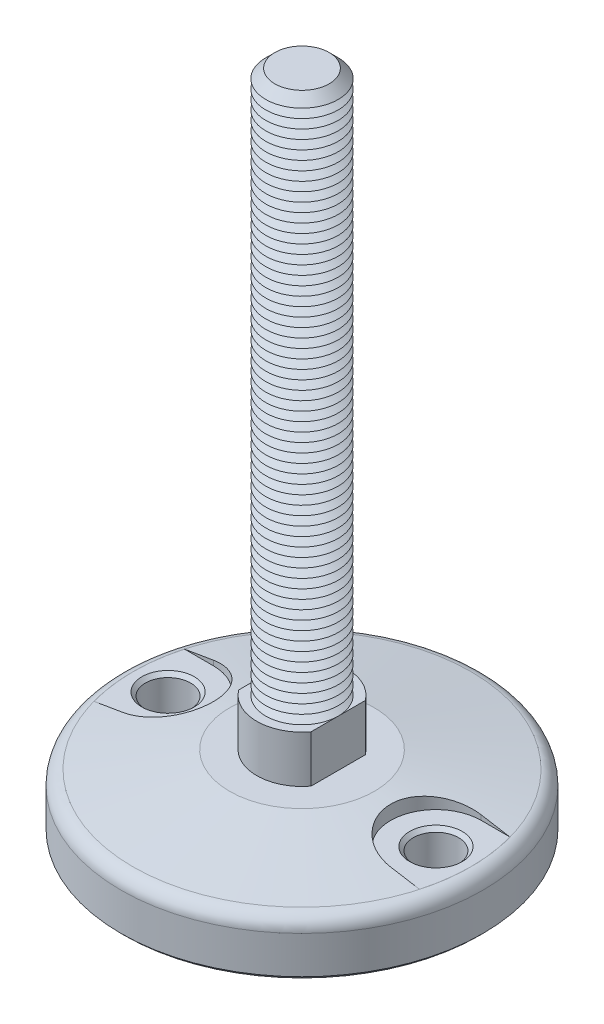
ISO-10303-21;
HEADER;
FILE_DESCRIPTION(('STEP AP214'),'2;1');
FILE_NAME('part.step','',(''),(''),'','','');
FILE_SCHEMA(('AUTOMOTIVE_DESIGN { 1 0 10303 214 1 1 1 1 }'));
ENDSEC;
DATA;
#1=APPLICATION_CONTEXT('core data for automotive mechanical design processes');
#2=APPLICATION_PROTOCOL_DEFINITION('international standard','automotive_design',2000,#1);
#3=PRODUCT_CONTEXT('',#1,'mechanical');
#4=PRODUCT('Part','Part','',(#3));
#5=PRODUCT_RELATED_PRODUCT_CATEGORY('part','',(#4));
#6=PRODUCT_DEFINITION_FORMATION('','',#4);
#7=PRODUCT_DEFINITION_CONTEXT('part definition',#1,'design');
#8=PRODUCT_DEFINITION('design','',#6,#7);
#9=PRODUCT_DEFINITION_SHAPE('','',#8);
#10=(LENGTH_UNIT() NAMED_UNIT(*) SI_UNIT(.MILLI.,.METRE.));
#11=(NAMED_UNIT(*) PLANE_ANGLE_UNIT() SI_UNIT($,.RADIAN.));
#12=(NAMED_UNIT(*) SI_UNIT($,.STERADIAN.) SOLID_ANGLE_UNIT());
#13=UNCERTAINTY_MEASURE_WITH_UNIT(LENGTH_MEASURE(1.E-05),#10,'distance_accuracy_value','');
#14=(GEOMETRIC_REPRESENTATION_CONTEXT(3) GLOBAL_UNCERTAINTY_ASSIGNED_CONTEXT((#13)) GLOBAL_UNIT_ASSIGNED_CONTEXT((#10,
#11,#12)) REPRESENTATION_CONTEXT('',''));
#15=CARTESIAN_POINT('',(0.,0.,0.));
#16=DIRECTION('',(0.,0.,1.));
#17=DIRECTION('',(1.,0.,0.));
#18=AXIS2_PLACEMENT_3D('',#15,#16,#17);
#19=CARTESIAN_POINT('',(0.,0.,0.));
#20=DIRECTION('',(0.,-1.,0.));
#21=DIRECTION('',(0.,0.,-1.));
#22=AXIS2_PLACEMENT_3D('',#19,#20,#21);
#23=CONICAL_SURFACE('',#22,20.,1.39626340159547);
#24=CARTESIAN_POINT('',(-37.0002,-3.35984690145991,12.4999999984));
#25=CARTESIAN_POINT('',(-36.6430801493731,-3.30019612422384,12.5000422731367));
#26=CARTESIAN_POINT('',(-36.286097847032,-3.23978096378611,12.4847089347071));
#27=CARTESIAN_POINT('',(-35.5749710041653,-3.11777545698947,12.423622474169));
#28=CARTESIAN_POINT('',(-35.2208262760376,-3.05618518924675,12.3778713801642));
#29=CARTESIAN_POINT('',(-34.5181114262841,-2.93221424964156,12.2563192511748));
#30=CARTESIAN_POINT('',(-34.1695379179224,-2.8698341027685,12.1805372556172));
#31=CARTESIAN_POINT('',(-33.4802130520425,-2.74463484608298,11.9995028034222));
#32=CARTESIAN_POINT('',(-33.1394616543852,-2.6818157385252,11.8942504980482));
#33=CARTESIAN_POINT('',(-32.4680688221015,-2.55613846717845,11.6549842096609));
#34=CARTESIAN_POINT('',(-32.1374312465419,-2.49328029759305,11.520959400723));
#35=CARTESIAN_POINT('',(-31.4887465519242,-2.36801465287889,11.2251130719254));
#36=CARTESIAN_POINT('',(-31.1706994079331,-2.30560717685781,11.063291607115));
#37=CARTESIAN_POINT('',(-30.54950311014,-2.18176290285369,10.7129930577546));
#38=CARTESIAN_POINT('',(-30.2463517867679,-2.12032596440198,10.524519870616));
#39=CARTESIAN_POINT('',(-29.6570687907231,-1.99897375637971,10.1221856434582));
#40=CARTESIAN_POINT('',(-29.3709370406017,-1.93905847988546,9.90832471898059));
#41=CARTESIAN_POINT('',(-28.8178459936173,-1.82137928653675,9.45673190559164));
#42=CARTESIAN_POINT('',(-28.5508809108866,-1.76361472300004,9.21900727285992));
#43=CARTESIAN_POINT('',(-28.0379874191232,-1.65088194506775,8.72124060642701));
#44=CARTESIAN_POINT('',(-27.7920590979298,-1.5959137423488,8.46119847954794));
#45=CARTESIAN_POINT('',(-27.323055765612,-1.48948182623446,7.9205326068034));
#46=CARTESIAN_POINT('',(-27.0999836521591,-1.43801855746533,7.63990625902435));
#47=CARTESIAN_POINT('',(-26.6784495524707,-1.33936166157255,7.06003375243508));
#48=CARTESIAN_POINT('',(-26.4799872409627,-1.29216797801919,6.76078783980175));
#49=CARTESIAN_POINT('',(-26.1117166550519,-1.20342811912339,6.14986205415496));
#50=CARTESIAN_POINT('',(-25.94156246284,-1.16181519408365,5.83840042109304));
#51=CARTESIAN_POINT('',(-25.628116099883,-1.08426427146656,5.20155792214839));
#52=CARTESIAN_POINT('',(-25.484823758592,-1.04832623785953,4.87617714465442));
#53=CARTESIAN_POINT('',(-25.2263277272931,-0.982857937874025,4.21390178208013));
#54=CARTESIAN_POINT('',(-25.1111175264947,-0.953326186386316,3.87700988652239));
#55=CARTESIAN_POINT('',(-24.9097439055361,-0.901314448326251,3.19412252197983));
#56=CARTESIAN_POINT('',(-24.8235797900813,-0.878834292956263,2.84812727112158));
#57=CARTESIAN_POINT('',(-24.6830159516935,-0.841972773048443,2.15919160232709));
#58=CARTESIAN_POINT('',(-24.6278129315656,-0.827386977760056,1.8164258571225));
#59=CARTESIAN_POINT('',(-24.5460973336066,-0.805742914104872,1.12725695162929));
#60=CARTESIAN_POINT('',(-24.5195842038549,-0.798684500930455,0.78085386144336));
#61=CARTESIAN_POINT('',(-24.4954839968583,-0.792269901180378,0.0870072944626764));
#62=CARTESIAN_POINT('',(-24.4978939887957,-0.79291293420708,-0.260436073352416));
#63=CARTESIAN_POINT('',(-24.5316115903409,-0.801883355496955,-0.953816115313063));
#64=CARTESIAN_POINT('',(-24.5629189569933,-0.810210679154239,-1.29975280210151));
#65=CARTESIAN_POINT('',(-24.6532283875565,-0.834099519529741,-1.98059726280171));
#66=CARTESIAN_POINT('',(-24.7116571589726,-0.849511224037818,-2.31558655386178));
#67=CARTESIAN_POINT('',(-24.8554972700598,-0.887161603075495,-2.97932206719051));
#68=CARTESIAN_POINT('',(-24.9409081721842,-0.909400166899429,-3.30806839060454));
#69=CARTESIAN_POINT('',(-25.1380243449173,-0.96022687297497,-3.95709027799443));
#70=CARTESIAN_POINT('',(-25.2497309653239,-0.988815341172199,-4.27736540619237));
#71=CARTESIAN_POINT('',(-25.498560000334,-1.05177019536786,-4.90729718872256));
#72=CARTESIAN_POINT('',(-25.6356828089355,-1.08613667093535,-5.21695367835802));
#73=CARTESIAN_POINT('',(-25.9361124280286,-1.16046648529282,-5.82730491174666));
#74=CARTESIAN_POINT('',(-26.0997157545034,-1.20049246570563,-6.12784605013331));
#75=CARTESIAN_POINT('',(-26.4506699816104,-1.28514282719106,-6.71404041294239));
#76=CARTESIAN_POINT('',(-26.6380209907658,-1.32976722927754,-6.99969356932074));
#77=CARTESIAN_POINT('',(-27.0351260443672,-1.42294054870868,-7.55431098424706));
#78=CARTESIAN_POINT('',(-27.2448809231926,-1.47148961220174,-7.82327462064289));
#79=CARTESIAN_POINT('',(-27.6853233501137,-1.57185653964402,-8.34282852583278));
#80=CARTESIAN_POINT('',(-27.9160114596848,-1.62367449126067,-8.59341830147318));
#81=CARTESIAN_POINT('',(-28.4034930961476,-1.73144835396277,-9.08142742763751));
#82=CARTESIAN_POINT('',(-28.660837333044,-1.78747956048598,-9.31828026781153));
#83=CARTESIAN_POINT('',(-29.1941741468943,-1.90170822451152,-9.7693949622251));
#84=CARTESIAN_POINT('',(-29.4701671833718,-1.95990573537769,-9.9836562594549));
#85=CARTESIAN_POINT('',(-30.0390002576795,-2.07790752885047,-10.3882796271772));
#86=CARTESIAN_POINT('',(-30.3318471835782,-2.1377124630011,-10.5786318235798));
#87=CARTESIAN_POINT('',(-30.9322646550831,-2.25836853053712,-10.9340888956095));
#88=CARTESIAN_POINT('',(-31.2398348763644,-2.31921964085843,-11.0991943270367));
#89=CARTESIAN_POINT('',(-31.8736774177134,-2.44266131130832,-11.4060146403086));
#90=CARTESIAN_POINT('',(-32.2001962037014,-2.50526276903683,-11.5472162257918));
#91=CARTESIAN_POINT('',(-32.8640586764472,-2.63057186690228,-11.8012839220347));
#92=CARTESIAN_POINT('',(-33.2014023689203,-2.69327950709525,-11.9141500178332));
#93=CARTESIAN_POINT('',(-33.8840988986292,-2.81828940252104,-12.1106227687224));
#94=CARTESIAN_POINT('',(-34.2294411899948,-2.88059206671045,-12.1942658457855));
#95=CARTESIAN_POINT('',(-34.9259788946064,-3.00445494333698,-12.3318436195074));
#96=CARTESIAN_POINT('',(-35.2771713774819,-3.06601550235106,-12.3857927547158));
#97=CARTESIAN_POINT('',(-35.8576122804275,-3.16637163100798,-12.4497947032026));
#98=CARTESIAN_POINT('',(-36.0858729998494,-3.20548751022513,-12.468632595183));
#99=CARTESIAN_POINT('',(-36.5427974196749,-3.2831194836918,-12.4937281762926));
#100=CARTESIAN_POINT('',(-36.7714598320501,-3.32163646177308,-12.5000065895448));
#101=CARTESIAN_POINT('',(-37.0002,-3.35984690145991,-12.4999999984));
#102=B_SPLINE_CURVE_WITH_KNOTS('',3,(#24,#25,#26,#27,#28,#29,#30,#31,#32,#33,#34,#35,#36,#37,
#38,#39,#40,#41,#42,#43,#44,#45,#46,#47,#48,#49,#50,#51,#52,#53,#54,#55,#56,#57,#58,#59,#60,#61,
#62,#63,#64,#65,#66,#67,#68,#69,#70,#71,#72,#73,#74,#75,#76,#77,#78,#79,#80,#81,#82,#83,#84,#85,
#86,#87,#88,#89,#90,#91,#92,#93,#94,#95,#96,#97,#98,#99,#100,#101),.UNSPECIFIED.,.F.,.F.,(4,2,2,
2,2,2,2,2,2,2,2,2,2,2,2,2,2,2,2,2,2,2,2,2,2,2,2,2,2,2,2,2,2,2,2,2,2,2,4),(0.,1.08586245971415,
2.171652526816,3.25675530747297,4.34185251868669,5.42735872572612,6.51286278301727,
7.59820826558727,8.68354880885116,9.76856032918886,10.853576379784,11.9387298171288,
13.0238689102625,14.0945791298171,15.1652825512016,16.2357374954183,17.3061668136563,
18.3473597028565,19.3885325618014,20.4295999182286,21.4706585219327,22.4906487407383,
23.5106224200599,24.5306484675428,25.5506903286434,26.5830642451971,27.6154428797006,
28.6478599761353,29.680304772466,30.7417064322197,31.8031342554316,32.8649990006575,
33.9268403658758,35.0091880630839,36.0915363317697,37.1725307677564,38.2529991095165,
38.9497417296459,39.6453337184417),.UNSPECIFIED.);
#103=CARTESIAN_POINT('',(-37.,-3.35981349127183,12.5));
#104=VERTEX_POINT('',#103);
#105=CARTESIAN_POINT('',(-37.,-3.35981349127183,-12.5));
#106=VERTEX_POINT('',#105);
#107=EDGE_CURVE('E740',#104,#106,#102,.T.);
#108=ORIENTED_EDGE('',*,*,#107,.F.);
#109=CARTESIAN_POINT('',(-61.7266967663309,-7.57847020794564,12.5));
#110=CARTESIAN_POINT('',(-60.2351929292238,-7.320720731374,12.5));
#111=CARTESIAN_POINT('',(-58.7436306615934,-7.06330856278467,12.5));
#112=CARTESIAN_POINT('',(-55.7603527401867,-6.54937673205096,12.5));
#113=CARTESIAN_POINT('',(-54.2686370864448,-6.29285706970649,12.5));
#114=CARTESIAN_POINT('',(-51.2850284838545,-5.78093030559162,12.5));
#115=CARTESIAN_POINT('',(-49.7931355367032,-5.52552319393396,12.5));
#116=CARTESIAN_POINT('',(-46.8091047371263,-5.01613816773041,12.5));
#117=CARTESIAN_POINT('',(-45.3169668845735,-4.76216025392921,12.5));
#118=CARTESIAN_POINT('',(-42.3323589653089,-4.25607669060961,12.5));
#119=CARTESIAN_POINT('',(-40.8398888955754,-4.00397105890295,12.5));
#120=CARTESIAN_POINT('',(-37.8545274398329,-3.50227519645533,12.5));
#121=CARTESIAN_POINT('',(-36.3616360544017,-3.252684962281,12.5));
#122=CARTESIAN_POINT('',(-34.1218562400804,-2.88092207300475,12.5));
#123=CARTESIAN_POINT('',(-33.3751855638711,-2.7574375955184,12.5));
#124=CARTESIAN_POINT('',(-31.8816714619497,-2.51151914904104,12.5));
#125=CARTESIAN_POINT('',(-31.1348280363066,-2.38908517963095,12.5));
#126=CARTESIAN_POINT('',(-29.6409325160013,-2.14547417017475,12.5));
#127=CARTESIAN_POINT('',(-28.8938804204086,-2.024297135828,12.5));
#128=CARTESIAN_POINT('',(-27.3995261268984,-1.78348915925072,12.5));
#129=CARTESIAN_POINT('',(-26.6522239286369,-1.66385821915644,12.5));
#130=CARTESIAN_POINT('',(-25.9047753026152,-1.54514479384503,12.5));
#131=B_SPLINE_CURVE_WITH_KNOTS('',3,(#109,#110,#111,#112,#113,#114,#115,#116,#117,#118,#119,
#120,#121,#122,#123,#124,#125,#126,#127,#128,#129,#130),.UNSPECIFIED.,.F.,.F.,(4,2,2,2,2,2,2,2,
2,2,4),(0.,4.54083339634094,9.08166577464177,13.6224577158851,18.1632520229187,22.7040894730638,
27.2449207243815,29.5153583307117,31.7857950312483,34.0562420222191,36.3266921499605),.UNSPECIFIED.);
#132=CARTESIAN_POINT('',(-44.9493194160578,-4.7,12.5));
#133=VERTEX_POINT('',#132);
#134=EDGE_CURVE('E714',#133,#104,#131,.T.);
#135=ORIENTED_EDGE('',*,*,#134,.F.);
#136=CARTESIAN_POINT('',(0.,-4.7,0.));
#137=DIRECTION('',(0.,1.,0.));
#138=DIRECTION('',(0.,0.,1.));
#139=AXIS2_PLACEMENT_3D('',#136,#137,#138);
#140=CIRCLE('',#139,46.6550245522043);
#141=CARTESIAN_POINT('',(-44.9493194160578,-4.7,-12.5));
#142=VERTEX_POINT('',#141);
#143=EDGE_CURVE('E702',#133,#142,#140,.F.);
#144=ORIENTED_EDGE('',*,*,#143,.T.);
#145=CARTESIAN_POINT('',(-25.9047753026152,-1.54514479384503,-12.5));
#146=CARTESIAN_POINT('',(-26.6522239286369,-1.66385821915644,-12.5));
#147=CARTESIAN_POINT('',(-27.3995261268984,-1.78348915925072,-12.5));
#148=CARTESIAN_POINT('',(-28.8938804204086,-2.024297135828,-12.5));
#149=CARTESIAN_POINT('',(-29.6409325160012,-2.14547417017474,-12.5));
#150=CARTESIAN_POINT('',(-31.1348280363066,-2.38908517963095,-12.5));
#151=CARTESIAN_POINT('',(-31.8816714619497,-2.51151914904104,-12.5));
#152=CARTESIAN_POINT('',(-33.3751855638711,-2.7574375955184,-12.5));
#153=CARTESIAN_POINT('',(-34.1218562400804,-2.88092207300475,-12.5));
#154=CARTESIAN_POINT('',(-36.3616360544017,-3.252684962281,-12.5));
#155=CARTESIAN_POINT('',(-37.8545274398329,-3.50227519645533,-12.5));
#156=CARTESIAN_POINT('',(-40.8398888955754,-4.00397105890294,-12.5));
#157=CARTESIAN_POINT('',(-42.3323589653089,-4.2560766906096,-12.5));
#158=CARTESIAN_POINT('',(-45.3169668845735,-4.7621602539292,-12.5));
#159=CARTESIAN_POINT('',(-46.8091047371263,-5.01613816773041,-12.5));
#160=CARTESIAN_POINT('',(-49.7931355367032,-5.52552319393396,-12.5));
#161=CARTESIAN_POINT('',(-51.2850284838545,-5.78093030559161,-12.5));
#162=CARTESIAN_POINT('',(-54.2686370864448,-6.29285706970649,-12.5));
#163=CARTESIAN_POINT('',(-55.7603527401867,-6.54937673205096,-12.5));
#164=CARTESIAN_POINT('',(-58.7436306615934,-7.06330856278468,-12.5));
#165=CARTESIAN_POINT('',(-60.2351929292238,-7.320720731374,-12.5));
#166=CARTESIAN_POINT('',(-61.7266967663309,-7.57847020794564,-12.5));
#167=B_SPLINE_CURVE_WITH_KNOTS('',3,(#145,#146,#147,#148,#149,#150,#151,#152,#153,#154,#155,
#156,#157,#158,#159,#160,#161,#162,#163,#164,#165,#166),.UNSPECIFIED.,.F.,.F.,(4,2,2,2,2,2,2,2,
2,2,4),(0.,2.27045012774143,4.54089711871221,6.81133381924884,9.08177142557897,13.6226026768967,
18.1634401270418,22.7042344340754,27.2450263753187,31.7858587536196,36.3266921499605),.UNSPECIFIED.);
#168=EDGE_CURVE('E706',#106,#142,#167,.T.);
#169=ORIENTED_EDGE('',*,*,#168,.F.);
#170=EDGE_LOOP('',(#108,#135,#144,#169));
#171=FACE_BOUND('',#170,.T.);
#172=CARTESIAN_POINT('',(0.,-4.70697693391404,0.));
#173=DIRECTION('',(0.,1.,0.));
#174=DIRECTION('',(0.,0.,1.));
#175=AXIS2_PLACEMENT_3D('',#172,#173,#174);
#176=CIRCLE('',#175,46.6945927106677);
#177=CARTESIAN_POINT('',(0.,-4.70697693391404,46.6945927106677));
#178=VERTEX_POINT('',#177);
#179=EDGE_CURVE('E692',#178,#178,#176,.T.);
#180=ORIENTED_EDGE('',*,*,#179,.T.);
#181=EDGE_LOOP('',(#180));
#182=FACE_BOUND('',#181,.T.);
#183=CARTESIAN_POINT('',(0.,0.,0.));
#184=DIRECTION('',(0.,1.,0.));
#185=DIRECTION('',(0.,0.,1.));
#186=AXIS2_PLACEMENT_3D('',#183,#184,#185);
#187=CIRCLE('',#186,20.);
#188=CARTESIAN_POINT('',(0.,0.,20.));
#189=VERTEX_POINT('',#188);
#190=EDGE_CURVE('E688',#189,#189,#187,.T.);
#191=ORIENTED_EDGE('',*,*,#190,.F.);
#192=EDGE_LOOP('',(#191));
#193=FACE_BOUND('',#192,.T.);
#194=CARTESIAN_POINT('',(55.9042883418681,-6.57430258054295,12.5));
#195=CARTESIAN_POINT('',(54.412585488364,-6.31763127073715,12.5));
#196=CARTESIAN_POINT('',(52.9208062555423,-6.06140219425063,12.5));
#197=CARTESIAN_POINT('',(49.9370413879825,-5.55015786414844,12.5));
#198=CARTESIAN_POINT('',(48.4450557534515,-5.29514260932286,12.5));
#199=CARTESIAN_POINT('',(45.4608530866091,-4.78666015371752,12.5));
#200=CARTESIAN_POINT('',(43.9686360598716,-4.53319292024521,12.5));
#201=CARTESIAN_POINT('',(40.9838536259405,-4.02830138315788,12.5));
#202=CARTESIAN_POINT('',(39.4912882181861,-3.7768770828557,12.5));
#203=CARTESIAN_POINT('',(36.50565536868,-3.27679220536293,12.5));
#204=CARTESIAN_POINT('',(35.0125879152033,-3.02813169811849,12.5));
#205=CARTESIAN_POINT('',(32.0258195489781,-2.53467103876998,12.5));
#206=CARTESIAN_POINT('',(30.5321186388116,-2.28987087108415,12.5));
#207=CARTESIAN_POINT('',(28.290865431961,-1.92688841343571,12.5));
#208=CARTESIAN_POINT('',(27.5436550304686,-1.80659579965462,12.5));
#209=CARTESIAN_POINT('',(26.0489572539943,-1.56774876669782,12.5));
#210=CARTESIAN_POINT('',(25.3014698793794,-1.44919434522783,12.5));
#211=CARTESIAN_POINT('',(23.8061486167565,-1.21422016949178,12.5));
#212=CARTESIAN_POINT('',(23.0583147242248,-1.09780044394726,12.5));
#213=CARTESIAN_POINT('',(21.5622260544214,-0.867676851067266,12.5));
#214=CARTESIAN_POINT('',(20.8139712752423,-0.753972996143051,12.5));
#215=CARTESIAN_POINT('',(20.0654672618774,-0.641917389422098,12.5));
#216=B_SPLINE_CURVE_WITH_KNOTS('',3,(#194,#195,#196,#197,#198,#199,#200,#201,#202,#203,#204,
#205,#206,#207,#208,#209,#210,#211,#212,#213,#214,#215),.UNSPECIFIED.,.F.,.F.,(4,2,2,2,2,2,2,2,
2,2,4),(0.,4.54087231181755,9.08174009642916,13.6225116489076,18.1632905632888,22.7041841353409,
27.2450593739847,29.515551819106,31.7860412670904,34.0565612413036,36.3270915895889),.UNSPECIFIED.);
#217=CARTESIAN_POINT('',(44.9493194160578,-4.7,12.5));
#218=VERTEX_POINT('',#217);
#219=CARTESIAN_POINT('',(37.,-3.35981349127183,12.5));
#220=VERTEX_POINT('',#219);
#221=EDGE_CURVE('E127',#218,#220,#216,.T.);
#222=ORIENTED_EDGE('',*,*,#221,.T.);
#223=CARTESIAN_POINT('',(37.0002,-3.35984690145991,12.4999999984));
#224=CARTESIAN_POINT('',(36.6430801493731,-3.30019612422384,12.5000422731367));
#225=CARTESIAN_POINT('',(36.286097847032,-3.23978096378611,12.4847089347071));
#226=CARTESIAN_POINT('',(35.5749710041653,-3.11777545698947,12.423622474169));
#227=CARTESIAN_POINT('',(35.2208262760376,-3.05618518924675,12.3778713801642));
#228=CARTESIAN_POINT('',(34.5181114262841,-2.93221424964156,12.2563192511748));
#229=CARTESIAN_POINT('',(34.1695379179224,-2.8698341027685,12.1805372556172));
#230=CARTESIAN_POINT('',(33.4802130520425,-2.74463484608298,11.9995028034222));
#231=CARTESIAN_POINT('',(33.1394616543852,-2.6818157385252,11.8942504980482));
#232=CARTESIAN_POINT('',(32.4680688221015,-2.55613846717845,11.6549842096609));
#233=CARTESIAN_POINT('',(32.1374312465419,-2.49328029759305,11.520959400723));
#234=CARTESIAN_POINT('',(31.4887465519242,-2.36801465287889,11.2251130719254));
#235=CARTESIAN_POINT('',(31.1706994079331,-2.30560717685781,11.063291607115));
#236=CARTESIAN_POINT('',(30.54950311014,-2.18176290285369,10.7129930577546));
#237=CARTESIAN_POINT('',(30.2463517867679,-2.12032596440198,10.524519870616));
#238=CARTESIAN_POINT('',(29.6570687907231,-1.99897375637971,10.1221856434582));
#239=CARTESIAN_POINT('',(29.3709370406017,-1.93905847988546,9.90832471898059));
#240=CARTESIAN_POINT('',(28.8178459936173,-1.82137928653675,9.45673190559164));
#241=CARTESIAN_POINT('',(28.5508809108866,-1.76361472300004,9.21900727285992));
#242=CARTESIAN_POINT('',(28.0379874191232,-1.65088194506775,8.72124060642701));
#243=CARTESIAN_POINT('',(27.7920590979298,-1.5959137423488,8.46119847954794));
#244=CARTESIAN_POINT('',(27.323055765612,-1.48948182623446,7.9205326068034));
#245=CARTESIAN_POINT('',(27.0999836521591,-1.43801855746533,7.63990625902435));
#246=CARTESIAN_POINT('',(26.6784495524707,-1.33936166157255,7.06003375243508));
#247=CARTESIAN_POINT('',(26.4799872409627,-1.29216797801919,6.76078783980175));
#248=CARTESIAN_POINT('',(26.1117166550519,-1.20342811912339,6.14986205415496));
#249=CARTESIAN_POINT('',(25.94156246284,-1.16181519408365,5.83840042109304));
#250=CARTESIAN_POINT('',(25.628116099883,-1.08426427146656,5.20155792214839));
#251=CARTESIAN_POINT('',(25.484823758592,-1.04832623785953,4.87617714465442));
#252=CARTESIAN_POINT('',(25.2263277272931,-0.982857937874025,4.21390178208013));
#253=CARTESIAN_POINT('',(25.1111175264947,-0.953326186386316,3.87700988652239));
#254=CARTESIAN_POINT('',(24.9097439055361,-0.901314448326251,3.19412252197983));
#255=CARTESIAN_POINT('',(24.8235797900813,-0.878834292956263,2.84812727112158));
#256=CARTESIAN_POINT('',(24.6830159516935,-0.841972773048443,2.15919160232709));
#257=CARTESIAN_POINT('',(24.6278129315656,-0.827386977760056,1.8164258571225));
#258=CARTESIAN_POINT('',(24.5460973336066,-0.805742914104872,1.12725695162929));
#259=CARTESIAN_POINT('',(24.5195842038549,-0.798684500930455,0.78085386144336));
#260=CARTESIAN_POINT('',(24.4954839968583,-0.792269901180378,0.0870072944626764));
#261=CARTESIAN_POINT('',(24.4978939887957,-0.79291293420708,-0.260436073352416));
#262=CARTESIAN_POINT('',(24.5316115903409,-0.801883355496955,-0.953816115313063));
#263=CARTESIAN_POINT('',(24.5629189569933,-0.810210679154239,-1.29975280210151));
#264=CARTESIAN_POINT('',(24.6532283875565,-0.834099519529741,-1.98059726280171));
#265=CARTESIAN_POINT('',(24.7116571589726,-0.849511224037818,-2.31558655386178));
#266=CARTESIAN_POINT('',(24.8554972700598,-0.887161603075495,-2.97932206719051));
#267=CARTESIAN_POINT('',(24.9409081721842,-0.909400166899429,-3.30806839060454));
#268=CARTESIAN_POINT('',(25.1380243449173,-0.96022687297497,-3.95709027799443));
#269=CARTESIAN_POINT('',(25.2497309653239,-0.988815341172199,-4.27736540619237));
#270=CARTESIAN_POINT('',(25.498560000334,-1.05177019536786,-4.90729718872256));
#271=CARTESIAN_POINT('',(25.6356828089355,-1.08613667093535,-5.21695367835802));
#272=CARTESIAN_POINT('',(25.9361124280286,-1.16046648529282,-5.82730491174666));
#273=CARTESIAN_POINT('',(26.0997157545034,-1.20049246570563,-6.12784605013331));
#274=CARTESIAN_POINT('',(26.4506699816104,-1.28514282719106,-6.71404041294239));
#275=CARTESIAN_POINT('',(26.6380209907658,-1.32976722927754,-6.99969356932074));
#276=CARTESIAN_POINT('',(27.0351260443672,-1.42294054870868,-7.55431098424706));
#277=CARTESIAN_POINT('',(27.2448809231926,-1.47148961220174,-7.82327462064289));
#278=CARTESIAN_POINT('',(27.6853233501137,-1.57185653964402,-8.34282852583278));
#279=CARTESIAN_POINT('',(27.9160114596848,-1.62367449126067,-8.59341830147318));
#280=CARTESIAN_POINT('',(28.4034930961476,-1.73144835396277,-9.08142742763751));
#281=CARTESIAN_POINT('',(28.660837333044,-1.78747956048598,-9.31828026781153));
#282=CARTESIAN_POINT('',(29.1941741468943,-1.90170822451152,-9.7693949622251));
#283=CARTESIAN_POINT('',(29.4701671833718,-1.95990573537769,-9.9836562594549));
#284=CARTESIAN_POINT('',(30.0390002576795,-2.07790752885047,-10.3882796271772));
#285=CARTESIAN_POINT('',(30.3318471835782,-2.1377124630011,-10.5786318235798));
#286=CARTESIAN_POINT('',(30.9322646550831,-2.25836853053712,-10.9340888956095));
#287=CARTESIAN_POINT('',(31.2398348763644,-2.31921964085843,-11.0991943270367));
#288=CARTESIAN_POINT('',(31.8736774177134,-2.44266131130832,-11.4060146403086));
#289=CARTESIAN_POINT('',(32.2001962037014,-2.50526276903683,-11.5472162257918));
#290=CARTESIAN_POINT('',(32.8640586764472,-2.63057186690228,-11.8012839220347));
#291=CARTESIAN_POINT('',(33.2014023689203,-2.69327950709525,-11.9141500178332));
#292=CARTESIAN_POINT('',(33.8840988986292,-2.81828940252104,-12.1106227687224));
#293=CARTESIAN_POINT('',(34.2294411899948,-2.88059206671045,-12.1942658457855));
#294=CARTESIAN_POINT('',(34.9259788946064,-3.00445494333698,-12.3318436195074));
#295=CARTESIAN_POINT('',(35.2771713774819,-3.06601550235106,-12.3857927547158));
#296=CARTESIAN_POINT('',(35.8576122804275,-3.16637163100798,-12.4497947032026));
#297=CARTESIAN_POINT('',(36.0858729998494,-3.20548751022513,-12.468632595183));
#298=CARTESIAN_POINT('',(36.5427974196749,-3.2831194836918,-12.4937281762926));
#299=CARTESIAN_POINT('',(36.7714598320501,-3.32163646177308,-12.5000065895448));
#300=CARTESIAN_POINT('',(37.0002,-3.35984690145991,-12.4999999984));
#301=B_SPLINE_CURVE_WITH_KNOTS('',3,(#223,#224,#225,#226,#227,#228,#229,#230,#231,#232,#233,
#234,#235,#236,#237,#238,#239,#240,#241,#242,#243,#244,#245,#246,#247,#248,#249,#250,#251,#252,
#253,#254,#255,#256,#257,#258,#259,#260,#261,#262,#263,#264,#265,#266,#267,#268,#269,#270,#271,
#272,#273,#274,#275,#276,#277,#278,#279,#280,#281,#282,#283,#284,#285,#286,#287,#288,#289,#290,
#291,#292,#293,#294,#295,#296,#297,#298,#299,#300),.UNSPECIFIED.,.F.,.F.,(4,2,2,2,2,2,2,2,2,2,2,
2,2,2,2,2,2,2,2,2,2,2,2,2,2,2,2,2,2,2,2,2,2,2,2,2,2,2,4),(0.,1.08586245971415,2.171652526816,
3.25675530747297,4.34185251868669,5.42735872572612,6.51286278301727,7.59820826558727,
8.68354880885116,9.76856032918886,10.853576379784,11.9387298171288,13.0238689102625,
14.0945791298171,15.1652825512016,16.2357374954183,17.3061668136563,18.3473597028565,
19.3885325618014,20.4295999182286,21.4706585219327,22.4906487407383,23.5106224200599,
24.5306484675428,25.5506903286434,26.5830642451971,27.6154428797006,28.6478599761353,
29.680304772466,30.7417064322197,31.8031342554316,32.8649990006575,33.9268403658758,
35.0091880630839,36.0915363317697,37.1725307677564,38.2529991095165,38.9497417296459,
39.6453337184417),.UNSPECIFIED.);
#302=CARTESIAN_POINT('',(37.,-3.35981349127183,-12.5));
#303=VERTEX_POINT('',#302);
#304=EDGE_CURVE('E139',#220,#303,#301,.T.);
#305=ORIENTED_EDGE('',*,*,#304,.T.);
#306=CARTESIAN_POINT('',(20.0654672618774,-0.641917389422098,-12.5));
#307=CARTESIAN_POINT('',(20.8139712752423,-0.753972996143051,-12.5));
#308=CARTESIAN_POINT('',(21.5622260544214,-0.867676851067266,-12.5));
#309=CARTESIAN_POINT('',(23.0583147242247,-1.09780044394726,-12.5));
#310=CARTESIAN_POINT('',(23.8061486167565,-1.21422016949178,-12.5));
#311=CARTESIAN_POINT('',(25.3014698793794,-1.44919434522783,-12.5));
#312=CARTESIAN_POINT('',(26.0489572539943,-1.56774876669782,-12.5));
#313=CARTESIAN_POINT('',(27.5436550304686,-1.80659579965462,-12.5));
#314=CARTESIAN_POINT('',(28.290865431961,-1.92688841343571,-12.5));
#315=CARTESIAN_POINT('',(30.5321186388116,-2.28987087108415,-12.5));
#316=CARTESIAN_POINT('',(32.0258195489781,-2.53467103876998,-12.5));
#317=CARTESIAN_POINT('',(35.0125879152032,-3.02813169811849,-12.5));
#318=CARTESIAN_POINT('',(36.50565536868,-3.27679220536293,-12.5));
#319=CARTESIAN_POINT('',(39.4912882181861,-3.7768770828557,-12.5));
#320=CARTESIAN_POINT('',(40.9838536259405,-4.02830138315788,-12.5));
#321=CARTESIAN_POINT('',(43.9686360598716,-4.53319292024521,-12.5));
#322=CARTESIAN_POINT('',(45.4608530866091,-4.78666015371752,-12.5));
#323=CARTESIAN_POINT('',(48.4450557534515,-5.29514260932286,-12.5));
#324=CARTESIAN_POINT('',(49.9370413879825,-5.55015786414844,-12.5));
#325=CARTESIAN_POINT('',(52.9208062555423,-6.06140219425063,-12.5));
#326=CARTESIAN_POINT('',(54.412585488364,-6.31763127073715,-12.5));
#327=CARTESIAN_POINT('',(55.9042883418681,-6.57430258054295,-12.5));
#328=B_SPLINE_CURVE_WITH_KNOTS('',3,(#306,#307,#308,#309,#310,#311,#312,#313,#314,#315,#316,
#317,#318,#319,#320,#321,#322,#323,#324,#325,#326,#327),.UNSPECIFIED.,.F.,.F.,(4,2,2,2,2,2,2,2,
2,2,4),(0.,2.27053034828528,4.54105032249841,6.81153977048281,9.08203221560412,13.6229074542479,
18.1638010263,22.7045799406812,27.2453514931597,31.7862192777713,36.3270915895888),.UNSPECIFIED.);
#329=CARTESIAN_POINT('',(44.9493194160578,-4.7,-12.5));
#330=VERTEX_POINT('',#329);
#331=EDGE_CURVE('E771',#303,#330,#328,.T.);
#332=ORIENTED_EDGE('',*,*,#331,.T.);
#333=CARTESIAN_POINT('',(0.,-4.7,0.));
#334=DIRECTION('',(0.,1.,0.));
#335=DIRECTION('',(0.,0.,1.));
#336=AXIS2_PLACEMENT_3D('',#333,#334,#335);
#337=CIRCLE('',#336,46.6550245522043);
#338=EDGE_CURVE('E762',#330,#218,#337,.F.);
#339=ORIENTED_EDGE('',*,*,#338,.T.);
#340=EDGE_LOOP('',(#222,#305,#332,#339));
#341=FACE_BOUND('',#340,.T.);
#342=ADVANCED_FACE('F39',(#171,#182,#193,#341),#23,.T.);
#343=CARTESIAN_POINT('',(0.,13.,0.));
#344=DIRECTION('',(0.,1.,0.));
#345=DIRECTION('',(0.,0.,1.));
#346=AXIS2_PLACEMENT_3D('',#343,#344,#345);
#347=PLANE('',#346);
#348=CARTESIAN_POINT('',(0.,13.,0.));
#349=DIRECTION('',(0.,1.,0.));
#350=DIRECTION('',(0.,0.,1.));
#351=AXIS2_PLACEMENT_3D('',#348,#349,#350);
#352=CIRCLE('',#351,10.);
#353=CARTESIAN_POINT('',(10.,13.,0.));
#354=VERTEX_POINT('',#353);
#355=CARTESIAN_POINT('',(-10.,13.,0.));
#356=VERTEX_POINT('',#355);
#357=EDGE_CURVE('E641',#354,#356,#352,.T.);
#358=ORIENTED_EDGE('',*,*,#357,.F.);
#359=DIRECTION('',(0.,0.,1.));
#360=VECTOR('',#359,1.);
#361=CARTESIAN_POINT('',(10.,13.,7.5));
#362=LINE('',#361,#360);
#363=CARTESIAN_POINT('',(10.,13.,-7.5));
#364=VERTEX_POINT('',#363);
#365=EDGE_CURVE('E668',#364,#354,#362,.T.);
#366=ORIENTED_EDGE('',*,*,#365,.F.);
#367=CARTESIAN_POINT('',(0.,13.,0.));
#368=DIRECTION('',(0.,1.,0.));
#369=DIRECTION('',(0.,0.,1.));
#370=AXIS2_PLACEMENT_3D('',#367,#368,#369);
#371=CIRCLE('',#370,12.5);
#372=CARTESIAN_POINT('',(-10.,13.,-7.5));
#373=VERTEX_POINT('',#372);
#374=EDGE_CURVE('E681',#364,#373,#371,.T.);
#375=ORIENTED_EDGE('',*,*,#374,.T.);
#376=DIRECTION('',(0.,0.,-1.));
#377=VECTOR('',#376,1.);
#378=CARTESIAN_POINT('',(-10.,13.,-7.5));
#379=LINE('',#378,#377);
#380=EDGE_CURVE('E655',#356,#373,#379,.T.);
#381=ORIENTED_EDGE('',*,*,#380,.F.);
#382=EDGE_LOOP('',(#358,#366,#375,#381));
#383=FACE_BOUND('',#382,.T.);
#384=ADVANCED_FACE('F826',(#383),#347,.T.);
#385=CARTESIAN_POINT('',(0.,13.,0.));
#386=DIRECTION('',(0.,-1.,0.));
#387=DIRECTION('',(0.,0.,-1.));
#388=AXIS2_PLACEMENT_3D('',#385,#386,#387);
#389=CYLINDRICAL_SURFACE('',#388,12.5);
#390=CARTESIAN_POINT('',(-10.,13.,7.5));
#391=VERTEX_POINT('',#390);
#392=CARTESIAN_POINT('',(10.,13.,7.5));
#393=VERTEX_POINT('',#392);
#394=EDGE_CURVE('E660',#391,#393,#371,.T.);
#395=ORIENTED_EDGE('',*,*,#394,.F.);
#396=DIRECTION('',(0.,1.,0.));
#397=VECTOR('',#396,1.);
#398=CARTESIAN_POINT('',(-10.,0.,7.5));
#399=LINE('',#398,#397);
#400=CARTESIAN_POINT('',(-10.,0.,7.5));
#401=VERTEX_POINT('',#400);
#402=EDGE_CURVE('E650',#401,#391,#399,.T.);
#403=ORIENTED_EDGE('',*,*,#402,.F.);
#404=CARTESIAN_POINT('',(0.,0.,0.));
#405=DIRECTION('',(0.,1.,0.));
#406=DIRECTION('',(0.,0.,1.));
#407=AXIS2_PLACEMENT_3D('',#404,#405,#406);
#408=CIRCLE('',#407,12.5);
#409=CARTESIAN_POINT('',(10.,0.,7.5));
#410=VERTEX_POINT('',#409);
#411=EDGE_CURVE('E682',#401,#410,#408,.T.);
#412=ORIENTED_EDGE('',*,*,#411,.T.);
#413=DIRECTION('',(0.,1.,0.));
#414=VECTOR('',#413,1.);
#415=CARTESIAN_POINT('',(10.,0.,7.5));
#416=LINE('',#415,#414);
#417=EDGE_CURVE('E672',#410,#393,#416,.T.);
#418=ORIENTED_EDGE('',*,*,#417,.T.);
#419=EDGE_LOOP('',(#395,#403,#412,#418));
#420=FACE_BOUND('',#419,.T.);
#421=ADVANCED_FACE('F831',(#420),#389,.T.);
#422=CARTESIAN_POINT('',(0.,0.,0.));
#423=DIRECTION('',(0.,1.,0.));
#424=DIRECTION('',(0.,0.,1.));
#425=AXIS2_PLACEMENT_3D('',#422,#423,#424);
#426=PLANE('',#425);
#427=CARTESIAN_POINT('',(10.,0.,-7.5));
#428=VERTEX_POINT('',#427);
#429=CARTESIAN_POINT('',(-10.,0.,-7.5));
#430=VERTEX_POINT('',#429);
#431=EDGE_CURVE('E686',#428,#430,#408,.T.);
#432=ORIENTED_EDGE('',*,*,#431,.F.);
#433=DIRECTION('',(0.,0.,1.));
#434=VECTOR('',#433,1.);
#435=CARTESIAN_POINT('',(10.,0.,7.5));
#436=LINE('',#435,#434);
#437=EDGE_CURVE('E663',#428,#410,#436,.T.);
#438=ORIENTED_EDGE('',*,*,#437,.T.);
#439=ORIENTED_EDGE('',*,*,#411,.F.);
#440=DIRECTION('',(0.,0.,-1.));
#441=VECTOR('',#440,1.);
#442=CARTESIAN_POINT('',(-10.,0.,-7.5));
#443=LINE('',#442,#441);
#444=EDGE_CURVE('E646',#401,#430,#443,.T.);
#445=ORIENTED_EDGE('',*,*,#444,.T.);
#446=EDGE_LOOP('',(#432,#438,#439,#445));
#447=FACE_BOUND('',#446,.T.);
#448=ORIENTED_EDGE('',*,*,#190,.T.);
#449=EDGE_LOOP('',(#448));
#450=FACE_BOUND('',#449,.T.);
#451=ADVANCED_FACE('F932',(#447,#450),#426,.T.);
#452=CARTESIAN_POINT('',(0.,61.3388655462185,0.));
#453=DIRECTION('',(0.,1.,0.));
#454=DIRECTION('',(0.,0.,1.));
#455=AXIS2_PLACEMENT_3D('',#452,#453,#454);
#456=CYLINDRICAL_SURFACE('',#455,50.);
#457=CARTESIAN_POINT('',(0.,-19.,0.));
#458=DIRECTION('',(0.,-1.,0.));
#459=DIRECTION('',(0.,0.,-1.));
#460=AXIS2_PLACEMENT_3D('',#457,#458,#459);
#461=CIRCLE('',#460,50.);
#462=CARTESIAN_POINT('',(0.,-19.,-50.));
#463=VERTEX_POINT('',#462);
#464=EDGE_CURVE('E48',#463,#463,#461,.F.);
#465=ORIENTED_EDGE('',*,*,#464,.T.);
#466=EDGE_LOOP('',(#465));
#467=FACE_BOUND('',#466,.T.);
#468=CARTESIAN_POINT('',(0.,-8.64620794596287,0.));
#469=DIRECTION('',(0.,-1.,0.));
#470=DIRECTION('',(0.,0.,-1.));
#471=AXIS2_PLACEMENT_3D('',#468,#469,#470);
#472=CIRCLE('',#471,50.);
#473=CARTESIAN_POINT('',(0.,-8.64620794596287,-50.));
#474=VERTEX_POINT('',#473);
#475=EDGE_CURVE('E687',#474,#474,#472,.T.);
#476=ORIENTED_EDGE('',*,*,#475,.T.);
#477=EDGE_LOOP('',(#476));
#478=FACE_BOUND('',#477,.T.);
#479=ADVANCED_FACE('F813',(#467,#478),#456,.T.);
#480=CARTESIAN_POINT('',(0.,-20.,50.));
#481=DIRECTION('',(0.,-1.,0.));
#482=DIRECTION('',(0.,0.,-1.));
#483=AXIS2_PLACEMENT_3D('',#480,#481,#482);
#484=PLANE('',#483);
#485=CARTESIAN_POINT('',(0.,-20.,0.));
#486=DIRECTION('',(0.,-1.,0.));
#487=DIRECTION('',(0.,0.,-1.));
#488=AXIS2_PLACEMENT_3D('',#485,#486,#487);
#489=CIRCLE('',#488,49.);
#490=CARTESIAN_POINT('',(0.,-20.,-49.));
#491=VERTEX_POINT('',#490);
#492=EDGE_CURVE('E11',#491,#491,#489,.T.);
#493=ORIENTED_EDGE('',*,*,#492,.T.);
#494=EDGE_LOOP('',(#493));
#495=FACE_BOUND('',#494,.T.);
#496=CARTESIAN_POINT('',(37.,-20.,0.));
#497=DIRECTION('',(0.,-1.,0.));
#498=DIRECTION('',(0.,0.,-1.));
#499=AXIS2_PLACEMENT_3D('',#496,#497,#498);
#500=CIRCLE('',#499,7.25000000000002);
#501=CARTESIAN_POINT('',(37.,-20.,-7.25000000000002));
#502=VERTEX_POINT('',#501);
#503=EDGE_CURVE('E801',#502,#502,#500,.F.);
#504=ORIENTED_EDGE('',*,*,#503,.T.);
#505=EDGE_LOOP('',(#504));
#506=FACE_BOUND('',#505,.T.);
#507=CARTESIAN_POINT('',(-37.,-20.,0.));
#508=DIRECTION('',(0.,-1.,0.));
#509=DIRECTION('',(0.,0.,-1.));
#510=AXIS2_PLACEMENT_3D('',#507,#508,#509);
#511=CIRCLE('',#510,7.25000000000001);
#512=CARTESIAN_POINT('',(-37.,-20.,-7.25000000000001));
#513=VERTEX_POINT('',#512);
#514=EDGE_CURVE('E746',#513,#513,#511,.F.);
#515=ORIENTED_EDGE('',*,*,#514,.T.);
#516=EDGE_LOOP('',(#515));
#517=FACE_BOUND('',#516,.T.);
#518=ADVANCED_FACE('F916',(#495,#506,#517),#484,.T.);
#519=CARTESIAN_POINT('',(0.,-8.64620794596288,0.));
#520=DIRECTION('',(0.,-1.,0.));
#521=DIRECTION('',(0.,0.,-1.));
#522=AXIS2_PLACEMENT_3D('',#519,#520,#521);
#523=TOROIDAL_SURFACE('',#522,46.,4.);
#524=ORIENTED_EDGE('',*,*,#475,.F.);
#525=EDGE_LOOP('',(#524));
#526=FACE_BOUND('',#525,.T.);
#527=ORIENTED_EDGE('',*,*,#179,.F.);
#528=EDGE_LOOP('',(#527));
#529=FACE_BOUND('',#528,.T.);
#530=ADVANCED_FACE('F921',(#526,#529),#523,.T.);
#531=ORIENTED_EDGE('',*,*,#431,.T.);
#532=DIRECTION('',(0.,1.,0.));
#533=VECTOR('',#532,1.);
#534=CARTESIAN_POINT('',(-10.,0.,-7.5));
#535=LINE('',#534,#533);
#536=EDGE_CURVE('E656',#430,#373,#535,.T.);
#537=ORIENTED_EDGE('',*,*,#536,.T.);
#538=ORIENTED_EDGE('',*,*,#374,.F.);
#539=DIRECTION('',(0.,1.,0.));
#540=VECTOR('',#539,1.);
#541=CARTESIAN_POINT('',(10.,0.,-7.5));
#542=LINE('',#541,#540);
#543=EDGE_CURVE('E667',#428,#364,#542,.T.);
#544=ORIENTED_EDGE('',*,*,#543,.F.);
#545=EDGE_LOOP('',(#531,#537,#538,#544));
#546=FACE_BOUND('',#545,.T.);
#547=ADVANCED_FACE('F951',(#546),#389,.T.);
#548=EDGE_CURVE('E645',#356,#354,#352,.T.);
#549=ORIENTED_EDGE('',*,*,#548,.F.);
#550=EDGE_CURVE('E651',#391,#356,#379,.T.);
#551=ORIENTED_EDGE('',*,*,#550,.F.);
#552=ORIENTED_EDGE('',*,*,#394,.T.);
#553=EDGE_CURVE('E644',#354,#393,#362,.T.);
#554=ORIENTED_EDGE('',*,*,#553,.F.);
#555=EDGE_LOOP('',(#549,#551,#552,#554));
#556=FACE_BOUND('',#555,.T.);
#557=ADVANCED_FACE('F834',(#556),#347,.T.);
#558=CARTESIAN_POINT('',(10.,0.,7.5));
#559=DIRECTION('',(-1.,0.,0.));
#560=DIRECTION('',(0.,0.,1.));
#561=AXIS2_PLACEMENT_3D('',#558,#559,#560);
#562=PLANE('',#561);
#563=ORIENTED_EDGE('',*,*,#365,.T.);
#564=ORIENTED_EDGE('',*,*,#553,.T.);
#565=ORIENTED_EDGE('',*,*,#417,.F.);
#566=ORIENTED_EDGE('',*,*,#437,.F.);
#567=ORIENTED_EDGE('',*,*,#543,.T.);
#568=EDGE_LOOP('',(#563,#564,#565,#566,#567));
#569=FACE_BOUND('',#568,.T.);
#570=ADVANCED_FACE('F2110',(#569),#562,.F.);
#571=CARTESIAN_POINT('',(-10.,0.,-7.5));
#572=DIRECTION('',(1.,0.,0.));
#573=DIRECTION('',(0.,0.,-1.));
#574=AXIS2_PLACEMENT_3D('',#571,#572,#573);
#575=PLANE('',#574);
#576=ORIENTED_EDGE('',*,*,#550,.T.);
#577=ORIENTED_EDGE('',*,*,#380,.T.);
#578=ORIENTED_EDGE('',*,*,#536,.F.);
#579=ORIENTED_EDGE('',*,*,#444,.F.);
#580=ORIENTED_EDGE('',*,*,#402,.T.);
#581=EDGE_LOOP('',(#576,#577,#578,#579,#580));
#582=FACE_BOUND('',#581,.T.);
#583=ADVANCED_FACE('F2101',(#582),#575,.F.);
#584=CARTESIAN_POINT('',(0.,13.,0.));
#585=DIRECTION('',(0.,-1.,0.));
#586=DIRECTION('',(0.,0.,-1.));
#587=AXIS2_PLACEMENT_3D('',#584,#585,#586);
#588=CONICAL_SURFACE('',#587,10.,1.0471975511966);
#589=CARTESIAN_POINT('',(0.,14.25,0.));
#590=DIRECTION('',(0.,1.,0.));
#591=DIRECTION('',(0.,0.,1.));
#592=AXIS2_PLACEMENT_3D('',#589,#590,#591);
#593=CIRCLE('',#592,7.8349364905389);
#594=CARTESIAN_POINT('',(0.,14.25,7.8349364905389));
#595=VERTEX_POINT('',#594);
#596=EDGE_CURVE('E637',#595,#595,#593,.T.);
#597=ORIENTED_EDGE('',*,*,#596,.F.);
#598=EDGE_LOOP('',(#597));
#599=FACE_BOUND('',#598,.T.);
#600=ORIENTED_EDGE('',*,*,#357,.T.);
#601=ORIENTED_EDGE('',*,*,#548,.T.);
#602=EDGE_LOOP('',(#600,#601));
#603=FACE_BOUND('',#602,.T.);
#604=ADVANCED_FACE('F2092',(#599,#603),#588,.T.);
#605=CARTESIAN_POINT('',(0.,14.25,0.));
#606=DIRECTION('',(0.,1.,0.));
#607=DIRECTION('',(0.,0.,1.));
#608=AXIS2_PLACEMENT_3D('',#605,#606,#607);
#609=CONICAL_SURFACE('',#608,7.8349364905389,1.0471975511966);
#610=CARTESIAN_POINT('',(0.,15.5,0.));
#611=DIRECTION('',(0.,1.,0.));
#612=DIRECTION('',(0.,0.,1.));
#613=AXIS2_PLACEMENT_3D('',#610,#611,#612);
#614=CIRCLE('',#613,10.);
#615=CARTESIAN_POINT('',(0.,15.5,10.));
#616=VERTEX_POINT('',#615);
#617=EDGE_CURVE('E633',#616,#616,#614,.T.);
#618=ORIENTED_EDGE('',*,*,#617,.F.);
#619=EDGE_LOOP('',(#618));
#620=FACE_BOUND('',#619,.T.);
#621=ORIENTED_EDGE('',*,*,#596,.T.);
#622=EDGE_LOOP('',(#621));
#623=FACE_BOUND('',#622,.T.);
#624=ADVANCED_FACE('F2083',(#620,#623),#609,.T.);
#625=CARTESIAN_POINT('',(0.,15.5,0.));
#626=DIRECTION('',(0.,-1.,0.));
#627=DIRECTION('',(0.,0.,-1.));
#628=AXIS2_PLACEMENT_3D('',#625,#626,#627);
#629=CONICAL_SURFACE('',#628,10.,1.0471975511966);
#630=CARTESIAN_POINT('',(0.,16.75,0.));
#631=DIRECTION('',(0.,1.,0.));
#632=DIRECTION('',(0.,0.,1.));
#633=AXIS2_PLACEMENT_3D('',#630,#631,#632);
#634=CIRCLE('',#633,7.8349364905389);
#635=CARTESIAN_POINT('',(0.,16.75,7.8349364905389));
#636=VERTEX_POINT('',#635);
#637=EDGE_CURVE('E629',#636,#636,#634,.T.);
#638=ORIENTED_EDGE('',*,*,#637,.F.);
#639=EDGE_LOOP('',(#638));
#640=FACE_BOUND('',#639,.T.);
#641=ORIENTED_EDGE('',*,*,#617,.T.);
#642=EDGE_LOOP('',(#641));
#643=FACE_BOUND('',#642,.T.);
#644=ADVANCED_FACE('F2074',(#640,#643),#629,.T.);
#645=CARTESIAN_POINT('',(0.,16.75,0.));
#646=DIRECTION('',(0.,1.,0.));
#647=DIRECTION('',(0.,0.,1.));
#648=AXIS2_PLACEMENT_3D('',#645,#646,#647);
#649=CONICAL_SURFACE('',#648,7.8349364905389,1.0471975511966);
#650=CARTESIAN_POINT('',(0.,18.,0.));
#651=DIRECTION('',(0.,1.,0.));
#652=DIRECTION('',(0.,0.,1.));
#653=AXIS2_PLACEMENT_3D('',#650,#651,#652);
#654=CIRCLE('',#653,10.);
#655=CARTESIAN_POINT('',(0.,18.,10.));
#656=VERTEX_POINT('',#655);
#657=EDGE_CURVE('E625',#656,#656,#654,.T.);
#658=ORIENTED_EDGE('',*,*,#657,.F.);
#659=EDGE_LOOP('',(#658));
#660=FACE_BOUND('',#659,.T.);
#661=ORIENTED_EDGE('',*,*,#637,.T.);
#662=EDGE_LOOP('',(#661));
#663=FACE_BOUND('',#662,.T.);
#664=ADVANCED_FACE('F2065',(#660,#663),#649,.T.);
#665=CARTESIAN_POINT('',(0.,18.,0.));
#666=DIRECTION('',(0.,-1.,0.));
#667=DIRECTION('',(0.,0.,-1.));
#668=AXIS2_PLACEMENT_3D('',#665,#666,#667);
#669=CONICAL_SURFACE('',#668,10.,1.0471975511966);
#670=CARTESIAN_POINT('',(0.,19.25,0.));
#671=DIRECTION('',(0.,1.,0.));
#672=DIRECTION('',(0.,0.,1.));
#673=AXIS2_PLACEMENT_3D('',#670,#671,#672);
#674=CIRCLE('',#673,7.8349364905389);
#675=CARTESIAN_POINT('',(0.,19.25,7.8349364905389));
#676=VERTEX_POINT('',#675);
#677=EDGE_CURVE('E621',#676,#676,#674,.T.);
#678=ORIENTED_EDGE('',*,*,#677,.F.);
#679=EDGE_LOOP('',(#678));
#680=FACE_BOUND('',#679,.T.);
#681=ORIENTED_EDGE('',*,*,#657,.T.);
#682=EDGE_LOOP('',(#681));
#683=FACE_BOUND('',#682,.T.);
#684=ADVANCED_FACE('F2056',(#680,#683),#669,.T.);
#685=CARTESIAN_POINT('',(0.,19.25,0.));
#686=DIRECTION('',(0.,1.,0.));
#687=DIRECTION('',(0.,0.,1.));
#688=AXIS2_PLACEMENT_3D('',#685,#686,#687);
#689=CONICAL_SURFACE('',#688,7.8349364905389,1.0471975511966);
#690=CARTESIAN_POINT('',(0.,20.5,0.));
#691=DIRECTION('',(0.,1.,0.));
#692=DIRECTION('',(0.,0.,1.));
#693=AXIS2_PLACEMENT_3D('',#690,#691,#692);
#694=CIRCLE('',#693,10.);
#695=CARTESIAN_POINT('',(0.,20.5,10.));
#696=VERTEX_POINT('',#695);
#697=EDGE_CURVE('E617',#696,#696,#694,.T.);
#698=ORIENTED_EDGE('',*,*,#697,.F.);
#699=EDGE_LOOP('',(#698));
#700=FACE_BOUND('',#699,.T.);
#701=ORIENTED_EDGE('',*,*,#677,.T.);
#702=EDGE_LOOP('',(#701));
#703=FACE_BOUND('',#702,.T.);
#704=ADVANCED_FACE('F2047',(#700,#703),#689,.T.);
#705=CARTESIAN_POINT('',(0.,20.5,0.));
#706=DIRECTION('',(0.,-1.,0.));
#707=DIRECTION('',(0.,0.,-1.));
#708=AXIS2_PLACEMENT_3D('',#705,#706,#707);
#709=CONICAL_SURFACE('',#708,10.,1.0471975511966);
#710=CARTESIAN_POINT('',(0.,21.75,0.));
#711=DIRECTION('',(0.,1.,0.));
#712=DIRECTION('',(0.,0.,1.));
#713=AXIS2_PLACEMENT_3D('',#710,#711,#712);
#714=CIRCLE('',#713,7.8349364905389);
#715=CARTESIAN_POINT('',(0.,21.75,7.8349364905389));
#716=VERTEX_POINT('',#715);
#717=EDGE_CURVE('E613',#716,#716,#714,.T.);
#718=ORIENTED_EDGE('',*,*,#717,.F.);
#719=EDGE_LOOP('',(#718));
#720=FACE_BOUND('',#719,.T.);
#721=ORIENTED_EDGE('',*,*,#697,.T.);
#722=EDGE_LOOP('',(#721));
#723=FACE_BOUND('',#722,.T.);
#724=ADVANCED_FACE('F2038',(#720,#723),#709,.T.);
#725=CARTESIAN_POINT('',(0.,21.75,0.));
#726=DIRECTION('',(0.,1.,0.));
#727=DIRECTION('',(0.,0.,1.));
#728=AXIS2_PLACEMENT_3D('',#725,#726,#727);
#729=CONICAL_SURFACE('',#728,7.8349364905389,1.0471975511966);
#730=CARTESIAN_POINT('',(0.,23.,0.));
#731=DIRECTION('',(0.,1.,0.));
#732=DIRECTION('',(0.,0.,1.));
#733=AXIS2_PLACEMENT_3D('',#730,#731,#732);
#734=CIRCLE('',#733,10.);
#735=CARTESIAN_POINT('',(0.,23.,10.));
#736=VERTEX_POINT('',#735);
#737=EDGE_CURVE('E609',#736,#736,#734,.T.);
#738=ORIENTED_EDGE('',*,*,#737,.F.);
#739=EDGE_LOOP('',(#738));
#740=FACE_BOUND('',#739,.T.);
#741=ORIENTED_EDGE('',*,*,#717,.T.);
#742=EDGE_LOOP('',(#741));
#743=FACE_BOUND('',#742,.T.);
#744=ADVANCED_FACE('F2029',(#740,#743),#729,.T.);
#745=CARTESIAN_POINT('',(0.,23.,0.));
#746=DIRECTION('',(0.,-1.,0.));
#747=DIRECTION('',(0.,0.,-1.));
#748=AXIS2_PLACEMENT_3D('',#745,#746,#747);
#749=CONICAL_SURFACE('',#748,10.,1.0471975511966);
#750=CARTESIAN_POINT('',(0.,24.25,0.));
#751=DIRECTION('',(0.,1.,0.));
#752=DIRECTION('',(0.,0.,1.));
#753=AXIS2_PLACEMENT_3D('',#750,#751,#752);
#754=CIRCLE('',#753,7.8349364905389);
#755=CARTESIAN_POINT('',(0.,24.25,7.8349364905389));
#756=VERTEX_POINT('',#755);
#757=EDGE_CURVE('E605',#756,#756,#754,.T.);
#758=ORIENTED_EDGE('',*,*,#757,.F.);
#759=EDGE_LOOP('',(#758));
#760=FACE_BOUND('',#759,.T.);
#761=ORIENTED_EDGE('',*,*,#737,.T.);
#762=EDGE_LOOP('',(#761));
#763=FACE_BOUND('',#762,.T.);
#764=ADVANCED_FACE('F2020',(#760,#763),#749,.T.);
#765=CARTESIAN_POINT('',(0.,24.25,0.));
#766=DIRECTION('',(0.,1.,0.));
#767=DIRECTION('',(0.,0.,1.));
#768=AXIS2_PLACEMENT_3D('',#765,#766,#767);
#769=CONICAL_SURFACE('',#768,7.8349364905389,1.0471975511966);
#770=CARTESIAN_POINT('',(0.,25.5,0.));
#771=DIRECTION('',(0.,1.,0.));
#772=DIRECTION('',(0.,0.,1.));
#773=AXIS2_PLACEMENT_3D('',#770,#771,#772);
#774=CIRCLE('',#773,10.);
#775=CARTESIAN_POINT('',(0.,25.5,10.));
#776=VERTEX_POINT('',#775);
#777=EDGE_CURVE('E601',#776,#776,#774,.T.);
#778=ORIENTED_EDGE('',*,*,#777,.F.);
#779=EDGE_LOOP('',(#778));
#780=FACE_BOUND('',#779,.T.);
#781=ORIENTED_EDGE('',*,*,#757,.T.);
#782=EDGE_LOOP('',(#781));
#783=FACE_BOUND('',#782,.T.);
#784=ADVANCED_FACE('F2011',(#780,#783),#769,.T.);
#785=CARTESIAN_POINT('',(0.,25.5,0.));
#786=DIRECTION('',(0.,-1.,0.));
#787=DIRECTION('',(0.,0.,-1.));
#788=AXIS2_PLACEMENT_3D('',#785,#786,#787);
#789=CONICAL_SURFACE('',#788,10.,1.0471975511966);
#790=CARTESIAN_POINT('',(0.,26.75,0.));
#791=DIRECTION('',(0.,1.,0.));
#792=DIRECTION('',(0.,0.,1.));
#793=AXIS2_PLACEMENT_3D('',#790,#791,#792);
#794=CIRCLE('',#793,7.8349364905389);
#795=CARTESIAN_POINT('',(0.,26.75,7.8349364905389));
#796=VERTEX_POINT('',#795);
#797=EDGE_CURVE('E597',#796,#796,#794,.T.);
#798=ORIENTED_EDGE('',*,*,#797,.F.);
#799=EDGE_LOOP('',(#798));
#800=FACE_BOUND('',#799,.T.);
#801=ORIENTED_EDGE('',*,*,#777,.T.);
#802=EDGE_LOOP('',(#801));
#803=FACE_BOUND('',#802,.T.);
#804=ADVANCED_FACE('F2002',(#800,#803),#789,.T.);
#805=CARTESIAN_POINT('',(0.,26.75,0.));
#806=DIRECTION('',(0.,1.,0.));
#807=DIRECTION('',(0.,0.,1.));
#808=AXIS2_PLACEMENT_3D('',#805,#806,#807);
#809=CONICAL_SURFACE('',#808,7.8349364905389,1.0471975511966);
#810=CARTESIAN_POINT('',(0.,28.,0.));
#811=DIRECTION('',(0.,1.,0.));
#812=DIRECTION('',(0.,0.,1.));
#813=AXIS2_PLACEMENT_3D('',#810,#811,#812);
#814=CIRCLE('',#813,10.);
#815=CARTESIAN_POINT('',(0.,28.,10.));
#816=VERTEX_POINT('',#815);
#817=EDGE_CURVE('E593',#816,#816,#814,.T.);
#818=ORIENTED_EDGE('',*,*,#817,.F.);
#819=EDGE_LOOP('',(#818));
#820=FACE_BOUND('',#819,.T.);
#821=ORIENTED_EDGE('',*,*,#797,.T.);
#822=EDGE_LOOP('',(#821));
#823=FACE_BOUND('',#822,.T.);
#824=ADVANCED_FACE('F1993',(#820,#823),#809,.T.);
#825=CARTESIAN_POINT('',(0.,28.,0.));
#826=DIRECTION('',(0.,-1.,0.));
#827=DIRECTION('',(0.,0.,-1.));
#828=AXIS2_PLACEMENT_3D('',#825,#826,#827);
#829=CONICAL_SURFACE('',#828,10.,1.0471975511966);
#830=CARTESIAN_POINT('',(0.,29.25,0.));
#831=DIRECTION('',(0.,1.,0.));
#832=DIRECTION('',(0.,0.,1.));
#833=AXIS2_PLACEMENT_3D('',#830,#831,#832);
#834=CIRCLE('',#833,7.8349364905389);
#835=CARTESIAN_POINT('',(0.,29.25,7.8349364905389));
#836=VERTEX_POINT('',#835);
#837=EDGE_CURVE('E589',#836,#836,#834,.T.);
#838=ORIENTED_EDGE('',*,*,#837,.F.);
#839=EDGE_LOOP('',(#838));
#840=FACE_BOUND('',#839,.T.);
#841=ORIENTED_EDGE('',*,*,#817,.T.);
#842=EDGE_LOOP('',(#841));
#843=FACE_BOUND('',#842,.T.);
#844=ADVANCED_FACE('F1984',(#840,#843),#829,.T.);
#845=CARTESIAN_POINT('',(0.,29.25,0.));
#846=DIRECTION('',(0.,1.,0.));
#847=DIRECTION('',(0.,0.,1.));
#848=AXIS2_PLACEMENT_3D('',#845,#846,#847);
#849=CONICAL_SURFACE('',#848,7.8349364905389,1.0471975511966);
#850=CARTESIAN_POINT('',(0.,30.5,0.));
#851=DIRECTION('',(0.,1.,0.));
#852=DIRECTION('',(0.,0.,1.));
#853=AXIS2_PLACEMENT_3D('',#850,#851,#852);
#854=CIRCLE('',#853,10.);
#855=CARTESIAN_POINT('',(0.,30.5,10.));
#856=VERTEX_POINT('',#855);
#857=EDGE_CURVE('E585',#856,#856,#854,.T.);
#858=ORIENTED_EDGE('',*,*,#857,.F.);
#859=EDGE_LOOP('',(#858));
#860=FACE_BOUND('',#859,.T.);
#861=ORIENTED_EDGE('',*,*,#837,.T.);
#862=EDGE_LOOP('',(#861));
#863=FACE_BOUND('',#862,.T.);
#864=ADVANCED_FACE('F1975',(#860,#863),#849,.T.);
#865=CARTESIAN_POINT('',(0.,30.5,0.));
#866=DIRECTION('',(0.,-1.,0.));
#867=DIRECTION('',(0.,0.,-1.));
#868=AXIS2_PLACEMENT_3D('',#865,#866,#867);
#869=CONICAL_SURFACE('',#868,10.,1.0471975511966);
#870=CARTESIAN_POINT('',(0.,31.75,0.));
#871=DIRECTION('',(0.,1.,0.));
#872=DIRECTION('',(0.,0.,1.));
#873=AXIS2_PLACEMENT_3D('',#870,#871,#872);
#874=CIRCLE('',#873,7.8349364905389);
#875=CARTESIAN_POINT('',(0.,31.75,7.8349364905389));
#876=VERTEX_POINT('',#875);
#877=EDGE_CURVE('E581',#876,#876,#874,.T.);
#878=ORIENTED_EDGE('',*,*,#877,.F.);
#879=EDGE_LOOP('',(#878));
#880=FACE_BOUND('',#879,.T.);
#881=ORIENTED_EDGE('',*,*,#857,.T.);
#882=EDGE_LOOP('',(#881));
#883=FACE_BOUND('',#882,.T.);
#884=ADVANCED_FACE('F1966',(#880,#883),#869,.T.);
#885=CARTESIAN_POINT('',(0.,31.75,0.));
#886=DIRECTION('',(0.,1.,0.));
#887=DIRECTION('',(0.,0.,1.));
#888=AXIS2_PLACEMENT_3D('',#885,#886,#887);
#889=CONICAL_SURFACE('',#888,7.8349364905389,1.0471975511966);
#890=CARTESIAN_POINT('',(0.,33.,0.));
#891=DIRECTION('',(0.,1.,0.));
#892=DIRECTION('',(0.,0.,1.));
#893=AXIS2_PLACEMENT_3D('',#890,#891,#892);
#894=CIRCLE('',#893,10.);
#895=CARTESIAN_POINT('',(0.,33.,10.));
#896=VERTEX_POINT('',#895);
#897=EDGE_CURVE('E577',#896,#896,#894,.T.);
#898=ORIENTED_EDGE('',*,*,#897,.F.);
#899=EDGE_LOOP('',(#898));
#900=FACE_BOUND('',#899,.T.);
#901=ORIENTED_EDGE('',*,*,#877,.T.);
#902=EDGE_LOOP('',(#901));
#903=FACE_BOUND('',#902,.T.);
#904=ADVANCED_FACE('F1957',(#900,#903),#889,.T.);
#905=CARTESIAN_POINT('',(0.,33.,0.));
#906=DIRECTION('',(0.,-1.,0.));
#907=DIRECTION('',(0.,0.,-1.));
#908=AXIS2_PLACEMENT_3D('',#905,#906,#907);
#909=CONICAL_SURFACE('',#908,10.,1.0471975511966);
#910=CARTESIAN_POINT('',(0.,34.25,0.));
#911=DIRECTION('',(0.,1.,0.));
#912=DIRECTION('',(0.,0.,1.));
#913=AXIS2_PLACEMENT_3D('',#910,#911,#912);
#914=CIRCLE('',#913,7.8349364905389);
#915=CARTESIAN_POINT('',(0.,34.25,7.8349364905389));
#916=VERTEX_POINT('',#915);
#917=EDGE_CURVE('E573',#916,#916,#914,.T.);
#918=ORIENTED_EDGE('',*,*,#917,.F.);
#919=EDGE_LOOP('',(#918));
#920=FACE_BOUND('',#919,.T.);
#921=ORIENTED_EDGE('',*,*,#897,.T.);
#922=EDGE_LOOP('',(#921));
#923=FACE_BOUND('',#922,.T.);
#924=ADVANCED_FACE('F1948',(#920,#923),#909,.T.);
#925=CARTESIAN_POINT('',(0.,34.25,0.));
#926=DIRECTION('',(0.,1.,0.));
#927=DIRECTION('',(0.,0.,1.));
#928=AXIS2_PLACEMENT_3D('',#925,#926,#927);
#929=CONICAL_SURFACE('',#928,7.8349364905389,1.0471975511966);
#930=CARTESIAN_POINT('',(0.,35.5,0.));
#931=DIRECTION('',(0.,1.,0.));
#932=DIRECTION('',(0.,0.,1.));
#933=AXIS2_PLACEMENT_3D('',#930,#931,#932);
#934=CIRCLE('',#933,10.);
#935=CARTESIAN_POINT('',(0.,35.5,10.));
#936=VERTEX_POINT('',#935);
#937=EDGE_CURVE('E569',#936,#936,#934,.T.);
#938=ORIENTED_EDGE('',*,*,#937,.F.);
#939=EDGE_LOOP('',(#938));
#940=FACE_BOUND('',#939,.T.);
#941=ORIENTED_EDGE('',*,*,#917,.T.);
#942=EDGE_LOOP('',(#941));
#943=FACE_BOUND('',#942,.T.);
#944=ADVANCED_FACE('F1939',(#940,#943),#929,.T.);
#945=CARTESIAN_POINT('',(0.,35.5,0.));
#946=DIRECTION('',(0.,-1.,0.));
#947=DIRECTION('',(0.,0.,-1.));
#948=AXIS2_PLACEMENT_3D('',#945,#946,#947);
#949=CONICAL_SURFACE('',#948,10.,1.0471975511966);
#950=CARTESIAN_POINT('',(0.,36.75,0.));
#951=DIRECTION('',(0.,1.,0.));
#952=DIRECTION('',(0.,0.,1.));
#953=AXIS2_PLACEMENT_3D('',#950,#951,#952);
#954=CIRCLE('',#953,7.8349364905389);
#955=CARTESIAN_POINT('',(0.,36.75,7.8349364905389));
#956=VERTEX_POINT('',#955);
#957=EDGE_CURVE('E565',#956,#956,#954,.T.);
#958=ORIENTED_EDGE('',*,*,#957,.F.);
#959=EDGE_LOOP('',(#958));
#960=FACE_BOUND('',#959,.T.);
#961=ORIENTED_EDGE('',*,*,#937,.T.);
#962=EDGE_LOOP('',(#961));
#963=FACE_BOUND('',#962,.T.);
#964=ADVANCED_FACE('F1930',(#960,#963),#949,.T.);
#965=CARTESIAN_POINT('',(0.,36.75,0.));
#966=DIRECTION('',(0.,1.,0.));
#967=DIRECTION('',(0.,0.,1.));
#968=AXIS2_PLACEMENT_3D('',#965,#966,#967);
#969=CONICAL_SURFACE('',#968,7.8349364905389,1.0471975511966);
#970=CARTESIAN_POINT('',(0.,38.,0.));
#971=DIRECTION('',(0.,1.,0.));
#972=DIRECTION('',(0.,0.,1.));
#973=AXIS2_PLACEMENT_3D('',#970,#971,#972);
#974=CIRCLE('',#973,10.);
#975=CARTESIAN_POINT('',(0.,38.,10.));
#976=VERTEX_POINT('',#975);
#977=EDGE_CURVE('E561',#976,#976,#974,.T.);
#978=ORIENTED_EDGE('',*,*,#977,.F.);
#979=EDGE_LOOP('',(#978));
#980=FACE_BOUND('',#979,.T.);
#981=ORIENTED_EDGE('',*,*,#957,.T.);
#982=EDGE_LOOP('',(#981));
#983=FACE_BOUND('',#982,.T.);
#984=ADVANCED_FACE('F1921',(#980,#983),#969,.T.);
#985=CARTESIAN_POINT('',(0.,38.,0.));
#986=DIRECTION('',(0.,-1.,0.));
#987=DIRECTION('',(0.,0.,-1.));
#988=AXIS2_PLACEMENT_3D('',#985,#986,#987);
#989=CONICAL_SURFACE('',#988,10.,1.0471975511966);
#990=CARTESIAN_POINT('',(0.,39.25,0.));
#991=DIRECTION('',(0.,1.,0.));
#992=DIRECTION('',(0.,0.,1.));
#993=AXIS2_PLACEMENT_3D('',#990,#991,#992);
#994=CIRCLE('',#993,7.8349364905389);
#995=CARTESIAN_POINT('',(0.,39.25,7.8349364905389));
#996=VERTEX_POINT('',#995);
#997=EDGE_CURVE('E557',#996,#996,#994,.T.);
#998=ORIENTED_EDGE('',*,*,#997,.F.);
#999=EDGE_LOOP('',(#998));
#1000=FACE_BOUND('',#999,.T.);
#1001=ORIENTED_EDGE('',*,*,#977,.T.);
#1002=EDGE_LOOP('',(#1001));
#1003=FACE_BOUND('',#1002,.T.);
#1004=ADVANCED_FACE('F1912',(#1000,#1003),#989,.T.);
#1005=CARTESIAN_POINT('',(0.,39.25,0.));
#1006=DIRECTION('',(0.,1.,0.));
#1007=DIRECTION('',(0.,0.,1.));
#1008=AXIS2_PLACEMENT_3D('',#1005,#1006,#1007);
#1009=CONICAL_SURFACE('',#1008,7.8349364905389,1.0471975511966);
#1010=CARTESIAN_POINT('',(0.,40.5,0.));
#1011=DIRECTION('',(0.,1.,0.));
#1012=DIRECTION('',(0.,0.,1.));
#1013=AXIS2_PLACEMENT_3D('',#1010,#1011,#1012);
#1014=CIRCLE('',#1013,10.);
#1015=CARTESIAN_POINT('',(0.,40.5,10.));
#1016=VERTEX_POINT('',#1015);
#1017=EDGE_CURVE('E553',#1016,#1016,#1014,.T.);
#1018=ORIENTED_EDGE('',*,*,#1017,.F.);
#1019=EDGE_LOOP('',(#1018));
#1020=FACE_BOUND('',#1019,.T.);
#1021=ORIENTED_EDGE('',*,*,#997,.T.);
#1022=EDGE_LOOP('',(#1021));
#1023=FACE_BOUND('',#1022,.T.);
#1024=ADVANCED_FACE('F1903',(#1020,#1023),#1009,.T.);
#1025=CARTESIAN_POINT('',(0.,40.5,0.));
#1026=DIRECTION('',(0.,-1.,0.));
#1027=DIRECTION('',(0.,0.,-1.));
#1028=AXIS2_PLACEMENT_3D('',#1025,#1026,#1027);
#1029=CONICAL_SURFACE('',#1028,10.,1.0471975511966);
#1030=CARTESIAN_POINT('',(0.,41.75,0.));
#1031=DIRECTION('',(0.,1.,0.));
#1032=DIRECTION('',(0.,0.,1.));
#1033=AXIS2_PLACEMENT_3D('',#1030,#1031,#1032);
#1034=CIRCLE('',#1033,7.8349364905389);
#1035=CARTESIAN_POINT('',(0.,41.75,7.8349364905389));
#1036=VERTEX_POINT('',#1035);
#1037=EDGE_CURVE('E549',#1036,#1036,#1034,.T.);
#1038=ORIENTED_EDGE('',*,*,#1037,.F.);
#1039=EDGE_LOOP('',(#1038));
#1040=FACE_BOUND('',#1039,.T.);
#1041=ORIENTED_EDGE('',*,*,#1017,.T.);
#1042=EDGE_LOOP('',(#1041));
#1043=FACE_BOUND('',#1042,.T.);
#1044=ADVANCED_FACE('F1894',(#1040,#1043),#1029,.T.);
#1045=CARTESIAN_POINT('',(0.,41.75,0.));
#1046=DIRECTION('',(0.,1.,0.));
#1047=DIRECTION('',(0.,0.,1.));
#1048=AXIS2_PLACEMENT_3D('',#1045,#1046,#1047);
#1049=CONICAL_SURFACE('',#1048,7.8349364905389,1.0471975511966);
#1050=CARTESIAN_POINT('',(0.,43.,0.));
#1051=DIRECTION('',(0.,1.,0.));
#1052=DIRECTION('',(0.,0.,1.));
#1053=AXIS2_PLACEMENT_3D('',#1050,#1051,#1052);
#1054=CIRCLE('',#1053,10.);
#1055=CARTESIAN_POINT('',(0.,43.,10.));
#1056=VERTEX_POINT('',#1055);
#1057=EDGE_CURVE('E545',#1056,#1056,#1054,.T.);
#1058=ORIENTED_EDGE('',*,*,#1057,.F.);
#1059=EDGE_LOOP('',(#1058));
#1060=FACE_BOUND('',#1059,.T.);
#1061=ORIENTED_EDGE('',*,*,#1037,.T.);
#1062=EDGE_LOOP('',(#1061));
#1063=FACE_BOUND('',#1062,.T.);
#1064=ADVANCED_FACE('F1885',(#1060,#1063),#1049,.T.);
#1065=CARTESIAN_POINT('',(0.,43.,0.));
#1066=DIRECTION('',(0.,-1.,0.));
#1067=DIRECTION('',(0.,0.,-1.));
#1068=AXIS2_PLACEMENT_3D('',#1065,#1066,#1067);
#1069=CONICAL_SURFACE('',#1068,10.,1.0471975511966);
#1070=CARTESIAN_POINT('',(0.,44.25,0.));
#1071=DIRECTION('',(0.,1.,0.));
#1072=DIRECTION('',(0.,0.,1.));
#1073=AXIS2_PLACEMENT_3D('',#1070,#1071,#1072);
#1074=CIRCLE('',#1073,7.8349364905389);
#1075=CARTESIAN_POINT('',(0.,44.25,7.8349364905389));
#1076=VERTEX_POINT('',#1075);
#1077=EDGE_CURVE('E541',#1076,#1076,#1074,.T.);
#1078=ORIENTED_EDGE('',*,*,#1077,.F.);
#1079=EDGE_LOOP('',(#1078));
#1080=FACE_BOUND('',#1079,.T.);
#1081=ORIENTED_EDGE('',*,*,#1057,.T.);
#1082=EDGE_LOOP('',(#1081));
#1083=FACE_BOUND('',#1082,.T.);
#1084=ADVANCED_FACE('F1876',(#1080,#1083),#1069,.T.);
#1085=CARTESIAN_POINT('',(0.,44.25,0.));
#1086=DIRECTION('',(0.,1.,0.));
#1087=DIRECTION('',(0.,0.,1.));
#1088=AXIS2_PLACEMENT_3D('',#1085,#1086,#1087);
#1089=CONICAL_SURFACE('',#1088,7.8349364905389,1.0471975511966);
#1090=CARTESIAN_POINT('',(0.,45.5,0.));
#1091=DIRECTION('',(0.,1.,0.));
#1092=DIRECTION('',(0.,0.,1.));
#1093=AXIS2_PLACEMENT_3D('',#1090,#1091,#1092);
#1094=CIRCLE('',#1093,10.);
#1095=CARTESIAN_POINT('',(0.,45.5,10.));
#1096=VERTEX_POINT('',#1095);
#1097=EDGE_CURVE('E537',#1096,#1096,#1094,.T.);
#1098=ORIENTED_EDGE('',*,*,#1097,.F.);
#1099=EDGE_LOOP('',(#1098));
#1100=FACE_BOUND('',#1099,.T.);
#1101=ORIENTED_EDGE('',*,*,#1077,.T.);
#1102=EDGE_LOOP('',(#1101));
#1103=FACE_BOUND('',#1102,.T.);
#1104=ADVANCED_FACE('F1867',(#1100,#1103),#1089,.T.);
#1105=CARTESIAN_POINT('',(0.,45.5,0.));
#1106=DIRECTION('',(0.,-1.,0.));
#1107=DIRECTION('',(0.,0.,-1.));
#1108=AXIS2_PLACEMENT_3D('',#1105,#1106,#1107);
#1109=CONICAL_SURFACE('',#1108,10.,1.0471975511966);
#1110=CARTESIAN_POINT('',(0.,46.75,0.));
#1111=DIRECTION('',(0.,1.,0.));
#1112=DIRECTION('',(0.,0.,1.));
#1113=AXIS2_PLACEMENT_3D('',#1110,#1111,#1112);
#1114=CIRCLE('',#1113,7.8349364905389);
#1115=CARTESIAN_POINT('',(0.,46.75,7.8349364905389));
#1116=VERTEX_POINT('',#1115);
#1117=EDGE_CURVE('E533',#1116,#1116,#1114,.T.);
#1118=ORIENTED_EDGE('',*,*,#1117,.F.);
#1119=EDGE_LOOP('',(#1118));
#1120=FACE_BOUND('',#1119,.T.);
#1121=ORIENTED_EDGE('',*,*,#1097,.T.);
#1122=EDGE_LOOP('',(#1121));
#1123=FACE_BOUND('',#1122,.T.);
#1124=ADVANCED_FACE('F1858',(#1120,#1123),#1109,.T.);
#1125=CARTESIAN_POINT('',(0.,46.75,0.));
#1126=DIRECTION('',(0.,1.,0.));
#1127=DIRECTION('',(0.,0.,1.));
#1128=AXIS2_PLACEMENT_3D('',#1125,#1126,#1127);
#1129=CONICAL_SURFACE('',#1128,7.8349364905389,1.0471975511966);
#1130=CARTESIAN_POINT('',(0.,48.,0.));
#1131=DIRECTION('',(0.,1.,0.));
#1132=DIRECTION('',(0.,0.,1.));
#1133=AXIS2_PLACEMENT_3D('',#1130,#1131,#1132);
#1134=CIRCLE('',#1133,10.);
#1135=CARTESIAN_POINT('',(0.,48.,10.));
#1136=VERTEX_POINT('',#1135);
#1137=EDGE_CURVE('E529',#1136,#1136,#1134,.T.);
#1138=ORIENTED_EDGE('',*,*,#1137,.F.);
#1139=EDGE_LOOP('',(#1138));
#1140=FACE_BOUND('',#1139,.T.);
#1141=ORIENTED_EDGE('',*,*,#1117,.T.);
#1142=EDGE_LOOP('',(#1141));
#1143=FACE_BOUND('',#1142,.T.);
#1144=ADVANCED_FACE('F1849',(#1140,#1143),#1129,.T.);
#1145=CARTESIAN_POINT('',(0.,48.,0.));
#1146=DIRECTION('',(0.,-1.,0.));
#1147=DIRECTION('',(0.,0.,-1.));
#1148=AXIS2_PLACEMENT_3D('',#1145,#1146,#1147);
#1149=CONICAL_SURFACE('',#1148,10.,1.0471975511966);
#1150=CARTESIAN_POINT('',(0.,49.25,0.));
#1151=DIRECTION('',(0.,1.,0.));
#1152=DIRECTION('',(0.,0.,1.));
#1153=AXIS2_PLACEMENT_3D('',#1150,#1151,#1152);
#1154=CIRCLE('',#1153,7.8349364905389);
#1155=CARTESIAN_POINT('',(0.,49.25,7.8349364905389));
#1156=VERTEX_POINT('',#1155);
#1157=EDGE_CURVE('E525',#1156,#1156,#1154,.T.);
#1158=ORIENTED_EDGE('',*,*,#1157,.F.);
#1159=EDGE_LOOP('',(#1158));
#1160=FACE_BOUND('',#1159,.T.);
#1161=ORIENTED_EDGE('',*,*,#1137,.T.);
#1162=EDGE_LOOP('',(#1161));
#1163=FACE_BOUND('',#1162,.T.);
#1164=ADVANCED_FACE('F1840',(#1160,#1163),#1149,.T.);
#1165=CARTESIAN_POINT('',(0.,49.25,0.));
#1166=DIRECTION('',(0.,1.,0.));
#1167=DIRECTION('',(0.,0.,1.));
#1168=AXIS2_PLACEMENT_3D('',#1165,#1166,#1167);
#1169=CONICAL_SURFACE('',#1168,7.8349364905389,1.0471975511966);
#1170=CARTESIAN_POINT('',(0.,50.5,0.));
#1171=DIRECTION('',(0.,1.,0.));
#1172=DIRECTION('',(0.,0.,1.));
#1173=AXIS2_PLACEMENT_3D('',#1170,#1171,#1172);
#1174=CIRCLE('',#1173,10.);
#1175=CARTESIAN_POINT('',(0.,50.5,10.));
#1176=VERTEX_POINT('',#1175);
#1177=EDGE_CURVE('E521',#1176,#1176,#1174,.T.);
#1178=ORIENTED_EDGE('',*,*,#1177,.F.);
#1179=EDGE_LOOP('',(#1178));
#1180=FACE_BOUND('',#1179,.T.);
#1181=ORIENTED_EDGE('',*,*,#1157,.T.);
#1182=EDGE_LOOP('',(#1181));
#1183=FACE_BOUND('',#1182,.T.);
#1184=ADVANCED_FACE('F1831',(#1180,#1183),#1169,.T.);
#1185=CARTESIAN_POINT('',(0.,50.5,0.));
#1186=DIRECTION('',(0.,-1.,0.));
#1187=DIRECTION('',(0.,0.,-1.));
#1188=AXIS2_PLACEMENT_3D('',#1185,#1186,#1187);
#1189=CONICAL_SURFACE('',#1188,10.,1.0471975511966);
#1190=CARTESIAN_POINT('',(0.,51.75,0.));
#1191=DIRECTION('',(0.,1.,0.));
#1192=DIRECTION('',(0.,0.,1.));
#1193=AXIS2_PLACEMENT_3D('',#1190,#1191,#1192);
#1194=CIRCLE('',#1193,7.8349364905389);
#1195=CARTESIAN_POINT('',(0.,51.75,7.8349364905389));
#1196=VERTEX_POINT('',#1195);
#1197=EDGE_CURVE('E517',#1196,#1196,#1194,.T.);
#1198=ORIENTED_EDGE('',*,*,#1197,.F.);
#1199=EDGE_LOOP('',(#1198));
#1200=FACE_BOUND('',#1199,.T.);
#1201=ORIENTED_EDGE('',*,*,#1177,.T.);
#1202=EDGE_LOOP('',(#1201));
#1203=FACE_BOUND('',#1202,.T.);
#1204=ADVANCED_FACE('F1822',(#1200,#1203),#1189,.T.);
#1205=CARTESIAN_POINT('',(0.,51.75,0.));
#1206=DIRECTION('',(0.,1.,0.));
#1207=DIRECTION('',(0.,0.,1.));
#1208=AXIS2_PLACEMENT_3D('',#1205,#1206,#1207);
#1209=CONICAL_SURFACE('',#1208,7.8349364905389,1.0471975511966);
#1210=CARTESIAN_POINT('',(0.,53.,0.));
#1211=DIRECTION('',(0.,1.,0.));
#1212=DIRECTION('',(0.,0.,1.));
#1213=AXIS2_PLACEMENT_3D('',#1210,#1211,#1212);
#1214=CIRCLE('',#1213,10.);
#1215=CARTESIAN_POINT('',(0.,53.,10.));
#1216=VERTEX_POINT('',#1215);
#1217=EDGE_CURVE('E513',#1216,#1216,#1214,.T.);
#1218=ORIENTED_EDGE('',*,*,#1217,.F.);
#1219=EDGE_LOOP('',(#1218));
#1220=FACE_BOUND('',#1219,.T.);
#1221=ORIENTED_EDGE('',*,*,#1197,.T.);
#1222=EDGE_LOOP('',(#1221));
#1223=FACE_BOUND('',#1222,.T.);
#1224=ADVANCED_FACE('F1813',(#1220,#1223),#1209,.T.);
#1225=CARTESIAN_POINT('',(0.,53.,0.));
#1226=DIRECTION('',(0.,-1.,0.));
#1227=DIRECTION('',(0.,0.,-1.));
#1228=AXIS2_PLACEMENT_3D('',#1225,#1226,#1227);
#1229=CONICAL_SURFACE('',#1228,10.,1.0471975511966);
#1230=CARTESIAN_POINT('',(0.,54.25,0.));
#1231=DIRECTION('',(0.,1.,0.));
#1232=DIRECTION('',(0.,0.,1.));
#1233=AXIS2_PLACEMENT_3D('',#1230,#1231,#1232);
#1234=CIRCLE('',#1233,7.8349364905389);
#1235=CARTESIAN_POINT('',(0.,54.25,7.8349364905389));
#1236=VERTEX_POINT('',#1235);
#1237=EDGE_CURVE('E509',#1236,#1236,#1234,.T.);
#1238=ORIENTED_EDGE('',*,*,#1237,.F.);
#1239=EDGE_LOOP('',(#1238));
#1240=FACE_BOUND('',#1239,.T.);
#1241=ORIENTED_EDGE('',*,*,#1217,.T.);
#1242=EDGE_LOOP('',(#1241));
#1243=FACE_BOUND('',#1242,.T.);
#1244=ADVANCED_FACE('F1804',(#1240,#1243),#1229,.T.);
#1245=CARTESIAN_POINT('',(0.,54.25,0.));
#1246=DIRECTION('',(0.,1.,0.));
#1247=DIRECTION('',(0.,0.,1.));
#1248=AXIS2_PLACEMENT_3D('',#1245,#1246,#1247);
#1249=CONICAL_SURFACE('',#1248,7.8349364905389,1.0471975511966);
#1250=CARTESIAN_POINT('',(0.,55.5,0.));
#1251=DIRECTION('',(0.,1.,0.));
#1252=DIRECTION('',(0.,0.,1.));
#1253=AXIS2_PLACEMENT_3D('',#1250,#1251,#1252);
#1254=CIRCLE('',#1253,10.);
#1255=CARTESIAN_POINT('',(0.,55.5,10.));
#1256=VERTEX_POINT('',#1255);
#1257=EDGE_CURVE('E505',#1256,#1256,#1254,.T.);
#1258=ORIENTED_EDGE('',*,*,#1257,.F.);
#1259=EDGE_LOOP('',(#1258));
#1260=FACE_BOUND('',#1259,.T.);
#1261=ORIENTED_EDGE('',*,*,#1237,.T.);
#1262=EDGE_LOOP('',(#1261));
#1263=FACE_BOUND('',#1262,.T.);
#1264=ADVANCED_FACE('F1795',(#1260,#1263),#1249,.T.);
#1265=CARTESIAN_POINT('',(0.,55.5,0.));
#1266=DIRECTION('',(0.,-1.,0.));
#1267=DIRECTION('',(0.,0.,-1.));
#1268=AXIS2_PLACEMENT_3D('',#1265,#1266,#1267);
#1269=CONICAL_SURFACE('',#1268,10.,1.0471975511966);
#1270=CARTESIAN_POINT('',(0.,56.75,0.));
#1271=DIRECTION('',(0.,1.,0.));
#1272=DIRECTION('',(0.,0.,1.));
#1273=AXIS2_PLACEMENT_3D('',#1270,#1271,#1272);
#1274=CIRCLE('',#1273,7.8349364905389);
#1275=CARTESIAN_POINT('',(0.,56.75,7.8349364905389));
#1276=VERTEX_POINT('',#1275);
#1277=EDGE_CURVE('E501',#1276,#1276,#1274,.T.);
#1278=ORIENTED_EDGE('',*,*,#1277,.F.);
#1279=EDGE_LOOP('',(#1278));
#1280=FACE_BOUND('',#1279,.T.);
#1281=ORIENTED_EDGE('',*,*,#1257,.T.);
#1282=EDGE_LOOP('',(#1281));
#1283=FACE_BOUND('',#1282,.T.);
#1284=ADVANCED_FACE('F1786',(#1280,#1283),#1269,.T.);
#1285=CARTESIAN_POINT('',(0.,56.75,0.));
#1286=DIRECTION('',(0.,1.,0.));
#1287=DIRECTION('',(0.,0.,1.));
#1288=AXIS2_PLACEMENT_3D('',#1285,#1286,#1287);
#1289=CONICAL_SURFACE('',#1288,7.8349364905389,1.0471975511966);
#1290=CARTESIAN_POINT('',(0.,58.,0.));
#1291=DIRECTION('',(0.,1.,0.));
#1292=DIRECTION('',(0.,0.,1.));
#1293=AXIS2_PLACEMENT_3D('',#1290,#1291,#1292);
#1294=CIRCLE('',#1293,10.);
#1295=CARTESIAN_POINT('',(0.,58.,10.));
#1296=VERTEX_POINT('',#1295);
#1297=EDGE_CURVE('E497',#1296,#1296,#1294,.T.);
#1298=ORIENTED_EDGE('',*,*,#1297,.F.);
#1299=EDGE_LOOP('',(#1298));
#1300=FACE_BOUND('',#1299,.T.);
#1301=ORIENTED_EDGE('',*,*,#1277,.T.);
#1302=EDGE_LOOP('',(#1301));
#1303=FACE_BOUND('',#1302,.T.);
#1304=ADVANCED_FACE('F1777',(#1300,#1303),#1289,.T.);
#1305=CARTESIAN_POINT('',(0.,58.,0.));
#1306=DIRECTION('',(0.,-1.,0.));
#1307=DIRECTION('',(0.,0.,-1.));
#1308=AXIS2_PLACEMENT_3D('',#1305,#1306,#1307);
#1309=CONICAL_SURFACE('',#1308,10.,1.0471975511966);
#1310=CARTESIAN_POINT('',(0.,59.25,0.));
#1311=DIRECTION('',(0.,1.,0.));
#1312=DIRECTION('',(0.,0.,1.));
#1313=AXIS2_PLACEMENT_3D('',#1310,#1311,#1312);
#1314=CIRCLE('',#1313,7.8349364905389);
#1315=CARTESIAN_POINT('',(0.,59.25,7.8349364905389));
#1316=VERTEX_POINT('',#1315);
#1317=EDGE_CURVE('E493',#1316,#1316,#1314,.T.);
#1318=ORIENTED_EDGE('',*,*,#1317,.F.);
#1319=EDGE_LOOP('',(#1318));
#1320=FACE_BOUND('',#1319,.T.);
#1321=ORIENTED_EDGE('',*,*,#1297,.T.);
#1322=EDGE_LOOP('',(#1321));
#1323=FACE_BOUND('',#1322,.T.);
#1324=ADVANCED_FACE('F1768',(#1320,#1323),#1309,.T.);
#1325=CARTESIAN_POINT('',(0.,59.25,0.));
#1326=DIRECTION('',(0.,1.,0.));
#1327=DIRECTION('',(0.,0.,1.));
#1328=AXIS2_PLACEMENT_3D('',#1325,#1326,#1327);
#1329=CONICAL_SURFACE('',#1328,7.8349364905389,1.0471975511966);
#1330=CARTESIAN_POINT('',(0.,60.5,0.));
#1331=DIRECTION('',(0.,1.,0.));
#1332=DIRECTION('',(0.,0.,1.));
#1333=AXIS2_PLACEMENT_3D('',#1330,#1331,#1332);
#1334=CIRCLE('',#1333,10.);
#1335=CARTESIAN_POINT('',(0.,60.5,10.));
#1336=VERTEX_POINT('',#1335);
#1337=EDGE_CURVE('E489',#1336,#1336,#1334,.T.);
#1338=ORIENTED_EDGE('',*,*,#1337,.F.);
#1339=EDGE_LOOP('',(#1338));
#1340=FACE_BOUND('',#1339,.T.);
#1341=ORIENTED_EDGE('',*,*,#1317,.T.);
#1342=EDGE_LOOP('',(#1341));
#1343=FACE_BOUND('',#1342,.T.);
#1344=ADVANCED_FACE('F1759',(#1340,#1343),#1329,.T.);
#1345=CARTESIAN_POINT('',(0.,60.5,0.));
#1346=DIRECTION('',(0.,-1.,0.));
#1347=DIRECTION('',(0.,0.,-1.));
#1348=AXIS2_PLACEMENT_3D('',#1345,#1346,#1347);
#1349=CONICAL_SURFACE('',#1348,10.,1.0471975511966);
#1350=CARTESIAN_POINT('',(0.,61.75,0.));
#1351=DIRECTION('',(0.,1.,0.));
#1352=DIRECTION('',(0.,0.,1.));
#1353=AXIS2_PLACEMENT_3D('',#1350,#1351,#1352);
#1354=CIRCLE('',#1353,7.8349364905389);
#1355=CARTESIAN_POINT('',(0.,61.75,7.8349364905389));
#1356=VERTEX_POINT('',#1355);
#1357=EDGE_CURVE('E485',#1356,#1356,#1354,.T.);
#1358=ORIENTED_EDGE('',*,*,#1357,.F.);
#1359=EDGE_LOOP('',(#1358));
#1360=FACE_BOUND('',#1359,.T.);
#1361=ORIENTED_EDGE('',*,*,#1337,.T.);
#1362=EDGE_LOOP('',(#1361));
#1363=FACE_BOUND('',#1362,.T.);
#1364=ADVANCED_FACE('F1750',(#1360,#1363),#1349,.T.);
#1365=CARTESIAN_POINT('',(0.,61.75,0.));
#1366=DIRECTION('',(0.,1.,0.));
#1367=DIRECTION('',(0.,0.,1.));
#1368=AXIS2_PLACEMENT_3D('',#1365,#1366,#1367);
#1369=CONICAL_SURFACE('',#1368,7.8349364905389,1.0471975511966);
#1370=CARTESIAN_POINT('',(0.,63.,0.));
#1371=DIRECTION('',(0.,1.,0.));
#1372=DIRECTION('',(0.,0.,1.));
#1373=AXIS2_PLACEMENT_3D('',#1370,#1371,#1372);
#1374=CIRCLE('',#1373,10.);
#1375=CARTESIAN_POINT('',(0.,63.,10.));
#1376=VERTEX_POINT('',#1375);
#1377=EDGE_CURVE('E481',#1376,#1376,#1374,.T.);
#1378=ORIENTED_EDGE('',*,*,#1377,.F.);
#1379=EDGE_LOOP('',(#1378));
#1380=FACE_BOUND('',#1379,.T.);
#1381=ORIENTED_EDGE('',*,*,#1357,.T.);
#1382=EDGE_LOOP('',(#1381));
#1383=FACE_BOUND('',#1382,.T.);
#1384=ADVANCED_FACE('F1741',(#1380,#1383),#1369,.T.);
#1385=CARTESIAN_POINT('',(0.,63.,0.));
#1386=DIRECTION('',(0.,-1.,0.));
#1387=DIRECTION('',(0.,0.,-1.));
#1388=AXIS2_PLACEMENT_3D('',#1385,#1386,#1387);
#1389=CONICAL_SURFACE('',#1388,10.,1.0471975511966);
#1390=CARTESIAN_POINT('',(0.,64.25,0.));
#1391=DIRECTION('',(0.,1.,0.));
#1392=DIRECTION('',(0.,0.,1.));
#1393=AXIS2_PLACEMENT_3D('',#1390,#1391,#1392);
#1394=CIRCLE('',#1393,7.8349364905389);
#1395=CARTESIAN_POINT('',(0.,64.25,7.8349364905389));
#1396=VERTEX_POINT('',#1395);
#1397=EDGE_CURVE('E477',#1396,#1396,#1394,.T.);
#1398=ORIENTED_EDGE('',*,*,#1397,.F.);
#1399=EDGE_LOOP('',(#1398));
#1400=FACE_BOUND('',#1399,.T.);
#1401=ORIENTED_EDGE('',*,*,#1377,.T.);
#1402=EDGE_LOOP('',(#1401));
#1403=FACE_BOUND('',#1402,.T.);
#1404=ADVANCED_FACE('F1732',(#1400,#1403),#1389,.T.);
#1405=CARTESIAN_POINT('',(0.,64.25,0.));
#1406=DIRECTION('',(0.,1.,0.));
#1407=DIRECTION('',(0.,0.,1.));
#1408=AXIS2_PLACEMENT_3D('',#1405,#1406,#1407);
#1409=CONICAL_SURFACE('',#1408,7.8349364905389,1.0471975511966);
#1410=CARTESIAN_POINT('',(0.,65.5,0.));
#1411=DIRECTION('',(0.,1.,0.));
#1412=DIRECTION('',(0.,0.,1.));
#1413=AXIS2_PLACEMENT_3D('',#1410,#1411,#1412);
#1414=CIRCLE('',#1413,10.);
#1415=CARTESIAN_POINT('',(0.,65.5,10.));
#1416=VERTEX_POINT('',#1415);
#1417=EDGE_CURVE('E473',#1416,#1416,#1414,.T.);
#1418=ORIENTED_EDGE('',*,*,#1417,.F.);
#1419=EDGE_LOOP('',(#1418));
#1420=FACE_BOUND('',#1419,.T.);
#1421=ORIENTED_EDGE('',*,*,#1397,.T.);
#1422=EDGE_LOOP('',(#1421));
#1423=FACE_BOUND('',#1422,.T.);
#1424=ADVANCED_FACE('F1723',(#1420,#1423),#1409,.T.);
#1425=CARTESIAN_POINT('',(0.,65.5,0.));
#1426=DIRECTION('',(0.,-1.,0.));
#1427=DIRECTION('',(0.,0.,-1.));
#1428=AXIS2_PLACEMENT_3D('',#1425,#1426,#1427);
#1429=CONICAL_SURFACE('',#1428,10.,1.0471975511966);
#1430=CARTESIAN_POINT('',(0.,66.75,0.));
#1431=DIRECTION('',(0.,1.,0.));
#1432=DIRECTION('',(0.,0.,1.));
#1433=AXIS2_PLACEMENT_3D('',#1430,#1431,#1432);
#1434=CIRCLE('',#1433,7.8349364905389);
#1435=CARTESIAN_POINT('',(0.,66.75,7.8349364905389));
#1436=VERTEX_POINT('',#1435);
#1437=EDGE_CURVE('E469',#1436,#1436,#1434,.T.);
#1438=ORIENTED_EDGE('',*,*,#1437,.F.);
#1439=EDGE_LOOP('',(#1438));
#1440=FACE_BOUND('',#1439,.T.);
#1441=ORIENTED_EDGE('',*,*,#1417,.T.);
#1442=EDGE_LOOP('',(#1441));
#1443=FACE_BOUND('',#1442,.T.);
#1444=ADVANCED_FACE('F1714',(#1440,#1443),#1429,.T.);
#1445=CARTESIAN_POINT('',(0.,66.75,0.));
#1446=DIRECTION('',(0.,1.,0.));
#1447=DIRECTION('',(0.,0.,1.));
#1448=AXIS2_PLACEMENT_3D('',#1445,#1446,#1447);
#1449=CONICAL_SURFACE('',#1448,7.8349364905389,1.0471975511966);
#1450=CARTESIAN_POINT('',(0.,68.,0.));
#1451=DIRECTION('',(0.,1.,0.));
#1452=DIRECTION('',(0.,0.,1.));
#1453=AXIS2_PLACEMENT_3D('',#1450,#1451,#1452);
#1454=CIRCLE('',#1453,10.);
#1455=CARTESIAN_POINT('',(0.,68.,10.));
#1456=VERTEX_POINT('',#1455);
#1457=EDGE_CURVE('E465',#1456,#1456,#1454,.T.);
#1458=ORIENTED_EDGE('',*,*,#1457,.F.);
#1459=EDGE_LOOP('',(#1458));
#1460=FACE_BOUND('',#1459,.T.);
#1461=ORIENTED_EDGE('',*,*,#1437,.T.);
#1462=EDGE_LOOP('',(#1461));
#1463=FACE_BOUND('',#1462,.T.);
#1464=ADVANCED_FACE('F1705',(#1460,#1463),#1449,.T.);
#1465=CARTESIAN_POINT('',(0.,68.,0.));
#1466=DIRECTION('',(0.,-1.,0.));
#1467=DIRECTION('',(0.,0.,-1.));
#1468=AXIS2_PLACEMENT_3D('',#1465,#1466,#1467);
#1469=CONICAL_SURFACE('',#1468,10.,1.0471975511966);
#1470=CARTESIAN_POINT('',(0.,69.25,0.));
#1471=DIRECTION('',(0.,1.,0.));
#1472=DIRECTION('',(0.,0.,1.));
#1473=AXIS2_PLACEMENT_3D('',#1470,#1471,#1472);
#1474=CIRCLE('',#1473,7.8349364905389);
#1475=CARTESIAN_POINT('',(0.,69.25,7.8349364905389));
#1476=VERTEX_POINT('',#1475);
#1477=EDGE_CURVE('E461',#1476,#1476,#1474,.T.);
#1478=ORIENTED_EDGE('',*,*,#1477,.F.);
#1479=EDGE_LOOP('',(#1478));
#1480=FACE_BOUND('',#1479,.T.);
#1481=ORIENTED_EDGE('',*,*,#1457,.T.);
#1482=EDGE_LOOP('',(#1481));
#1483=FACE_BOUND('',#1482,.T.);
#1484=ADVANCED_FACE('F1696',(#1480,#1483),#1469,.T.);
#1485=CARTESIAN_POINT('',(0.,69.25,0.));
#1486=DIRECTION('',(0.,1.,0.));
#1487=DIRECTION('',(0.,0.,1.));
#1488=AXIS2_PLACEMENT_3D('',#1485,#1486,#1487);
#1489=CONICAL_SURFACE('',#1488,7.8349364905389,1.0471975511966);
#1490=CARTESIAN_POINT('',(0.,70.5,0.));
#1491=DIRECTION('',(0.,1.,0.));
#1492=DIRECTION('',(0.,0.,1.));
#1493=AXIS2_PLACEMENT_3D('',#1490,#1491,#1492);
#1494=CIRCLE('',#1493,10.);
#1495=CARTESIAN_POINT('',(0.,70.5,10.));
#1496=VERTEX_POINT('',#1495);
#1497=EDGE_CURVE('E457',#1496,#1496,#1494,.T.);
#1498=ORIENTED_EDGE('',*,*,#1497,.F.);
#1499=EDGE_LOOP('',(#1498));
#1500=FACE_BOUND('',#1499,.T.);
#1501=ORIENTED_EDGE('',*,*,#1477,.T.);
#1502=EDGE_LOOP('',(#1501));
#1503=FACE_BOUND('',#1502,.T.);
#1504=ADVANCED_FACE('F1687',(#1500,#1503),#1489,.T.);
#1505=CARTESIAN_POINT('',(0.,70.5,0.));
#1506=DIRECTION('',(0.,-1.,0.));
#1507=DIRECTION('',(0.,0.,-1.));
#1508=AXIS2_PLACEMENT_3D('',#1505,#1506,#1507);
#1509=CONICAL_SURFACE('',#1508,10.,1.0471975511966);
#1510=CARTESIAN_POINT('',(0.,71.75,0.));
#1511=DIRECTION('',(0.,1.,0.));
#1512=DIRECTION('',(0.,0.,1.));
#1513=AXIS2_PLACEMENT_3D('',#1510,#1511,#1512);
#1514=CIRCLE('',#1513,7.8349364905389);
#1515=CARTESIAN_POINT('',(0.,71.75,7.8349364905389));
#1516=VERTEX_POINT('',#1515);
#1517=EDGE_CURVE('E453',#1516,#1516,#1514,.T.);
#1518=ORIENTED_EDGE('',*,*,#1517,.F.);
#1519=EDGE_LOOP('',(#1518));
#1520=FACE_BOUND('',#1519,.T.);
#1521=ORIENTED_EDGE('',*,*,#1497,.T.);
#1522=EDGE_LOOP('',(#1521));
#1523=FACE_BOUND('',#1522,.T.);
#1524=ADVANCED_FACE('F1678',(#1520,#1523),#1509,.T.);
#1525=CARTESIAN_POINT('',(0.,71.75,0.));
#1526=DIRECTION('',(0.,1.,0.));
#1527=DIRECTION('',(0.,0.,1.));
#1528=AXIS2_PLACEMENT_3D('',#1525,#1526,#1527);
#1529=CONICAL_SURFACE('',#1528,7.8349364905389,1.0471975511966);
#1530=CARTESIAN_POINT('',(0.,73.,0.));
#1531=DIRECTION('',(0.,1.,0.));
#1532=DIRECTION('',(0.,0.,1.));
#1533=AXIS2_PLACEMENT_3D('',#1530,#1531,#1532);
#1534=CIRCLE('',#1533,10.);
#1535=CARTESIAN_POINT('',(0.,73.,10.));
#1536=VERTEX_POINT('',#1535);
#1537=EDGE_CURVE('E449',#1536,#1536,#1534,.T.);
#1538=ORIENTED_EDGE('',*,*,#1537,.F.);
#1539=EDGE_LOOP('',(#1538));
#1540=FACE_BOUND('',#1539,.T.);
#1541=ORIENTED_EDGE('',*,*,#1517,.T.);
#1542=EDGE_LOOP('',(#1541));
#1543=FACE_BOUND('',#1542,.T.);
#1544=ADVANCED_FACE('F1669',(#1540,#1543),#1529,.T.);
#1545=CARTESIAN_POINT('',(0.,73.,0.));
#1546=DIRECTION('',(0.,-1.,0.));
#1547=DIRECTION('',(0.,0.,-1.));
#1548=AXIS2_PLACEMENT_3D('',#1545,#1546,#1547);
#1549=CONICAL_SURFACE('',#1548,10.,1.0471975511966);
#1550=CARTESIAN_POINT('',(0.,74.25,0.));
#1551=DIRECTION('',(0.,1.,0.));
#1552=DIRECTION('',(0.,0.,1.));
#1553=AXIS2_PLACEMENT_3D('',#1550,#1551,#1552);
#1554=CIRCLE('',#1553,7.8349364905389);
#1555=CARTESIAN_POINT('',(0.,74.25,7.8349364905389));
#1556=VERTEX_POINT('',#1555);
#1557=EDGE_CURVE('E445',#1556,#1556,#1554,.T.);
#1558=ORIENTED_EDGE('',*,*,#1557,.F.);
#1559=EDGE_LOOP('',(#1558));
#1560=FACE_BOUND('',#1559,.T.);
#1561=ORIENTED_EDGE('',*,*,#1537,.T.);
#1562=EDGE_LOOP('',(#1561));
#1563=FACE_BOUND('',#1562,.T.);
#1564=ADVANCED_FACE('F1660',(#1560,#1563),#1549,.T.);
#1565=CARTESIAN_POINT('',(0.,74.25,0.));
#1566=DIRECTION('',(0.,1.,0.));
#1567=DIRECTION('',(0.,0.,1.));
#1568=AXIS2_PLACEMENT_3D('',#1565,#1566,#1567);
#1569=CONICAL_SURFACE('',#1568,7.8349364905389,1.0471975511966);
#1570=CARTESIAN_POINT('',(0.,75.5,0.));
#1571=DIRECTION('',(0.,1.,0.));
#1572=DIRECTION('',(0.,0.,1.));
#1573=AXIS2_PLACEMENT_3D('',#1570,#1571,#1572);
#1574=CIRCLE('',#1573,10.);
#1575=CARTESIAN_POINT('',(0.,75.5,10.));
#1576=VERTEX_POINT('',#1575);
#1577=EDGE_CURVE('E441',#1576,#1576,#1574,.T.);
#1578=ORIENTED_EDGE('',*,*,#1577,.F.);
#1579=EDGE_LOOP('',(#1578));
#1580=FACE_BOUND('',#1579,.T.);
#1581=ORIENTED_EDGE('',*,*,#1557,.T.);
#1582=EDGE_LOOP('',(#1581));
#1583=FACE_BOUND('',#1582,.T.);
#1584=ADVANCED_FACE('F1651',(#1580,#1583),#1569,.T.);
#1585=CARTESIAN_POINT('',(0.,75.5,0.));
#1586=DIRECTION('',(0.,-1.,0.));
#1587=DIRECTION('',(0.,0.,-1.));
#1588=AXIS2_PLACEMENT_3D('',#1585,#1586,#1587);
#1589=CONICAL_SURFACE('',#1588,10.,1.0471975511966);
#1590=CARTESIAN_POINT('',(0.,76.75,0.));
#1591=DIRECTION('',(0.,1.,0.));
#1592=DIRECTION('',(0.,0.,1.));
#1593=AXIS2_PLACEMENT_3D('',#1590,#1591,#1592);
#1594=CIRCLE('',#1593,7.8349364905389);
#1595=CARTESIAN_POINT('',(0.,76.75,7.8349364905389));
#1596=VERTEX_POINT('',#1595);
#1597=EDGE_CURVE('E437',#1596,#1596,#1594,.T.);
#1598=ORIENTED_EDGE('',*,*,#1597,.F.);
#1599=EDGE_LOOP('',(#1598));
#1600=FACE_BOUND('',#1599,.T.);
#1601=ORIENTED_EDGE('',*,*,#1577,.T.);
#1602=EDGE_LOOP('',(#1601));
#1603=FACE_BOUND('',#1602,.T.);
#1604=ADVANCED_FACE('F1642',(#1600,#1603),#1589,.T.);
#1605=CARTESIAN_POINT('',(0.,76.75,0.));
#1606=DIRECTION('',(0.,1.,0.));
#1607=DIRECTION('',(0.,0.,1.));
#1608=AXIS2_PLACEMENT_3D('',#1605,#1606,#1607);
#1609=CONICAL_SURFACE('',#1608,7.8349364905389,1.0471975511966);
#1610=CARTESIAN_POINT('',(0.,78.,0.));
#1611=DIRECTION('',(0.,1.,0.));
#1612=DIRECTION('',(0.,0.,1.));
#1613=AXIS2_PLACEMENT_3D('',#1610,#1611,#1612);
#1614=CIRCLE('',#1613,10.);
#1615=CARTESIAN_POINT('',(0.,78.,10.));
#1616=VERTEX_POINT('',#1615);
#1617=EDGE_CURVE('E433',#1616,#1616,#1614,.T.);
#1618=ORIENTED_EDGE('',*,*,#1617,.F.);
#1619=EDGE_LOOP('',(#1618));
#1620=FACE_BOUND('',#1619,.T.);
#1621=ORIENTED_EDGE('',*,*,#1597,.T.);
#1622=EDGE_LOOP('',(#1621));
#1623=FACE_BOUND('',#1622,.T.);
#1624=ADVANCED_FACE('F1633',(#1620,#1623),#1609,.T.);
#1625=CARTESIAN_POINT('',(0.,78.,0.));
#1626=DIRECTION('',(0.,-1.,0.));
#1627=DIRECTION('',(0.,0.,-1.));
#1628=AXIS2_PLACEMENT_3D('',#1625,#1626,#1627);
#1629=CONICAL_SURFACE('',#1628,10.,1.0471975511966);
#1630=CARTESIAN_POINT('',(0.,79.25,0.));
#1631=DIRECTION('',(0.,1.,0.));
#1632=DIRECTION('',(0.,0.,1.));
#1633=AXIS2_PLACEMENT_3D('',#1630,#1631,#1632);
#1634=CIRCLE('',#1633,7.8349364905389);
#1635=CARTESIAN_POINT('',(0.,79.25,7.8349364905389));
#1636=VERTEX_POINT('',#1635);
#1637=EDGE_CURVE('E429',#1636,#1636,#1634,.T.);
#1638=ORIENTED_EDGE('',*,*,#1637,.F.);
#1639=EDGE_LOOP('',(#1638));
#1640=FACE_BOUND('',#1639,.T.);
#1641=ORIENTED_EDGE('',*,*,#1617,.T.);
#1642=EDGE_LOOP('',(#1641));
#1643=FACE_BOUND('',#1642,.T.);
#1644=ADVANCED_FACE('F1624',(#1640,#1643),#1629,.T.);
#1645=CARTESIAN_POINT('',(0.,79.25,0.));
#1646=DIRECTION('',(0.,1.,0.));
#1647=DIRECTION('',(0.,0.,1.));
#1648=AXIS2_PLACEMENT_3D('',#1645,#1646,#1647);
#1649=CONICAL_SURFACE('',#1648,7.8349364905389,1.0471975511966);
#1650=CARTESIAN_POINT('',(0.,80.5,0.));
#1651=DIRECTION('',(0.,1.,0.));
#1652=DIRECTION('',(0.,0.,1.));
#1653=AXIS2_PLACEMENT_3D('',#1650,#1651,#1652);
#1654=CIRCLE('',#1653,10.);
#1655=CARTESIAN_POINT('',(0.,80.5,10.));
#1656=VERTEX_POINT('',#1655);
#1657=EDGE_CURVE('E425',#1656,#1656,#1654,.T.);
#1658=ORIENTED_EDGE('',*,*,#1657,.F.);
#1659=EDGE_LOOP('',(#1658));
#1660=FACE_BOUND('',#1659,.T.);
#1661=ORIENTED_EDGE('',*,*,#1637,.T.);
#1662=EDGE_LOOP('',(#1661));
#1663=FACE_BOUND('',#1662,.T.);
#1664=ADVANCED_FACE('F1615',(#1660,#1663),#1649,.T.);
#1665=CARTESIAN_POINT('',(0.,80.5,0.));
#1666=DIRECTION('',(0.,-1.,0.));
#1667=DIRECTION('',(0.,0.,-1.));
#1668=AXIS2_PLACEMENT_3D('',#1665,#1666,#1667);
#1669=CONICAL_SURFACE('',#1668,10.,1.0471975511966);
#1670=CARTESIAN_POINT('',(0.,81.75,0.));
#1671=DIRECTION('',(0.,1.,0.));
#1672=DIRECTION('',(0.,0.,1.));
#1673=AXIS2_PLACEMENT_3D('',#1670,#1671,#1672);
#1674=CIRCLE('',#1673,7.8349364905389);
#1675=CARTESIAN_POINT('',(0.,81.75,7.8349364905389));
#1676=VERTEX_POINT('',#1675);
#1677=EDGE_CURVE('E421',#1676,#1676,#1674,.T.);
#1678=ORIENTED_EDGE('',*,*,#1677,.F.);
#1679=EDGE_LOOP('',(#1678));
#1680=FACE_BOUND('',#1679,.T.);
#1681=ORIENTED_EDGE('',*,*,#1657,.T.);
#1682=EDGE_LOOP('',(#1681));
#1683=FACE_BOUND('',#1682,.T.);
#1684=ADVANCED_FACE('F1606',(#1680,#1683),#1669,.T.);
#1685=CARTESIAN_POINT('',(0.,81.75,0.));
#1686=DIRECTION('',(0.,1.,0.));
#1687=DIRECTION('',(0.,0.,1.));
#1688=AXIS2_PLACEMENT_3D('',#1685,#1686,#1687);
#1689=CONICAL_SURFACE('',#1688,7.8349364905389,1.0471975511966);
#1690=CARTESIAN_POINT('',(0.,83.,0.));
#1691=DIRECTION('',(0.,1.,0.));
#1692=DIRECTION('',(0.,0.,1.));
#1693=AXIS2_PLACEMENT_3D('',#1690,#1691,#1692);
#1694=CIRCLE('',#1693,10.);
#1695=CARTESIAN_POINT('',(0.,83.,10.));
#1696=VERTEX_POINT('',#1695);
#1697=EDGE_CURVE('E417',#1696,#1696,#1694,.T.);
#1698=ORIENTED_EDGE('',*,*,#1697,.F.);
#1699=EDGE_LOOP('',(#1698));
#1700=FACE_BOUND('',#1699,.T.);
#1701=ORIENTED_EDGE('',*,*,#1677,.T.);
#1702=EDGE_LOOP('',(#1701));
#1703=FACE_BOUND('',#1702,.T.);
#1704=ADVANCED_FACE('F1597',(#1700,#1703),#1689,.T.);
#1705=CARTESIAN_POINT('',(0.,83.,0.));
#1706=DIRECTION('',(0.,-1.,0.));
#1707=DIRECTION('',(0.,0.,-1.));
#1708=AXIS2_PLACEMENT_3D('',#1705,#1706,#1707);
#1709=CONICAL_SURFACE('',#1708,10.,1.0471975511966);
#1710=CARTESIAN_POINT('',(0.,84.25,0.));
#1711=DIRECTION('',(0.,1.,0.));
#1712=DIRECTION('',(0.,0.,1.));
#1713=AXIS2_PLACEMENT_3D('',#1710,#1711,#1712);
#1714=CIRCLE('',#1713,7.8349364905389);
#1715=CARTESIAN_POINT('',(0.,84.25,7.8349364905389));
#1716=VERTEX_POINT('',#1715);
#1717=EDGE_CURVE('E413',#1716,#1716,#1714,.T.);
#1718=ORIENTED_EDGE('',*,*,#1717,.F.);
#1719=EDGE_LOOP('',(#1718));
#1720=FACE_BOUND('',#1719,.T.);
#1721=ORIENTED_EDGE('',*,*,#1697,.T.);
#1722=EDGE_LOOP('',(#1721));
#1723=FACE_BOUND('',#1722,.T.);
#1724=ADVANCED_FACE('F1588',(#1720,#1723),#1709,.T.);
#1725=CARTESIAN_POINT('',(0.,84.25,0.));
#1726=DIRECTION('',(0.,1.,0.));
#1727=DIRECTION('',(0.,0.,1.));
#1728=AXIS2_PLACEMENT_3D('',#1725,#1726,#1727);
#1729=CONICAL_SURFACE('',#1728,7.8349364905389,1.0471975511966);
#1730=CARTESIAN_POINT('',(0.,85.5,0.));
#1731=DIRECTION('',(0.,1.,0.));
#1732=DIRECTION('',(0.,0.,1.));
#1733=AXIS2_PLACEMENT_3D('',#1730,#1731,#1732);
#1734=CIRCLE('',#1733,10.);
#1735=CARTESIAN_POINT('',(0.,85.5,10.));
#1736=VERTEX_POINT('',#1735);
#1737=EDGE_CURVE('E409',#1736,#1736,#1734,.T.);
#1738=ORIENTED_EDGE('',*,*,#1737,.F.);
#1739=EDGE_LOOP('',(#1738));
#1740=FACE_BOUND('',#1739,.T.);
#1741=ORIENTED_EDGE('',*,*,#1717,.T.);
#1742=EDGE_LOOP('',(#1741));
#1743=FACE_BOUND('',#1742,.T.);
#1744=ADVANCED_FACE('F1579',(#1740,#1743),#1729,.T.);
#1745=CARTESIAN_POINT('',(0.,85.5,0.));
#1746=DIRECTION('',(0.,-1.,0.));
#1747=DIRECTION('',(0.,0.,-1.));
#1748=AXIS2_PLACEMENT_3D('',#1745,#1746,#1747);
#1749=CONICAL_SURFACE('',#1748,10.,1.0471975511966);
#1750=CARTESIAN_POINT('',(0.,86.75,0.));
#1751=DIRECTION('',(0.,1.,0.));
#1752=DIRECTION('',(0.,0.,1.));
#1753=AXIS2_PLACEMENT_3D('',#1750,#1751,#1752);
#1754=CIRCLE('',#1753,7.8349364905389);
#1755=CARTESIAN_POINT('',(0.,86.75,7.8349364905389));
#1756=VERTEX_POINT('',#1755);
#1757=EDGE_CURVE('E405',#1756,#1756,#1754,.T.);
#1758=ORIENTED_EDGE('',*,*,#1757,.F.);
#1759=EDGE_LOOP('',(#1758));
#1760=FACE_BOUND('',#1759,.T.);
#1761=ORIENTED_EDGE('',*,*,#1737,.T.);
#1762=EDGE_LOOP('',(#1761));
#1763=FACE_BOUND('',#1762,.T.);
#1764=ADVANCED_FACE('F1570',(#1760,#1763),#1749,.T.);
#1765=CARTESIAN_POINT('',(0.,86.75,0.));
#1766=DIRECTION('',(0.,1.,0.));
#1767=DIRECTION('',(0.,0.,1.));
#1768=AXIS2_PLACEMENT_3D('',#1765,#1766,#1767);
#1769=CONICAL_SURFACE('',#1768,7.8349364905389,1.0471975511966);
#1770=CARTESIAN_POINT('',(0.,88.,0.));
#1771=DIRECTION('',(0.,1.,0.));
#1772=DIRECTION('',(0.,0.,1.));
#1773=AXIS2_PLACEMENT_3D('',#1770,#1771,#1772);
#1774=CIRCLE('',#1773,10.);
#1775=CARTESIAN_POINT('',(0.,88.,10.));
#1776=VERTEX_POINT('',#1775);
#1777=EDGE_CURVE('E401',#1776,#1776,#1774,.T.);
#1778=ORIENTED_EDGE('',*,*,#1777,.F.);
#1779=EDGE_LOOP('',(#1778));
#1780=FACE_BOUND('',#1779,.T.);
#1781=ORIENTED_EDGE('',*,*,#1757,.T.);
#1782=EDGE_LOOP('',(#1781));
#1783=FACE_BOUND('',#1782,.T.);
#1784=ADVANCED_FACE('F1561',(#1780,#1783),#1769,.T.);
#1785=CARTESIAN_POINT('',(0.,88.,0.));
#1786=DIRECTION('',(0.,-1.,0.));
#1787=DIRECTION('',(0.,0.,-1.));
#1788=AXIS2_PLACEMENT_3D('',#1785,#1786,#1787);
#1789=CONICAL_SURFACE('',#1788,10.,1.0471975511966);
#1790=CARTESIAN_POINT('',(0.,89.25,0.));
#1791=DIRECTION('',(0.,1.,0.));
#1792=DIRECTION('',(0.,0.,1.));
#1793=AXIS2_PLACEMENT_3D('',#1790,#1791,#1792);
#1794=CIRCLE('',#1793,7.8349364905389);
#1795=CARTESIAN_POINT('',(0.,89.25,7.8349364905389));
#1796=VERTEX_POINT('',#1795);
#1797=EDGE_CURVE('E397',#1796,#1796,#1794,.T.);
#1798=ORIENTED_EDGE('',*,*,#1797,.F.);
#1799=EDGE_LOOP('',(#1798));
#1800=FACE_BOUND('',#1799,.T.);
#1801=ORIENTED_EDGE('',*,*,#1777,.T.);
#1802=EDGE_LOOP('',(#1801));
#1803=FACE_BOUND('',#1802,.T.);
#1804=ADVANCED_FACE('F1552',(#1800,#1803),#1789,.T.);
#1805=CARTESIAN_POINT('',(0.,89.25,0.));
#1806=DIRECTION('',(0.,1.,0.));
#1807=DIRECTION('',(0.,0.,1.));
#1808=AXIS2_PLACEMENT_3D('',#1805,#1806,#1807);
#1809=CONICAL_SURFACE('',#1808,7.8349364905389,1.0471975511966);
#1810=CARTESIAN_POINT('',(0.,90.5,0.));
#1811=DIRECTION('',(0.,1.,0.));
#1812=DIRECTION('',(0.,0.,1.));
#1813=AXIS2_PLACEMENT_3D('',#1810,#1811,#1812);
#1814=CIRCLE('',#1813,10.);
#1815=CARTESIAN_POINT('',(0.,90.5,10.));
#1816=VERTEX_POINT('',#1815);
#1817=EDGE_CURVE('E393',#1816,#1816,#1814,.T.);
#1818=ORIENTED_EDGE('',*,*,#1817,.F.);
#1819=EDGE_LOOP('',(#1818));
#1820=FACE_BOUND('',#1819,.T.);
#1821=ORIENTED_EDGE('',*,*,#1797,.T.);
#1822=EDGE_LOOP('',(#1821));
#1823=FACE_BOUND('',#1822,.T.);
#1824=ADVANCED_FACE('F1543',(#1820,#1823),#1809,.T.);
#1825=CARTESIAN_POINT('',(0.,90.5,0.));
#1826=DIRECTION('',(0.,-1.,0.));
#1827=DIRECTION('',(0.,0.,-1.));
#1828=AXIS2_PLACEMENT_3D('',#1825,#1826,#1827);
#1829=CONICAL_SURFACE('',#1828,10.,1.0471975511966);
#1830=CARTESIAN_POINT('',(0.,91.75,0.));
#1831=DIRECTION('',(0.,1.,0.));
#1832=DIRECTION('',(0.,0.,1.));
#1833=AXIS2_PLACEMENT_3D('',#1830,#1831,#1832);
#1834=CIRCLE('',#1833,7.8349364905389);
#1835=CARTESIAN_POINT('',(0.,91.75,7.8349364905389));
#1836=VERTEX_POINT('',#1835);
#1837=EDGE_CURVE('E389',#1836,#1836,#1834,.T.);
#1838=ORIENTED_EDGE('',*,*,#1837,.F.);
#1839=EDGE_LOOP('',(#1838));
#1840=FACE_BOUND('',#1839,.T.);
#1841=ORIENTED_EDGE('',*,*,#1817,.T.);
#1842=EDGE_LOOP('',(#1841));
#1843=FACE_BOUND('',#1842,.T.);
#1844=ADVANCED_FACE('F1534',(#1840,#1843),#1829,.T.);
#1845=CARTESIAN_POINT('',(0.,91.75,0.));
#1846=DIRECTION('',(0.,1.,0.));
#1847=DIRECTION('',(0.,0.,1.));
#1848=AXIS2_PLACEMENT_3D('',#1845,#1846,#1847);
#1849=CONICAL_SURFACE('',#1848,7.8349364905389,1.0471975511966);
#1850=CARTESIAN_POINT('',(0.,93.,0.));
#1851=DIRECTION('',(0.,1.,0.));
#1852=DIRECTION('',(0.,0.,1.));
#1853=AXIS2_PLACEMENT_3D('',#1850,#1851,#1852);
#1854=CIRCLE('',#1853,10.);
#1855=CARTESIAN_POINT('',(0.,93.,10.));
#1856=VERTEX_POINT('',#1855);
#1857=EDGE_CURVE('E385',#1856,#1856,#1854,.T.);
#1858=ORIENTED_EDGE('',*,*,#1857,.F.);
#1859=EDGE_LOOP('',(#1858));
#1860=FACE_BOUND('',#1859,.T.);
#1861=ORIENTED_EDGE('',*,*,#1837,.T.);
#1862=EDGE_LOOP('',(#1861));
#1863=FACE_BOUND('',#1862,.T.);
#1864=ADVANCED_FACE('F1525',(#1860,#1863),#1849,.T.);
#1865=CARTESIAN_POINT('',(0.,93.,0.));
#1866=DIRECTION('',(0.,-1.,0.));
#1867=DIRECTION('',(0.,0.,-1.));
#1868=AXIS2_PLACEMENT_3D('',#1865,#1866,#1867);
#1869=CONICAL_SURFACE('',#1868,10.,1.0471975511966);
#1870=CARTESIAN_POINT('',(0.,94.25,0.));
#1871=DIRECTION('',(0.,1.,0.));
#1872=DIRECTION('',(0.,0.,1.));
#1873=AXIS2_PLACEMENT_3D('',#1870,#1871,#1872);
#1874=CIRCLE('',#1873,7.8349364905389);
#1875=CARTESIAN_POINT('',(0.,94.25,7.8349364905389));
#1876=VERTEX_POINT('',#1875);
#1877=EDGE_CURVE('E381',#1876,#1876,#1874,.T.);
#1878=ORIENTED_EDGE('',*,*,#1877,.F.);
#1879=EDGE_LOOP('',(#1878));
#1880=FACE_BOUND('',#1879,.T.);
#1881=ORIENTED_EDGE('',*,*,#1857,.T.);
#1882=EDGE_LOOP('',(#1881));
#1883=FACE_BOUND('',#1882,.T.);
#1884=ADVANCED_FACE('F1516',(#1880,#1883),#1869,.T.);
#1885=CARTESIAN_POINT('',(0.,94.25,0.));
#1886=DIRECTION('',(0.,1.,0.));
#1887=DIRECTION('',(0.,0.,1.));
#1888=AXIS2_PLACEMENT_3D('',#1885,#1886,#1887);
#1889=CONICAL_SURFACE('',#1888,7.8349364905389,1.0471975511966);
#1890=CARTESIAN_POINT('',(0.,95.5,0.));
#1891=DIRECTION('',(0.,1.,0.));
#1892=DIRECTION('',(0.,0.,1.));
#1893=AXIS2_PLACEMENT_3D('',#1890,#1891,#1892);
#1894=CIRCLE('',#1893,10.);
#1895=CARTESIAN_POINT('',(0.,95.5,10.));
#1896=VERTEX_POINT('',#1895);
#1897=EDGE_CURVE('E377',#1896,#1896,#1894,.T.);
#1898=ORIENTED_EDGE('',*,*,#1897,.F.);
#1899=EDGE_LOOP('',(#1898));
#1900=FACE_BOUND('',#1899,.T.);
#1901=ORIENTED_EDGE('',*,*,#1877,.T.);
#1902=EDGE_LOOP('',(#1901));
#1903=FACE_BOUND('',#1902,.T.);
#1904=ADVANCED_FACE('F1507',(#1900,#1903),#1889,.T.);
#1905=CARTESIAN_POINT('',(0.,95.5,0.));
#1906=DIRECTION('',(0.,-1.,0.));
#1907=DIRECTION('',(0.,0.,-1.));
#1908=AXIS2_PLACEMENT_3D('',#1905,#1906,#1907);
#1909=CONICAL_SURFACE('',#1908,10.,1.0471975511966);
#1910=CARTESIAN_POINT('',(0.,96.75,0.));
#1911=DIRECTION('',(0.,1.,0.));
#1912=DIRECTION('',(0.,0.,1.));
#1913=AXIS2_PLACEMENT_3D('',#1910,#1911,#1912);
#1914=CIRCLE('',#1913,7.8349364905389);
#1915=CARTESIAN_POINT('',(0.,96.75,7.8349364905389));
#1916=VERTEX_POINT('',#1915);
#1917=EDGE_CURVE('E373',#1916,#1916,#1914,.T.);
#1918=ORIENTED_EDGE('',*,*,#1917,.F.);
#1919=EDGE_LOOP('',(#1918));
#1920=FACE_BOUND('',#1919,.T.);
#1921=ORIENTED_EDGE('',*,*,#1897,.T.);
#1922=EDGE_LOOP('',(#1921));
#1923=FACE_BOUND('',#1922,.T.);
#1924=ADVANCED_FACE('F1498',(#1920,#1923),#1909,.T.);
#1925=CARTESIAN_POINT('',(0.,96.75,0.));
#1926=DIRECTION('',(0.,1.,0.));
#1927=DIRECTION('',(0.,0.,1.));
#1928=AXIS2_PLACEMENT_3D('',#1925,#1926,#1927);
#1929=CONICAL_SURFACE('',#1928,7.8349364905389,1.0471975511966);
#1930=CARTESIAN_POINT('',(0.,98.,0.));
#1931=DIRECTION('',(0.,1.,0.));
#1932=DIRECTION('',(0.,0.,1.));
#1933=AXIS2_PLACEMENT_3D('',#1930,#1931,#1932);
#1934=CIRCLE('',#1933,10.);
#1935=CARTESIAN_POINT('',(0.,98.,10.));
#1936=VERTEX_POINT('',#1935);
#1937=EDGE_CURVE('E369',#1936,#1936,#1934,.T.);
#1938=ORIENTED_EDGE('',*,*,#1937,.F.);
#1939=EDGE_LOOP('',(#1938));
#1940=FACE_BOUND('',#1939,.T.);
#1941=ORIENTED_EDGE('',*,*,#1917,.T.);
#1942=EDGE_LOOP('',(#1941));
#1943=FACE_BOUND('',#1942,.T.);
#1944=ADVANCED_FACE('F1489',(#1940,#1943),#1929,.T.);
#1945=CARTESIAN_POINT('',(0.,98.,0.));
#1946=DIRECTION('',(0.,-1.,0.));
#1947=DIRECTION('',(0.,0.,-1.));
#1948=AXIS2_PLACEMENT_3D('',#1945,#1946,#1947);
#1949=CONICAL_SURFACE('',#1948,10.,1.0471975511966);
#1950=CARTESIAN_POINT('',(0.,99.25,0.));
#1951=DIRECTION('',(0.,1.,0.));
#1952=DIRECTION('',(0.,0.,1.));
#1953=AXIS2_PLACEMENT_3D('',#1950,#1951,#1952);
#1954=CIRCLE('',#1953,7.8349364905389);
#1955=CARTESIAN_POINT('',(0.,99.25,7.8349364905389));
#1956=VERTEX_POINT('',#1955);
#1957=EDGE_CURVE('E365',#1956,#1956,#1954,.T.);
#1958=ORIENTED_EDGE('',*,*,#1957,.F.);
#1959=EDGE_LOOP('',(#1958));
#1960=FACE_BOUND('',#1959,.T.);
#1961=ORIENTED_EDGE('',*,*,#1937,.T.);
#1962=EDGE_LOOP('',(#1961));
#1963=FACE_BOUND('',#1962,.T.);
#1964=ADVANCED_FACE('F1480',(#1960,#1963),#1949,.T.);
#1965=CARTESIAN_POINT('',(0.,99.25,0.));
#1966=DIRECTION('',(0.,1.,0.));
#1967=DIRECTION('',(0.,0.,1.));
#1968=AXIS2_PLACEMENT_3D('',#1965,#1966,#1967);
#1969=CONICAL_SURFACE('',#1968,7.8349364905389,1.0471975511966);
#1970=CARTESIAN_POINT('',(0.,100.5,0.));
#1971=DIRECTION('',(0.,1.,0.));
#1972=DIRECTION('',(0.,0.,1.));
#1973=AXIS2_PLACEMENT_3D('',#1970,#1971,#1972);
#1974=CIRCLE('',#1973,10.);
#1975=CARTESIAN_POINT('',(0.,100.5,10.));
#1976=VERTEX_POINT('',#1975);
#1977=EDGE_CURVE('E361',#1976,#1976,#1974,.T.);
#1978=ORIENTED_EDGE('',*,*,#1977,.F.);
#1979=EDGE_LOOP('',(#1978));
#1980=FACE_BOUND('',#1979,.T.);
#1981=ORIENTED_EDGE('',*,*,#1957,.T.);
#1982=EDGE_LOOP('',(#1981));
#1983=FACE_BOUND('',#1982,.T.);
#1984=ADVANCED_FACE('F1471',(#1980,#1983),#1969,.T.);
#1985=CARTESIAN_POINT('',(0.,100.5,0.));
#1986=DIRECTION('',(0.,-1.,0.));
#1987=DIRECTION('',(0.,0.,-1.));
#1988=AXIS2_PLACEMENT_3D('',#1985,#1986,#1987);
#1989=CONICAL_SURFACE('',#1988,10.,1.0471975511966);
#1990=CARTESIAN_POINT('',(0.,101.75,0.));
#1991=DIRECTION('',(0.,1.,0.));
#1992=DIRECTION('',(0.,0.,1.));
#1993=AXIS2_PLACEMENT_3D('',#1990,#1991,#1992);
#1994=CIRCLE('',#1993,7.8349364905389);
#1995=CARTESIAN_POINT('',(0.,101.75,7.8349364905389));
#1996=VERTEX_POINT('',#1995);
#1997=EDGE_CURVE('E357',#1996,#1996,#1994,.T.);
#1998=ORIENTED_EDGE('',*,*,#1997,.F.);
#1999=EDGE_LOOP('',(#1998));
#2000=FACE_BOUND('',#1999,.T.);
#2001=ORIENTED_EDGE('',*,*,#1977,.T.);
#2002=EDGE_LOOP('',(#2001));
#2003=FACE_BOUND('',#2002,.T.);
#2004=ADVANCED_FACE('F1462',(#2000,#2003),#1989,.T.);
#2005=CARTESIAN_POINT('',(0.,101.75,0.));
#2006=DIRECTION('',(0.,1.,0.));
#2007=DIRECTION('',(0.,0.,1.));
#2008=AXIS2_PLACEMENT_3D('',#2005,#2006,#2007);
#2009=CONICAL_SURFACE('',#2008,7.8349364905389,1.0471975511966);
#2010=CARTESIAN_POINT('',(0.,103.,0.));
#2011=DIRECTION('',(0.,1.,0.));
#2012=DIRECTION('',(0.,0.,1.));
#2013=AXIS2_PLACEMENT_3D('',#2010,#2011,#2012);
#2014=CIRCLE('',#2013,10.);
#2015=CARTESIAN_POINT('',(0.,103.,10.));
#2016=VERTEX_POINT('',#2015);
#2017=EDGE_CURVE('E353',#2016,#2016,#2014,.T.);
#2018=ORIENTED_EDGE('',*,*,#2017,.F.);
#2019=EDGE_LOOP('',(#2018));
#2020=FACE_BOUND('',#2019,.T.);
#2021=ORIENTED_EDGE('',*,*,#1997,.T.);
#2022=EDGE_LOOP('',(#2021));
#2023=FACE_BOUND('',#2022,.T.);
#2024=ADVANCED_FACE('F1453',(#2020,#2023),#2009,.T.);
#2025=CARTESIAN_POINT('',(0.,103.,0.));
#2026=DIRECTION('',(0.,-1.,0.));
#2027=DIRECTION('',(0.,0.,-1.));
#2028=AXIS2_PLACEMENT_3D('',#2025,#2026,#2027);
#2029=CONICAL_SURFACE('',#2028,10.,1.0471975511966);
#2030=CARTESIAN_POINT('',(0.,104.25,0.));
#2031=DIRECTION('',(0.,1.,0.));
#2032=DIRECTION('',(0.,0.,1.));
#2033=AXIS2_PLACEMENT_3D('',#2030,#2031,#2032);
#2034=CIRCLE('',#2033,7.8349364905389);
#2035=CARTESIAN_POINT('',(0.,104.25,7.8349364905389));
#2036=VERTEX_POINT('',#2035);
#2037=EDGE_CURVE('E349',#2036,#2036,#2034,.T.);
#2038=ORIENTED_EDGE('',*,*,#2037,.F.);
#2039=EDGE_LOOP('',(#2038));
#2040=FACE_BOUND('',#2039,.T.);
#2041=ORIENTED_EDGE('',*,*,#2017,.T.);
#2042=EDGE_LOOP('',(#2041));
#2043=FACE_BOUND('',#2042,.T.);
#2044=ADVANCED_FACE('F1444',(#2040,#2043),#2029,.T.);
#2045=CARTESIAN_POINT('',(0.,104.25,0.));
#2046=DIRECTION('',(0.,1.,0.));
#2047=DIRECTION('',(0.,0.,1.));
#2048=AXIS2_PLACEMENT_3D('',#2045,#2046,#2047);
#2049=CONICAL_SURFACE('',#2048,7.8349364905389,1.0471975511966);
#2050=CARTESIAN_POINT('',(0.,105.5,0.));
#2051=DIRECTION('',(0.,1.,0.));
#2052=DIRECTION('',(0.,0.,1.));
#2053=AXIS2_PLACEMENT_3D('',#2050,#2051,#2052);
#2054=CIRCLE('',#2053,10.);
#2055=CARTESIAN_POINT('',(0.,105.5,10.));
#2056=VERTEX_POINT('',#2055);
#2057=EDGE_CURVE('E345',#2056,#2056,#2054,.T.);
#2058=ORIENTED_EDGE('',*,*,#2057,.F.);
#2059=EDGE_LOOP('',(#2058));
#2060=FACE_BOUND('',#2059,.T.);
#2061=ORIENTED_EDGE('',*,*,#2037,.T.);
#2062=EDGE_LOOP('',(#2061));
#2063=FACE_BOUND('',#2062,.T.);
#2064=ADVANCED_FACE('F1435',(#2060,#2063),#2049,.T.);
#2065=CARTESIAN_POINT('',(0.,105.5,0.));
#2066=DIRECTION('',(0.,-1.,0.));
#2067=DIRECTION('',(0.,0.,-1.));
#2068=AXIS2_PLACEMENT_3D('',#2065,#2066,#2067);
#2069=CONICAL_SURFACE('',#2068,10.,1.0471975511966);
#2070=CARTESIAN_POINT('',(0.,106.75,0.));
#2071=DIRECTION('',(0.,1.,0.));
#2072=DIRECTION('',(0.,0.,1.));
#2073=AXIS2_PLACEMENT_3D('',#2070,#2071,#2072);
#2074=CIRCLE('',#2073,7.8349364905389);
#2075=CARTESIAN_POINT('',(0.,106.75,7.8349364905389));
#2076=VERTEX_POINT('',#2075);
#2077=EDGE_CURVE('E341',#2076,#2076,#2074,.T.);
#2078=ORIENTED_EDGE('',*,*,#2077,.F.);
#2079=EDGE_LOOP('',(#2078));
#2080=FACE_BOUND('',#2079,.T.);
#2081=ORIENTED_EDGE('',*,*,#2057,.T.);
#2082=EDGE_LOOP('',(#2081));
#2083=FACE_BOUND('',#2082,.T.);
#2084=ADVANCED_FACE('F1426',(#2080,#2083),#2069,.T.);
#2085=CARTESIAN_POINT('',(0.,106.75,0.));
#2086=DIRECTION('',(0.,1.,0.));
#2087=DIRECTION('',(0.,0.,1.));
#2088=AXIS2_PLACEMENT_3D('',#2085,#2086,#2087);
#2089=CONICAL_SURFACE('',#2088,7.8349364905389,1.0471975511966);
#2090=CARTESIAN_POINT('',(0.,108.,0.));
#2091=DIRECTION('',(0.,1.,0.));
#2092=DIRECTION('',(0.,0.,1.));
#2093=AXIS2_PLACEMENT_3D('',#2090,#2091,#2092);
#2094=CIRCLE('',#2093,10.);
#2095=CARTESIAN_POINT('',(0.,108.,10.));
#2096=VERTEX_POINT('',#2095);
#2097=EDGE_CURVE('E337',#2096,#2096,#2094,.T.);
#2098=ORIENTED_EDGE('',*,*,#2097,.F.);
#2099=EDGE_LOOP('',(#2098));
#2100=FACE_BOUND('',#2099,.T.);
#2101=ORIENTED_EDGE('',*,*,#2077,.T.);
#2102=EDGE_LOOP('',(#2101));
#2103=FACE_BOUND('',#2102,.T.);
#2104=ADVANCED_FACE('F1417',(#2100,#2103),#2089,.T.);
#2105=CARTESIAN_POINT('',(0.,108.,0.));
#2106=DIRECTION('',(0.,-1.,0.));
#2107=DIRECTION('',(0.,0.,-1.));
#2108=AXIS2_PLACEMENT_3D('',#2105,#2106,#2107);
#2109=CONICAL_SURFACE('',#2108,10.,1.0471975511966);
#2110=CARTESIAN_POINT('',(0.,109.25,0.));
#2111=DIRECTION('',(0.,1.,0.));
#2112=DIRECTION('',(0.,0.,1.));
#2113=AXIS2_PLACEMENT_3D('',#2110,#2111,#2112);
#2114=CIRCLE('',#2113,7.8349364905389);
#2115=CARTESIAN_POINT('',(0.,109.25,7.8349364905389));
#2116=VERTEX_POINT('',#2115);
#2117=EDGE_CURVE('E333',#2116,#2116,#2114,.T.);
#2118=ORIENTED_EDGE('',*,*,#2117,.F.);
#2119=EDGE_LOOP('',(#2118));
#2120=FACE_BOUND('',#2119,.T.);
#2121=ORIENTED_EDGE('',*,*,#2097,.T.);
#2122=EDGE_LOOP('',(#2121));
#2123=FACE_BOUND('',#2122,.T.);
#2124=ADVANCED_FACE('F1408',(#2120,#2123),#2109,.T.);
#2125=CARTESIAN_POINT('',(0.,109.25,0.));
#2126=DIRECTION('',(0.,1.,0.));
#2127=DIRECTION('',(0.,0.,1.));
#2128=AXIS2_PLACEMENT_3D('',#2125,#2126,#2127);
#2129=CONICAL_SURFACE('',#2128,7.8349364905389,1.0471975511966);
#2130=CARTESIAN_POINT('',(0.,110.5,0.));
#2131=DIRECTION('',(0.,1.,0.));
#2132=DIRECTION('',(0.,0.,1.));
#2133=AXIS2_PLACEMENT_3D('',#2130,#2131,#2132);
#2134=CIRCLE('',#2133,10.);
#2135=CARTESIAN_POINT('',(0.,110.5,10.));
#2136=VERTEX_POINT('',#2135);
#2137=EDGE_CURVE('E329',#2136,#2136,#2134,.T.);
#2138=ORIENTED_EDGE('',*,*,#2137,.F.);
#2139=EDGE_LOOP('',(#2138));
#2140=FACE_BOUND('',#2139,.T.);
#2141=ORIENTED_EDGE('',*,*,#2117,.T.);
#2142=EDGE_LOOP('',(#2141));
#2143=FACE_BOUND('',#2142,.T.);
#2144=ADVANCED_FACE('F1399',(#2140,#2143),#2129,.T.);
#2145=CARTESIAN_POINT('',(0.,110.5,0.));
#2146=DIRECTION('',(0.,-1.,0.));
#2147=DIRECTION('',(0.,0.,-1.));
#2148=AXIS2_PLACEMENT_3D('',#2145,#2146,#2147);
#2149=CONICAL_SURFACE('',#2148,10.,1.0471975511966);
#2150=CARTESIAN_POINT('',(0.,111.75,0.));
#2151=DIRECTION('',(0.,1.,0.));
#2152=DIRECTION('',(0.,0.,1.));
#2153=AXIS2_PLACEMENT_3D('',#2150,#2151,#2152);
#2154=CIRCLE('',#2153,7.8349364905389);
#2155=CARTESIAN_POINT('',(0.,111.75,7.8349364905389));
#2156=VERTEX_POINT('',#2155);
#2157=EDGE_CURVE('E325',#2156,#2156,#2154,.T.);
#2158=ORIENTED_EDGE('',*,*,#2157,.F.);
#2159=EDGE_LOOP('',(#2158));
#2160=FACE_BOUND('',#2159,.T.);
#2161=ORIENTED_EDGE('',*,*,#2137,.T.);
#2162=EDGE_LOOP('',(#2161));
#2163=FACE_BOUND('',#2162,.T.);
#2164=ADVANCED_FACE('F1390',(#2160,#2163),#2149,.T.);
#2165=CARTESIAN_POINT('',(0.,111.75,0.));
#2166=DIRECTION('',(0.,1.,0.));
#2167=DIRECTION('',(0.,0.,1.));
#2168=AXIS2_PLACEMENT_3D('',#2165,#2166,#2167);
#2169=CONICAL_SURFACE('',#2168,7.8349364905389,1.0471975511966);
#2170=CARTESIAN_POINT('',(0.,113.,0.));
#2171=DIRECTION('',(0.,1.,0.));
#2172=DIRECTION('',(0.,0.,1.));
#2173=AXIS2_PLACEMENT_3D('',#2170,#2171,#2172);
#2174=CIRCLE('',#2173,10.);
#2175=CARTESIAN_POINT('',(0.,113.,10.));
#2176=VERTEX_POINT('',#2175);
#2177=EDGE_CURVE('E321',#2176,#2176,#2174,.T.);
#2178=ORIENTED_EDGE('',*,*,#2177,.F.);
#2179=EDGE_LOOP('',(#2178));
#2180=FACE_BOUND('',#2179,.T.);
#2181=ORIENTED_EDGE('',*,*,#2157,.T.);
#2182=EDGE_LOOP('',(#2181));
#2183=FACE_BOUND('',#2182,.T.);
#2184=ADVANCED_FACE('F1381',(#2180,#2183),#2169,.T.);
#2185=CARTESIAN_POINT('',(0.,113.,0.));
#2186=DIRECTION('',(0.,-1.,0.));
#2187=DIRECTION('',(0.,0.,-1.));
#2188=AXIS2_PLACEMENT_3D('',#2185,#2186,#2187);
#2189=CONICAL_SURFACE('',#2188,10.,1.0471975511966);
#2190=CARTESIAN_POINT('',(0.,114.25,0.));
#2191=DIRECTION('',(0.,1.,0.));
#2192=DIRECTION('',(0.,0.,1.));
#2193=AXIS2_PLACEMENT_3D('',#2190,#2191,#2192);
#2194=CIRCLE('',#2193,7.8349364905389);
#2195=CARTESIAN_POINT('',(0.,114.25,7.8349364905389));
#2196=VERTEX_POINT('',#2195);
#2197=EDGE_CURVE('E317',#2196,#2196,#2194,.T.);
#2198=ORIENTED_EDGE('',*,*,#2197,.F.);
#2199=EDGE_LOOP('',(#2198));
#2200=FACE_BOUND('',#2199,.T.);
#2201=ORIENTED_EDGE('',*,*,#2177,.T.);
#2202=EDGE_LOOP('',(#2201));
#2203=FACE_BOUND('',#2202,.T.);
#2204=ADVANCED_FACE('F1372',(#2200,#2203),#2189,.T.);
#2205=CARTESIAN_POINT('',(0.,114.25,0.));
#2206=DIRECTION('',(0.,1.,0.));
#2207=DIRECTION('',(0.,0.,1.));
#2208=AXIS2_PLACEMENT_3D('',#2205,#2206,#2207);
#2209=CONICAL_SURFACE('',#2208,7.8349364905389,1.0471975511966);
#2210=CARTESIAN_POINT('',(0.,115.5,0.));
#2211=DIRECTION('',(0.,1.,0.));
#2212=DIRECTION('',(0.,0.,1.));
#2213=AXIS2_PLACEMENT_3D('',#2210,#2211,#2212);
#2214=CIRCLE('',#2213,10.);
#2215=CARTESIAN_POINT('',(0.,115.5,10.));
#2216=VERTEX_POINT('',#2215);
#2217=EDGE_CURVE('E313',#2216,#2216,#2214,.T.);
#2218=ORIENTED_EDGE('',*,*,#2217,.F.);
#2219=EDGE_LOOP('',(#2218));
#2220=FACE_BOUND('',#2219,.T.);
#2221=ORIENTED_EDGE('',*,*,#2197,.T.);
#2222=EDGE_LOOP('',(#2221));
#2223=FACE_BOUND('',#2222,.T.);
#2224=ADVANCED_FACE('F1363',(#2220,#2223),#2209,.T.);
#2225=CARTESIAN_POINT('',(0.,115.5,0.));
#2226=DIRECTION('',(0.,-1.,0.));
#2227=DIRECTION('',(0.,0.,-1.));
#2228=AXIS2_PLACEMENT_3D('',#2225,#2226,#2227);
#2229=CONICAL_SURFACE('',#2228,10.,1.0471975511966);
#2230=CARTESIAN_POINT('',(0.,116.75,0.));
#2231=DIRECTION('',(0.,1.,0.));
#2232=DIRECTION('',(0.,0.,1.));
#2233=AXIS2_PLACEMENT_3D('',#2230,#2231,#2232);
#2234=CIRCLE('',#2233,7.8349364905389);
#2235=CARTESIAN_POINT('',(0.,116.75,7.8349364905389));
#2236=VERTEX_POINT('',#2235);
#2237=EDGE_CURVE('E309',#2236,#2236,#2234,.T.);
#2238=ORIENTED_EDGE('',*,*,#2237,.F.);
#2239=EDGE_LOOP('',(#2238));
#2240=FACE_BOUND('',#2239,.T.);
#2241=ORIENTED_EDGE('',*,*,#2217,.T.);
#2242=EDGE_LOOP('',(#2241));
#2243=FACE_BOUND('',#2242,.T.);
#2244=ADVANCED_FACE('F1354',(#2240,#2243),#2229,.T.);
#2245=CARTESIAN_POINT('',(0.,116.75,0.));
#2246=DIRECTION('',(0.,1.,0.));
#2247=DIRECTION('',(0.,0.,1.));
#2248=AXIS2_PLACEMENT_3D('',#2245,#2246,#2247);
#2249=CONICAL_SURFACE('',#2248,7.8349364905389,1.0471975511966);
#2250=CARTESIAN_POINT('',(0.,118.,0.));
#2251=DIRECTION('',(0.,1.,0.));
#2252=DIRECTION('',(0.,0.,1.));
#2253=AXIS2_PLACEMENT_3D('',#2250,#2251,#2252);
#2254=CIRCLE('',#2253,10.);
#2255=CARTESIAN_POINT('',(0.,118.,10.));
#2256=VERTEX_POINT('',#2255);
#2257=EDGE_CURVE('E305',#2256,#2256,#2254,.T.);
#2258=ORIENTED_EDGE('',*,*,#2257,.F.);
#2259=EDGE_LOOP('',(#2258));
#2260=FACE_BOUND('',#2259,.T.);
#2261=ORIENTED_EDGE('',*,*,#2237,.T.);
#2262=EDGE_LOOP('',(#2261));
#2263=FACE_BOUND('',#2262,.T.);
#2264=ADVANCED_FACE('F1345',(#2260,#2263),#2249,.T.);
#2265=CARTESIAN_POINT('',(0.,118.,0.));
#2266=DIRECTION('',(0.,-1.,0.));
#2267=DIRECTION('',(0.,0.,-1.));
#2268=AXIS2_PLACEMENT_3D('',#2265,#2266,#2267);
#2269=CONICAL_SURFACE('',#2268,10.,1.0471975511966);
#2270=CARTESIAN_POINT('',(0.,119.25,0.));
#2271=DIRECTION('',(0.,1.,0.));
#2272=DIRECTION('',(0.,0.,1.));
#2273=AXIS2_PLACEMENT_3D('',#2270,#2271,#2272);
#2274=CIRCLE('',#2273,7.8349364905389);
#2275=CARTESIAN_POINT('',(0.,119.25,7.8349364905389));
#2276=VERTEX_POINT('',#2275);
#2277=EDGE_CURVE('E301',#2276,#2276,#2274,.T.);
#2278=ORIENTED_EDGE('',*,*,#2277,.F.);
#2279=EDGE_LOOP('',(#2278));
#2280=FACE_BOUND('',#2279,.T.);
#2281=ORIENTED_EDGE('',*,*,#2257,.T.);
#2282=EDGE_LOOP('',(#2281));
#2283=FACE_BOUND('',#2282,.T.);
#2284=ADVANCED_FACE('F1336',(#2280,#2283),#2269,.T.);
#2285=CARTESIAN_POINT('',(0.,119.25,0.));
#2286=DIRECTION('',(0.,1.,0.));
#2287=DIRECTION('',(0.,0.,1.));
#2288=AXIS2_PLACEMENT_3D('',#2285,#2286,#2287);
#2289=CONICAL_SURFACE('',#2288,7.8349364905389,1.0471975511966);
#2290=CARTESIAN_POINT('',(0.,120.5,0.));
#2291=DIRECTION('',(0.,1.,0.));
#2292=DIRECTION('',(0.,0.,1.));
#2293=AXIS2_PLACEMENT_3D('',#2290,#2291,#2292);
#2294=CIRCLE('',#2293,10.);
#2295=CARTESIAN_POINT('',(0.,120.5,10.));
#2296=VERTEX_POINT('',#2295);
#2297=EDGE_CURVE('E297',#2296,#2296,#2294,.T.);
#2298=ORIENTED_EDGE('',*,*,#2297,.F.);
#2299=EDGE_LOOP('',(#2298));
#2300=FACE_BOUND('',#2299,.T.);
#2301=ORIENTED_EDGE('',*,*,#2277,.T.);
#2302=EDGE_LOOP('',(#2301));
#2303=FACE_BOUND('',#2302,.T.);
#2304=ADVANCED_FACE('F1327',(#2300,#2303),#2289,.T.);
#2305=CARTESIAN_POINT('',(0.,120.5,0.));
#2306=DIRECTION('',(0.,-1.,0.));
#2307=DIRECTION('',(0.,0.,-1.));
#2308=AXIS2_PLACEMENT_3D('',#2305,#2306,#2307);
#2309=CONICAL_SURFACE('',#2308,10.,1.0471975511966);
#2310=CARTESIAN_POINT('',(0.,121.75,0.));
#2311=DIRECTION('',(0.,1.,0.));
#2312=DIRECTION('',(0.,0.,1.));
#2313=AXIS2_PLACEMENT_3D('',#2310,#2311,#2312);
#2314=CIRCLE('',#2313,7.8349364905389);
#2315=CARTESIAN_POINT('',(0.,121.75,7.8349364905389));
#2316=VERTEX_POINT('',#2315);
#2317=EDGE_CURVE('E293',#2316,#2316,#2314,.T.);
#2318=ORIENTED_EDGE('',*,*,#2317,.F.);
#2319=EDGE_LOOP('',(#2318));
#2320=FACE_BOUND('',#2319,.T.);
#2321=ORIENTED_EDGE('',*,*,#2297,.T.);
#2322=EDGE_LOOP('',(#2321));
#2323=FACE_BOUND('',#2322,.T.);
#2324=ADVANCED_FACE('F1318',(#2320,#2323),#2309,.T.);
#2325=CARTESIAN_POINT('',(0.,121.75,0.));
#2326=DIRECTION('',(0.,1.,0.));
#2327=DIRECTION('',(0.,0.,1.));
#2328=AXIS2_PLACEMENT_3D('',#2325,#2326,#2327);
#2329=CONICAL_SURFACE('',#2328,7.8349364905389,1.0471975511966);
#2330=CARTESIAN_POINT('',(0.,123.,0.));
#2331=DIRECTION('',(0.,1.,0.));
#2332=DIRECTION('',(0.,0.,1.));
#2333=AXIS2_PLACEMENT_3D('',#2330,#2331,#2332);
#2334=CIRCLE('',#2333,10.);
#2335=CARTESIAN_POINT('',(0.,123.,10.));
#2336=VERTEX_POINT('',#2335);
#2337=EDGE_CURVE('E289',#2336,#2336,#2334,.T.);
#2338=ORIENTED_EDGE('',*,*,#2337,.F.);
#2339=EDGE_LOOP('',(#2338));
#2340=FACE_BOUND('',#2339,.T.);
#2341=ORIENTED_EDGE('',*,*,#2317,.T.);
#2342=EDGE_LOOP('',(#2341));
#2343=FACE_BOUND('',#2342,.T.);
#2344=ADVANCED_FACE('F1309',(#2340,#2343),#2329,.T.);
#2345=CARTESIAN_POINT('',(0.,123.,0.));
#2346=DIRECTION('',(0.,-1.,0.));
#2347=DIRECTION('',(0.,0.,-1.));
#2348=AXIS2_PLACEMENT_3D('',#2345,#2346,#2347);
#2349=CONICAL_SURFACE('',#2348,10.,1.0471975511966);
#2350=CARTESIAN_POINT('',(0.,124.25,0.));
#2351=DIRECTION('',(0.,1.,0.));
#2352=DIRECTION('',(0.,0.,1.));
#2353=AXIS2_PLACEMENT_3D('',#2350,#2351,#2352);
#2354=CIRCLE('',#2353,7.8349364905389);
#2355=CARTESIAN_POINT('',(0.,124.25,7.8349364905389));
#2356=VERTEX_POINT('',#2355);
#2357=EDGE_CURVE('E285',#2356,#2356,#2354,.T.);
#2358=ORIENTED_EDGE('',*,*,#2357,.F.);
#2359=EDGE_LOOP('',(#2358));
#2360=FACE_BOUND('',#2359,.T.);
#2361=ORIENTED_EDGE('',*,*,#2337,.T.);
#2362=EDGE_LOOP('',(#2361));
#2363=FACE_BOUND('',#2362,.T.);
#2364=ADVANCED_FACE('F1300',(#2360,#2363),#2349,.T.);
#2365=CARTESIAN_POINT('',(0.,124.25,0.));
#2366=DIRECTION('',(0.,1.,0.));
#2367=DIRECTION('',(0.,0.,1.));
#2368=AXIS2_PLACEMENT_3D('',#2365,#2366,#2367);
#2369=CONICAL_SURFACE('',#2368,7.8349364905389,1.0471975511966);
#2370=CARTESIAN_POINT('',(0.,125.5,0.));
#2371=DIRECTION('',(0.,1.,0.));
#2372=DIRECTION('',(0.,0.,1.));
#2373=AXIS2_PLACEMENT_3D('',#2370,#2371,#2372);
#2374=CIRCLE('',#2373,10.);
#2375=CARTESIAN_POINT('',(0.,125.5,10.));
#2376=VERTEX_POINT('',#2375);
#2377=EDGE_CURVE('E281',#2376,#2376,#2374,.T.);
#2378=ORIENTED_EDGE('',*,*,#2377,.F.);
#2379=EDGE_LOOP('',(#2378));
#2380=FACE_BOUND('',#2379,.T.);
#2381=ORIENTED_EDGE('',*,*,#2357,.T.);
#2382=EDGE_LOOP('',(#2381));
#2383=FACE_BOUND('',#2382,.T.);
#2384=ADVANCED_FACE('F1291',(#2380,#2383),#2369,.T.);
#2385=CARTESIAN_POINT('',(0.,125.5,0.));
#2386=DIRECTION('',(0.,-1.,0.));
#2387=DIRECTION('',(0.,0.,-1.));
#2388=AXIS2_PLACEMENT_3D('',#2385,#2386,#2387);
#2389=CONICAL_SURFACE('',#2388,10.,1.0471975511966);
#2390=CARTESIAN_POINT('',(0.,126.75,0.));
#2391=DIRECTION('',(0.,1.,0.));
#2392=DIRECTION('',(0.,0.,1.));
#2393=AXIS2_PLACEMENT_3D('',#2390,#2391,#2392);
#2394=CIRCLE('',#2393,7.8349364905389);
#2395=CARTESIAN_POINT('',(0.,126.75,7.8349364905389));
#2396=VERTEX_POINT('',#2395);
#2397=EDGE_CURVE('E277',#2396,#2396,#2394,.T.);
#2398=ORIENTED_EDGE('',*,*,#2397,.F.);
#2399=EDGE_LOOP('',(#2398));
#2400=FACE_BOUND('',#2399,.T.);
#2401=ORIENTED_EDGE('',*,*,#2377,.T.);
#2402=EDGE_LOOP('',(#2401));
#2403=FACE_BOUND('',#2402,.T.);
#2404=ADVANCED_FACE('F1282',(#2400,#2403),#2389,.T.);
#2405=CARTESIAN_POINT('',(0.,126.75,0.));
#2406=DIRECTION('',(0.,1.,0.));
#2407=DIRECTION('',(0.,0.,1.));
#2408=AXIS2_PLACEMENT_3D('',#2405,#2406,#2407);
#2409=CONICAL_SURFACE('',#2408,7.8349364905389,1.0471975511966);
#2410=CARTESIAN_POINT('',(0.,128.,0.));
#2411=DIRECTION('',(0.,1.,0.));
#2412=DIRECTION('',(0.,0.,1.));
#2413=AXIS2_PLACEMENT_3D('',#2410,#2411,#2412);
#2414=CIRCLE('',#2413,10.);
#2415=CARTESIAN_POINT('',(0.,128.,10.));
#2416=VERTEX_POINT('',#2415);
#2417=EDGE_CURVE('E273',#2416,#2416,#2414,.T.);
#2418=ORIENTED_EDGE('',*,*,#2417,.F.);
#2419=EDGE_LOOP('',(#2418));
#2420=FACE_BOUND('',#2419,.T.);
#2421=ORIENTED_EDGE('',*,*,#2397,.T.);
#2422=EDGE_LOOP('',(#2421));
#2423=FACE_BOUND('',#2422,.T.);
#2424=ADVANCED_FACE('F1273',(#2420,#2423),#2409,.T.);
#2425=CARTESIAN_POINT('',(0.,128.,0.));
#2426=DIRECTION('',(0.,-1.,0.));
#2427=DIRECTION('',(0.,0.,-1.));
#2428=AXIS2_PLACEMENT_3D('',#2425,#2426,#2427);
#2429=CONICAL_SURFACE('',#2428,10.,1.0471975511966);
#2430=CARTESIAN_POINT('',(0.,129.25,0.));
#2431=DIRECTION('',(0.,1.,0.));
#2432=DIRECTION('',(0.,0.,1.));
#2433=AXIS2_PLACEMENT_3D('',#2430,#2431,#2432);
#2434=CIRCLE('',#2433,7.8349364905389);
#2435=CARTESIAN_POINT('',(0.,129.25,7.8349364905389));
#2436=VERTEX_POINT('',#2435);
#2437=EDGE_CURVE('E269',#2436,#2436,#2434,.T.);
#2438=ORIENTED_EDGE('',*,*,#2437,.F.);
#2439=EDGE_LOOP('',(#2438));
#2440=FACE_BOUND('',#2439,.T.);
#2441=ORIENTED_EDGE('',*,*,#2417,.T.);
#2442=EDGE_LOOP('',(#2441));
#2443=FACE_BOUND('',#2442,.T.);
#2444=ADVANCED_FACE('F1264',(#2440,#2443),#2429,.T.);
#2445=CARTESIAN_POINT('',(0.,129.25,0.));
#2446=DIRECTION('',(0.,1.,0.));
#2447=DIRECTION('',(0.,0.,1.));
#2448=AXIS2_PLACEMENT_3D('',#2445,#2446,#2447);
#2449=CONICAL_SURFACE('',#2448,7.8349364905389,1.0471975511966);
#2450=CARTESIAN_POINT('',(0.,130.5,0.));
#2451=DIRECTION('',(0.,1.,0.));
#2452=DIRECTION('',(0.,0.,1.));
#2453=AXIS2_PLACEMENT_3D('',#2450,#2451,#2452);
#2454=CIRCLE('',#2453,10.);
#2455=CARTESIAN_POINT('',(0.,130.5,10.));
#2456=VERTEX_POINT('',#2455);
#2457=EDGE_CURVE('E265',#2456,#2456,#2454,.T.);
#2458=ORIENTED_EDGE('',*,*,#2457,.F.);
#2459=EDGE_LOOP('',(#2458));
#2460=FACE_BOUND('',#2459,.T.);
#2461=ORIENTED_EDGE('',*,*,#2437,.T.);
#2462=EDGE_LOOP('',(#2461));
#2463=FACE_BOUND('',#2462,.T.);
#2464=ADVANCED_FACE('F1255',(#2460,#2463),#2449,.T.);
#2465=CARTESIAN_POINT('',(0.,130.5,0.));
#2466=DIRECTION('',(0.,-1.,0.));
#2467=DIRECTION('',(0.,0.,-1.));
#2468=AXIS2_PLACEMENT_3D('',#2465,#2466,#2467);
#2469=CONICAL_SURFACE('',#2468,10.,1.0471975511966);
#2470=CARTESIAN_POINT('',(0.,131.75,0.));
#2471=DIRECTION('',(0.,1.,0.));
#2472=DIRECTION('',(0.,0.,1.));
#2473=AXIS2_PLACEMENT_3D('',#2470,#2471,#2472);
#2474=CIRCLE('',#2473,7.8349364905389);
#2475=CARTESIAN_POINT('',(0.,131.75,7.8349364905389));
#2476=VERTEX_POINT('',#2475);
#2477=EDGE_CURVE('E261',#2476,#2476,#2474,.T.);
#2478=ORIENTED_EDGE('',*,*,#2477,.F.);
#2479=EDGE_LOOP('',(#2478));
#2480=FACE_BOUND('',#2479,.T.);
#2481=ORIENTED_EDGE('',*,*,#2457,.T.);
#2482=EDGE_LOOP('',(#2481));
#2483=FACE_BOUND('',#2482,.T.);
#2484=ADVANCED_FACE('F1246',(#2480,#2483),#2469,.T.);
#2485=CARTESIAN_POINT('',(0.,131.75,0.));
#2486=DIRECTION('',(0.,1.,0.));
#2487=DIRECTION('',(0.,0.,1.));
#2488=AXIS2_PLACEMENT_3D('',#2485,#2486,#2487);
#2489=CONICAL_SURFACE('',#2488,7.8349364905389,1.0471975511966);
#2490=CARTESIAN_POINT('',(0.,133.,0.));
#2491=DIRECTION('',(0.,1.,0.));
#2492=DIRECTION('',(0.,0.,1.));
#2493=AXIS2_PLACEMENT_3D('',#2490,#2491,#2492);
#2494=CIRCLE('',#2493,10.);
#2495=CARTESIAN_POINT('',(0.,133.,10.));
#2496=VERTEX_POINT('',#2495);
#2497=EDGE_CURVE('E257',#2496,#2496,#2494,.T.);
#2498=ORIENTED_EDGE('',*,*,#2497,.F.);
#2499=EDGE_LOOP('',(#2498));
#2500=FACE_BOUND('',#2499,.T.);
#2501=ORIENTED_EDGE('',*,*,#2477,.T.);
#2502=EDGE_LOOP('',(#2501));
#2503=FACE_BOUND('',#2502,.T.);
#2504=ADVANCED_FACE('F1237',(#2500,#2503),#2489,.T.);
#2505=CARTESIAN_POINT('',(0.,133.,0.));
#2506=DIRECTION('',(0.,-1.,0.));
#2507=DIRECTION('',(0.,0.,-1.));
#2508=AXIS2_PLACEMENT_3D('',#2505,#2506,#2507);
#2509=CONICAL_SURFACE('',#2508,10.,1.0471975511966);
#2510=CARTESIAN_POINT('',(0.,134.25,0.));
#2511=DIRECTION('',(0.,1.,0.));
#2512=DIRECTION('',(0.,0.,1.));
#2513=AXIS2_PLACEMENT_3D('',#2510,#2511,#2512);
#2514=CIRCLE('',#2513,7.8349364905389);
#2515=CARTESIAN_POINT('',(0.,134.25,7.8349364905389));
#2516=VERTEX_POINT('',#2515);
#2517=EDGE_CURVE('E253',#2516,#2516,#2514,.T.);
#2518=ORIENTED_EDGE('',*,*,#2517,.F.);
#2519=EDGE_LOOP('',(#2518));
#2520=FACE_BOUND('',#2519,.T.);
#2521=ORIENTED_EDGE('',*,*,#2497,.T.);
#2522=EDGE_LOOP('',(#2521));
#2523=FACE_BOUND('',#2522,.T.);
#2524=ADVANCED_FACE('F1228',(#2520,#2523),#2509,.T.);
#2525=CARTESIAN_POINT('',(0.,134.25,0.));
#2526=DIRECTION('',(0.,1.,0.));
#2527=DIRECTION('',(0.,0.,1.));
#2528=AXIS2_PLACEMENT_3D('',#2525,#2526,#2527);
#2529=CONICAL_SURFACE('',#2528,7.8349364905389,1.0471975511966);
#2530=CARTESIAN_POINT('',(0.,135.5,0.));
#2531=DIRECTION('',(0.,1.,0.));
#2532=DIRECTION('',(0.,0.,1.));
#2533=AXIS2_PLACEMENT_3D('',#2530,#2531,#2532);
#2534=CIRCLE('',#2533,10.);
#2535=CARTESIAN_POINT('',(0.,135.5,10.));
#2536=VERTEX_POINT('',#2535);
#2537=EDGE_CURVE('E249',#2536,#2536,#2534,.T.);
#2538=ORIENTED_EDGE('',*,*,#2537,.F.);
#2539=EDGE_LOOP('',(#2538));
#2540=FACE_BOUND('',#2539,.T.);
#2541=ORIENTED_EDGE('',*,*,#2517,.T.);
#2542=EDGE_LOOP('',(#2541));
#2543=FACE_BOUND('',#2542,.T.);
#2544=ADVANCED_FACE('F1219',(#2540,#2543),#2529,.T.);
#2545=CARTESIAN_POINT('',(0.,135.5,0.));
#2546=DIRECTION('',(0.,-1.,0.));
#2547=DIRECTION('',(0.,0.,-1.));
#2548=AXIS2_PLACEMENT_3D('',#2545,#2546,#2547);
#2549=CONICAL_SURFACE('',#2548,10.,1.0471975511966);
#2550=CARTESIAN_POINT('',(0.,136.75,0.));
#2551=DIRECTION('',(0.,1.,0.));
#2552=DIRECTION('',(0.,0.,1.));
#2553=AXIS2_PLACEMENT_3D('',#2550,#2551,#2552);
#2554=CIRCLE('',#2553,7.8349364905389);
#2555=CARTESIAN_POINT('',(0.,136.75,7.8349364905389));
#2556=VERTEX_POINT('',#2555);
#2557=EDGE_CURVE('E245',#2556,#2556,#2554,.T.);
#2558=ORIENTED_EDGE('',*,*,#2557,.F.);
#2559=EDGE_LOOP('',(#2558));
#2560=FACE_BOUND('',#2559,.T.);
#2561=ORIENTED_EDGE('',*,*,#2537,.T.);
#2562=EDGE_LOOP('',(#2561));
#2563=FACE_BOUND('',#2562,.T.);
#2564=ADVANCED_FACE('F1210',(#2560,#2563),#2549,.T.);
#2565=CARTESIAN_POINT('',(0.,136.75,0.));
#2566=DIRECTION('',(0.,1.,0.));
#2567=DIRECTION('',(0.,0.,1.));
#2568=AXIS2_PLACEMENT_3D('',#2565,#2566,#2567);
#2569=CONICAL_SURFACE('',#2568,7.8349364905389,1.0471975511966);
#2570=CARTESIAN_POINT('',(0.,138.,0.));
#2571=DIRECTION('',(0.,1.,0.));
#2572=DIRECTION('',(0.,0.,1.));
#2573=AXIS2_PLACEMENT_3D('',#2570,#2571,#2572);
#2574=CIRCLE('',#2573,10.);
#2575=CARTESIAN_POINT('',(0.,138.,10.));
#2576=VERTEX_POINT('',#2575);
#2577=EDGE_CURVE('E241',#2576,#2576,#2574,.T.);
#2578=ORIENTED_EDGE('',*,*,#2577,.F.);
#2579=EDGE_LOOP('',(#2578));
#2580=FACE_BOUND('',#2579,.T.);
#2581=ORIENTED_EDGE('',*,*,#2557,.T.);
#2582=EDGE_LOOP('',(#2581));
#2583=FACE_BOUND('',#2582,.T.);
#2584=ADVANCED_FACE('F1201',(#2580,#2583),#2569,.T.);
#2585=CARTESIAN_POINT('',(0.,138.,0.));
#2586=DIRECTION('',(0.,-1.,0.));
#2587=DIRECTION('',(0.,0.,-1.));
#2588=AXIS2_PLACEMENT_3D('',#2585,#2586,#2587);
#2589=CONICAL_SURFACE('',#2588,10.,1.0471975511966);
#2590=CARTESIAN_POINT('',(0.,139.25,0.));
#2591=DIRECTION('',(0.,1.,0.));
#2592=DIRECTION('',(0.,0.,1.));
#2593=AXIS2_PLACEMENT_3D('',#2590,#2591,#2592);
#2594=CIRCLE('',#2593,7.8349364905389);
#2595=CARTESIAN_POINT('',(0.,139.25,7.8349364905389));
#2596=VERTEX_POINT('',#2595);
#2597=EDGE_CURVE('E237',#2596,#2596,#2594,.T.);
#2598=ORIENTED_EDGE('',*,*,#2597,.F.);
#2599=EDGE_LOOP('',(#2598));
#2600=FACE_BOUND('',#2599,.T.);
#2601=ORIENTED_EDGE('',*,*,#2577,.T.);
#2602=EDGE_LOOP('',(#2601));
#2603=FACE_BOUND('',#2602,.T.);
#2604=ADVANCED_FACE('F1192',(#2600,#2603),#2589,.T.);
#2605=CARTESIAN_POINT('',(0.,139.25,0.));
#2606=DIRECTION('',(0.,1.,0.));
#2607=DIRECTION('',(0.,0.,1.));
#2608=AXIS2_PLACEMENT_3D('',#2605,#2606,#2607);
#2609=CONICAL_SURFACE('',#2608,7.8349364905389,1.0471975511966);
#2610=CARTESIAN_POINT('',(0.,140.5,0.));
#2611=DIRECTION('',(0.,1.,0.));
#2612=DIRECTION('',(0.,0.,1.));
#2613=AXIS2_PLACEMENT_3D('',#2610,#2611,#2612);
#2614=CIRCLE('',#2613,10.);
#2615=CARTESIAN_POINT('',(0.,140.5,10.));
#2616=VERTEX_POINT('',#2615);
#2617=EDGE_CURVE('E233',#2616,#2616,#2614,.T.);
#2618=ORIENTED_EDGE('',*,*,#2617,.F.);
#2619=EDGE_LOOP('',(#2618));
#2620=FACE_BOUND('',#2619,.T.);
#2621=ORIENTED_EDGE('',*,*,#2597,.T.);
#2622=EDGE_LOOP('',(#2621));
#2623=FACE_BOUND('',#2622,.T.);
#2624=ADVANCED_FACE('F1183',(#2620,#2623),#2609,.T.);
#2625=CARTESIAN_POINT('',(0.,140.5,0.));
#2626=DIRECTION('',(0.,-1.,0.));
#2627=DIRECTION('',(0.,0.,-1.));
#2628=AXIS2_PLACEMENT_3D('',#2625,#2626,#2627);
#2629=CONICAL_SURFACE('',#2628,10.,1.0471975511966);
#2630=CARTESIAN_POINT('',(0.,141.75,0.));
#2631=DIRECTION('',(0.,1.,0.));
#2632=DIRECTION('',(0.,0.,1.));
#2633=AXIS2_PLACEMENT_3D('',#2630,#2631,#2632);
#2634=CIRCLE('',#2633,7.8349364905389);
#2635=CARTESIAN_POINT('',(0.,141.75,7.8349364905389));
#2636=VERTEX_POINT('',#2635);
#2637=EDGE_CURVE('E229',#2636,#2636,#2634,.T.);
#2638=ORIENTED_EDGE('',*,*,#2637,.F.);
#2639=EDGE_LOOP('',(#2638));
#2640=FACE_BOUND('',#2639,.T.);
#2641=ORIENTED_EDGE('',*,*,#2617,.T.);
#2642=EDGE_LOOP('',(#2641));
#2643=FACE_BOUND('',#2642,.T.);
#2644=ADVANCED_FACE('F1174',(#2640,#2643),#2629,.T.);
#2645=CARTESIAN_POINT('',(0.,141.75,0.));
#2646=DIRECTION('',(0.,1.,0.));
#2647=DIRECTION('',(0.,0.,1.));
#2648=AXIS2_PLACEMENT_3D('',#2645,#2646,#2647);
#2649=CONICAL_SURFACE('',#2648,7.8349364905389,1.0471975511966);
#2650=CARTESIAN_POINT('',(0.,143.,0.));
#2651=DIRECTION('',(0.,1.,0.));
#2652=DIRECTION('',(0.,0.,1.));
#2653=AXIS2_PLACEMENT_3D('',#2650,#2651,#2652);
#2654=CIRCLE('',#2653,10.);
#2655=CARTESIAN_POINT('',(0.,143.,10.));
#2656=VERTEX_POINT('',#2655);
#2657=EDGE_CURVE('E225',#2656,#2656,#2654,.T.);
#2658=ORIENTED_EDGE('',*,*,#2657,.F.);
#2659=EDGE_LOOP('',(#2658));
#2660=FACE_BOUND('',#2659,.T.);
#2661=ORIENTED_EDGE('',*,*,#2637,.T.);
#2662=EDGE_LOOP('',(#2661));
#2663=FACE_BOUND('',#2662,.T.);
#2664=ADVANCED_FACE('F1165',(#2660,#2663),#2649,.T.);
#2665=CARTESIAN_POINT('',(0.,143.,0.));
#2666=DIRECTION('',(0.,-1.,0.));
#2667=DIRECTION('',(0.,0.,-1.));
#2668=AXIS2_PLACEMENT_3D('',#2665,#2666,#2667);
#2669=CONICAL_SURFACE('',#2668,10.,1.0471975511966);
#2670=CARTESIAN_POINT('',(0.,144.25,0.));
#2671=DIRECTION('',(0.,1.,0.));
#2672=DIRECTION('',(0.,0.,1.));
#2673=AXIS2_PLACEMENT_3D('',#2670,#2671,#2672);
#2674=CIRCLE('',#2673,7.8349364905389);
#2675=CARTESIAN_POINT('',(0.,144.25,7.8349364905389));
#2676=VERTEX_POINT('',#2675);
#2677=EDGE_CURVE('E221',#2676,#2676,#2674,.T.);
#2678=ORIENTED_EDGE('',*,*,#2677,.F.);
#2679=EDGE_LOOP('',(#2678));
#2680=FACE_BOUND('',#2679,.T.);
#2681=ORIENTED_EDGE('',*,*,#2657,.T.);
#2682=EDGE_LOOP('',(#2681));
#2683=FACE_BOUND('',#2682,.T.);
#2684=ADVANCED_FACE('F1156',(#2680,#2683),#2669,.T.);
#2685=CARTESIAN_POINT('',(0.,144.25,0.));
#2686=DIRECTION('',(0.,1.,0.));
#2687=DIRECTION('',(0.,0.,1.));
#2688=AXIS2_PLACEMENT_3D('',#2685,#2686,#2687);
#2689=CONICAL_SURFACE('',#2688,7.8349364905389,1.0471975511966);
#2690=CARTESIAN_POINT('',(0.,145.5,0.));
#2691=DIRECTION('',(0.,1.,0.));
#2692=DIRECTION('',(0.,0.,1.));
#2693=AXIS2_PLACEMENT_3D('',#2690,#2691,#2692);
#2694=CIRCLE('',#2693,10.);
#2695=CARTESIAN_POINT('',(0.,145.5,10.));
#2696=VERTEX_POINT('',#2695);
#2697=EDGE_CURVE('E217',#2696,#2696,#2694,.T.);
#2698=ORIENTED_EDGE('',*,*,#2697,.F.);
#2699=EDGE_LOOP('',(#2698));
#2700=FACE_BOUND('',#2699,.T.);
#2701=ORIENTED_EDGE('',*,*,#2677,.T.);
#2702=EDGE_LOOP('',(#2701));
#2703=FACE_BOUND('',#2702,.T.);
#2704=ADVANCED_FACE('F1147',(#2700,#2703),#2689,.T.);
#2705=CARTESIAN_POINT('',(0.,145.5,0.));
#2706=DIRECTION('',(0.,-1.,0.));
#2707=DIRECTION('',(0.,0.,-1.));
#2708=AXIS2_PLACEMENT_3D('',#2705,#2706,#2707);
#2709=CONICAL_SURFACE('',#2708,10.,1.0471975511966);
#2710=CARTESIAN_POINT('',(0.,146.75,0.));
#2711=DIRECTION('',(0.,1.,0.));
#2712=DIRECTION('',(0.,0.,1.));
#2713=AXIS2_PLACEMENT_3D('',#2710,#2711,#2712);
#2714=CIRCLE('',#2713,7.8349364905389);
#2715=CARTESIAN_POINT('',(0.,146.75,7.8349364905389));
#2716=VERTEX_POINT('',#2715);
#2717=EDGE_CURVE('E213',#2716,#2716,#2714,.T.);
#2718=ORIENTED_EDGE('',*,*,#2717,.F.);
#2719=EDGE_LOOP('',(#2718));
#2720=FACE_BOUND('',#2719,.T.);
#2721=ORIENTED_EDGE('',*,*,#2697,.T.);
#2722=EDGE_LOOP('',(#2721));
#2723=FACE_BOUND('',#2722,.T.);
#2724=ADVANCED_FACE('F1138',(#2720,#2723),#2709,.T.);
#2725=CARTESIAN_POINT('',(0.,146.75,0.));
#2726=DIRECTION('',(0.,1.,0.));
#2727=DIRECTION('',(0.,0.,1.));
#2728=AXIS2_PLACEMENT_3D('',#2725,#2726,#2727);
#2729=CONICAL_SURFACE('',#2728,7.8349364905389,1.0471975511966);
#2730=CARTESIAN_POINT('',(0.,148.,0.));
#2731=DIRECTION('',(0.,1.,0.));
#2732=DIRECTION('',(0.,0.,1.));
#2733=AXIS2_PLACEMENT_3D('',#2730,#2731,#2732);
#2734=CIRCLE('',#2733,10.);
#2735=CARTESIAN_POINT('',(0.,148.,10.));
#2736=VERTEX_POINT('',#2735);
#2737=EDGE_CURVE('E209',#2736,#2736,#2734,.T.);
#2738=ORIENTED_EDGE('',*,*,#2737,.F.);
#2739=EDGE_LOOP('',(#2738));
#2740=FACE_BOUND('',#2739,.T.);
#2741=ORIENTED_EDGE('',*,*,#2717,.T.);
#2742=EDGE_LOOP('',(#2741));
#2743=FACE_BOUND('',#2742,.T.);
#2744=ADVANCED_FACE('F1129',(#2740,#2743),#2729,.T.);
#2745=CARTESIAN_POINT('',(0.,148.,0.));
#2746=DIRECTION('',(0.,-1.,0.));
#2747=DIRECTION('',(0.,0.,-1.));
#2748=AXIS2_PLACEMENT_3D('',#2745,#2746,#2747);
#2749=CONICAL_SURFACE('',#2748,10.,1.0471975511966);
#2750=CARTESIAN_POINT('',(0.,149.25,0.));
#2751=DIRECTION('',(0.,1.,0.));
#2752=DIRECTION('',(0.,0.,1.));
#2753=AXIS2_PLACEMENT_3D('',#2750,#2751,#2752);
#2754=CIRCLE('',#2753,7.8349364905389);
#2755=CARTESIAN_POINT('',(0.,149.25,7.8349364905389));
#2756=VERTEX_POINT('',#2755);
#2757=EDGE_CURVE('E205',#2756,#2756,#2754,.T.);
#2758=ORIENTED_EDGE('',*,*,#2757,.F.);
#2759=EDGE_LOOP('',(#2758));
#2760=FACE_BOUND('',#2759,.T.);
#2761=ORIENTED_EDGE('',*,*,#2737,.T.);
#2762=EDGE_LOOP('',(#2761));
#2763=FACE_BOUND('',#2762,.T.);
#2764=ADVANCED_FACE('F1120',(#2760,#2763),#2749,.T.);
#2765=CARTESIAN_POINT('',(0.,149.25,0.));
#2766=DIRECTION('',(0.,1.,0.));
#2767=DIRECTION('',(0.,0.,1.));
#2768=AXIS2_PLACEMENT_3D('',#2765,#2766,#2767);
#2769=CONICAL_SURFACE('',#2768,7.8349364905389,1.0471975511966);
#2770=CARTESIAN_POINT('',(0.,150.5,0.));
#2771=DIRECTION('',(0.,1.,0.));
#2772=DIRECTION('',(0.,0.,1.));
#2773=AXIS2_PLACEMENT_3D('',#2770,#2771,#2772);
#2774=CIRCLE('',#2773,10.);
#2775=CARTESIAN_POINT('',(0.,150.5,10.));
#2776=VERTEX_POINT('',#2775);
#2777=EDGE_CURVE('E201',#2776,#2776,#2774,.T.);
#2778=ORIENTED_EDGE('',*,*,#2777,.F.);
#2779=EDGE_LOOP('',(#2778));
#2780=FACE_BOUND('',#2779,.T.);
#2781=ORIENTED_EDGE('',*,*,#2757,.T.);
#2782=EDGE_LOOP('',(#2781));
#2783=FACE_BOUND('',#2782,.T.);
#2784=ADVANCED_FACE('F1111',(#2780,#2783),#2769,.T.);
#2785=CARTESIAN_POINT('',(0.,150.5,0.));
#2786=DIRECTION('',(0.,-1.,0.));
#2787=DIRECTION('',(0.,0.,-1.));
#2788=AXIS2_PLACEMENT_3D('',#2785,#2786,#2787);
#2789=CONICAL_SURFACE('',#2788,10.,1.0471975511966);
#2790=CARTESIAN_POINT('',(0.,151.75,0.));
#2791=DIRECTION('',(0.,1.,0.));
#2792=DIRECTION('',(0.,0.,1.));
#2793=AXIS2_PLACEMENT_3D('',#2790,#2791,#2792);
#2794=CIRCLE('',#2793,7.8349364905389);
#2795=CARTESIAN_POINT('',(0.,151.75,7.8349364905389));
#2796=VERTEX_POINT('',#2795);
#2797=EDGE_CURVE('E197',#2796,#2796,#2794,.T.);
#2798=ORIENTED_EDGE('',*,*,#2797,.F.);
#2799=EDGE_LOOP('',(#2798));
#2800=FACE_BOUND('',#2799,.T.);
#2801=ORIENTED_EDGE('',*,*,#2777,.T.);
#2802=EDGE_LOOP('',(#2801));
#2803=FACE_BOUND('',#2802,.T.);
#2804=ADVANCED_FACE('F1102',(#2800,#2803),#2789,.T.);
#2805=CARTESIAN_POINT('',(0.,151.75,0.));
#2806=DIRECTION('',(0.,1.,0.));
#2807=DIRECTION('',(0.,0.,1.));
#2808=AXIS2_PLACEMENT_3D('',#2805,#2806,#2807);
#2809=CONICAL_SURFACE('',#2808,7.8349364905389,1.0471975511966);
#2810=CARTESIAN_POINT('',(0.,153.,0.));
#2811=DIRECTION('',(0.,1.,0.));
#2812=DIRECTION('',(0.,0.,1.));
#2813=AXIS2_PLACEMENT_3D('',#2810,#2811,#2812);
#2814=CIRCLE('',#2813,10.);
#2815=CARTESIAN_POINT('',(0.,153.,10.));
#2816=VERTEX_POINT('',#2815);
#2817=EDGE_CURVE('E193',#2816,#2816,#2814,.T.);
#2818=ORIENTED_EDGE('',*,*,#2817,.F.);
#2819=EDGE_LOOP('',(#2818));
#2820=FACE_BOUND('',#2819,.T.);
#2821=ORIENTED_EDGE('',*,*,#2797,.T.);
#2822=EDGE_LOOP('',(#2821));
#2823=FACE_BOUND('',#2822,.T.);
#2824=ADVANCED_FACE('F1093',(#2820,#2823),#2809,.T.);
#2825=CARTESIAN_POINT('',(0.,153.,0.));
#2826=DIRECTION('',(0.,-1.,0.));
#2827=DIRECTION('',(0.,0.,-1.));
#2828=AXIS2_PLACEMENT_3D('',#2825,#2826,#2827);
#2829=CONICAL_SURFACE('',#2828,10.,1.0471975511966);
#2830=CARTESIAN_POINT('',(0.,154.25,0.));
#2831=DIRECTION('',(0.,1.,0.));
#2832=DIRECTION('',(0.,0.,1.));
#2833=AXIS2_PLACEMENT_3D('',#2830,#2831,#2832);
#2834=CIRCLE('',#2833,7.8349364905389);
#2835=CARTESIAN_POINT('',(0.,154.25,7.8349364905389));
#2836=VERTEX_POINT('',#2835);
#2837=EDGE_CURVE('E189',#2836,#2836,#2834,.T.);
#2838=ORIENTED_EDGE('',*,*,#2837,.F.);
#2839=EDGE_LOOP('',(#2838));
#2840=FACE_BOUND('',#2839,.T.);
#2841=ORIENTED_EDGE('',*,*,#2817,.T.);
#2842=EDGE_LOOP('',(#2841));
#2843=FACE_BOUND('',#2842,.T.);
#2844=ADVANCED_FACE('F1084',(#2840,#2843),#2829,.T.);
#2845=CARTESIAN_POINT('',(0.,154.25,0.));
#2846=DIRECTION('',(0.,1.,0.));
#2847=DIRECTION('',(0.,0.,1.));
#2848=AXIS2_PLACEMENT_3D('',#2845,#2846,#2847);
#2849=CONICAL_SURFACE('',#2848,7.8349364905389,1.0471975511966);
#2850=CARTESIAN_POINT('',(0.,155.5,0.));
#2851=DIRECTION('',(0.,1.,0.));
#2852=DIRECTION('',(0.,0.,1.));
#2853=AXIS2_PLACEMENT_3D('',#2850,#2851,#2852);
#2854=CIRCLE('',#2853,10.);
#2855=CARTESIAN_POINT('',(0.,155.5,10.));
#2856=VERTEX_POINT('',#2855);
#2857=EDGE_CURVE('E185',#2856,#2856,#2854,.T.);
#2858=ORIENTED_EDGE('',*,*,#2857,.F.);
#2859=EDGE_LOOP('',(#2858));
#2860=FACE_BOUND('',#2859,.T.);
#2861=ORIENTED_EDGE('',*,*,#2837,.T.);
#2862=EDGE_LOOP('',(#2861));
#2863=FACE_BOUND('',#2862,.T.);
#2864=ADVANCED_FACE('F1075',(#2860,#2863),#2849,.T.);
#2865=CARTESIAN_POINT('',(0.,155.5,0.));
#2866=DIRECTION('',(0.,-1.,0.));
#2867=DIRECTION('',(0.,0.,-1.));
#2868=AXIS2_PLACEMENT_3D('',#2865,#2866,#2867);
#2869=CONICAL_SURFACE('',#2868,10.,1.0471975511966);
#2870=CARTESIAN_POINT('',(0.,156.75,0.));
#2871=DIRECTION('',(0.,1.,0.));
#2872=DIRECTION('',(0.,0.,1.));
#2873=AXIS2_PLACEMENT_3D('',#2870,#2871,#2872);
#2874=CIRCLE('',#2873,7.8349364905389);
#2875=CARTESIAN_POINT('',(0.,156.75,7.8349364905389));
#2876=VERTEX_POINT('',#2875);
#2877=EDGE_CURVE('E181',#2876,#2876,#2874,.T.);
#2878=ORIENTED_EDGE('',*,*,#2877,.F.);
#2879=EDGE_LOOP('',(#2878));
#2880=FACE_BOUND('',#2879,.T.);
#2881=ORIENTED_EDGE('',*,*,#2857,.T.);
#2882=EDGE_LOOP('',(#2881));
#2883=FACE_BOUND('',#2882,.T.);
#2884=ADVANCED_FACE('F1066',(#2880,#2883),#2869,.T.);
#2885=CARTESIAN_POINT('',(0.,156.75,0.));
#2886=DIRECTION('',(0.,1.,0.));
#2887=DIRECTION('',(0.,0.,1.));
#2888=AXIS2_PLACEMENT_3D('',#2885,#2886,#2887);
#2889=CONICAL_SURFACE('',#2888,7.8349364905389,1.0471975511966);
#2890=CARTESIAN_POINT('',(0.,158.,0.));
#2891=DIRECTION('',(0.,1.,0.));
#2892=DIRECTION('',(0.,0.,1.));
#2893=AXIS2_PLACEMENT_3D('',#2890,#2891,#2892);
#2894=CIRCLE('',#2893,10.);
#2895=CARTESIAN_POINT('',(0.,158.,10.));
#2896=VERTEX_POINT('',#2895);
#2897=EDGE_CURVE('E177',#2896,#2896,#2894,.T.);
#2898=ORIENTED_EDGE('',*,*,#2897,.F.);
#2899=EDGE_LOOP('',(#2898));
#2900=FACE_BOUND('',#2899,.T.);
#2901=ORIENTED_EDGE('',*,*,#2877,.T.);
#2902=EDGE_LOOP('',(#2901));
#2903=FACE_BOUND('',#2902,.T.);
#2904=ADVANCED_FACE('F1058',(#2900,#2903),#2889,.T.);
#2905=CARTESIAN_POINT('',(0.,158.,0.));
#2906=DIRECTION('',(0.,-1.,0.));
#2907=DIRECTION('',(0.,0.,-1.));
#2908=AXIS2_PLACEMENT_3D('',#2905,#2906,#2907);
#2909=CONICAL_SURFACE('',#2908,10.,1.0471975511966);
#2910=CARTESIAN_POINT('',(0.,159.25,0.));
#2911=DIRECTION('',(0.,1.,0.));
#2912=DIRECTION('',(0.,0.,1.));
#2913=AXIS2_PLACEMENT_3D('',#2910,#2911,#2912);
#2914=CIRCLE('',#2913,7.8349364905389);
#2915=CARTESIAN_POINT('',(0.,159.25,7.8349364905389));
#2916=VERTEX_POINT('',#2915);
#2917=EDGE_CURVE('E173',#2916,#2916,#2914,.T.);
#2918=ORIENTED_EDGE('',*,*,#2917,.F.);
#2919=EDGE_LOOP('',(#2918));
#2920=FACE_BOUND('',#2919,.T.);
#2921=ORIENTED_EDGE('',*,*,#2897,.T.);
#2922=EDGE_LOOP('',(#2921));
#2923=FACE_BOUND('',#2922,.T.);
#2924=ADVANCED_FACE('F1050',(#2920,#2923),#2909,.T.);
#2925=CARTESIAN_POINT('',(0.,159.25,0.));
#2926=DIRECTION('',(0.,1.,0.));
#2927=DIRECTION('',(0.,0.,1.));
#2928=AXIS2_PLACEMENT_3D('',#2925,#2926,#2927);
#2929=CONICAL_SURFACE('',#2928,7.8349364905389,1.0471975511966);
#2930=CARTESIAN_POINT('',(0.,160.5,0.));
#2931=DIRECTION('',(0.,1.,0.));
#2932=DIRECTION('',(0.,0.,1.));
#2933=AXIS2_PLACEMENT_3D('',#2930,#2931,#2932);
#2934=CIRCLE('',#2933,10.);
#2935=CARTESIAN_POINT('',(0.,160.5,10.));
#2936=VERTEX_POINT('',#2935);
#2937=EDGE_CURVE('E166',#2936,#2936,#2934,.T.);
#2938=ORIENTED_EDGE('',*,*,#2937,.F.);
#2939=EDGE_LOOP('',(#2938));
#2940=FACE_BOUND('',#2939,.T.);
#2941=ORIENTED_EDGE('',*,*,#2917,.T.);
#2942=EDGE_LOOP('',(#2941));
#2943=FACE_BOUND('',#2942,.T.);
#2944=ADVANCED_FACE('F738',(#2940,#2943),#2929,.T.);
#2945=CARTESIAN_POINT('',(0.,163.,0.));
#2946=DIRECTION('',(0.,1.,0.));
#2947=DIRECTION('',(0.,0.,1.));
#2948=AXIS2_PLACEMENT_3D('',#2945,#2946,#2947);
#2949=PLANE('',#2948);
#2950=CARTESIAN_POINT('',(0.,163.,0.));
#2951=DIRECTION('',(0.,1.,0.));
#2952=DIRECTION('',(0.,0.,1.));
#2953=AXIS2_PLACEMENT_3D('',#2950,#2951,#2952);
#2954=CIRCLE('',#2953,7.50000000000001);
#2955=CARTESIAN_POINT('',(0.,163.,7.50000000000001));
#2956=VERTEX_POINT('',#2955);
#2957=EDGE_CURVE('E698',#2956,#2956,#2954,.T.);
#2958=ORIENTED_EDGE('',*,*,#2957,.T.);
#2959=EDGE_LOOP('',(#2958));
#2960=FACE_BOUND('',#2959,.T.);
#2961=ADVANCED_FACE('F1035',(#2960),#2949,.T.);
#2962=CARTESIAN_POINT('',(0.,163.,0.));
#2963=DIRECTION('',(0.,-1.,0.));
#2964=DIRECTION('',(0.,0.,-1.));
#2965=AXIS2_PLACEMENT_3D('',#2962,#2963,#2964);
#2966=CONICAL_SURFACE('',#2965,7.50000000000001,0.785398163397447);
#2967=ORIENTED_EDGE('',*,*,#2937,.T.);
#2968=EDGE_LOOP('',(#2967));
#2969=FACE_BOUND('',#2968,.T.);
#2970=ORIENTED_EDGE('',*,*,#2957,.F.);
#2971=EDGE_LOOP('',(#2970));
#2972=FACE_BOUND('',#2971,.T.);
#2973=ADVANCED_FACE('F736',(#2969,#2972),#2966,.T.);
#2974=CARTESIAN_POINT('',(-37.,-4.7,0.));
#2975=DIRECTION('',(0.,1.,0.));
#2976=DIRECTION('',(0.,0.,1.));
#2977=AXIS2_PLACEMENT_3D('',#2974,#2975,#2976);
#2978=CYLINDRICAL_SURFACE('',#2977,12.5);
#2979=ORIENTED_EDGE('',*,*,#107,.T.);
#2980=DIRECTION('',(0.,1.,0.));
#2981=VECTOR('',#2980,1.);
#2982=CARTESIAN_POINT('',(-37.,-4.7,-12.5));
#2983=LINE('',#2982,#2981);
#2984=CARTESIAN_POINT('',(-37.,-4.7,-12.5));
#2985=VERTEX_POINT('',#2984);
#2986=EDGE_CURVE('E161',#2985,#106,#2983,.T.);
#2987=ORIENTED_EDGE('',*,*,#2986,.F.);
#2988=CARTESIAN_POINT('',(-37.,-4.7,0.));
#2989=DIRECTION('',(0.,1.,0.));
#2990=DIRECTION('',(0.,0.,1.));
#2991=AXIS2_PLACEMENT_3D('',#2988,#2989,#2990);
#2992=CIRCLE('',#2991,12.5);
#2993=CARTESIAN_POINT('',(-37.,-4.7,12.5));
#2994=VERTEX_POINT('',#2993);
#2995=EDGE_CURVE('E153',#2994,#2985,#2992,.T.);
#2996=ORIENTED_EDGE('',*,*,#2995,.F.);
#2997=DIRECTION('',(0.,1.,0.));
#2998=VECTOR('',#2997,1.);
#2999=CARTESIAN_POINT('',(-37.,-4.7,12.5));
#3000=LINE('',#2999,#2998);
#3001=EDGE_CURVE('E162',#2994,#104,#3000,.T.);
#3002=ORIENTED_EDGE('',*,*,#3001,.T.);
#3003=EDGE_LOOP('',(#2979,#2987,#2996,#3002));
#3004=FACE_BOUND('',#3003,.T.);
#3005=ADVANCED_FACE('F732',(#3004),#2978,.F.);
#3006=CARTESIAN_POINT('',(-37.,-4.7,12.5));
#3007=DIRECTION('',(0.,0.,1.));
#3008=DIRECTION('',(1.,0.,0.));
#3009=AXIS2_PLACEMENT_3D('',#3006,#3007,#3008);
#3010=PLANE('',#3009);
#3011=ORIENTED_EDGE('',*,*,#134,.T.);
#3012=ORIENTED_EDGE('',*,*,#3001,.F.);
#3013=DIRECTION('',(1.,0.,0.));
#3014=VECTOR('',#3013,1.);
#3015=CARTESIAN_POINT('',(-37.,-4.7,12.5));
#3016=LINE('',#3015,#3014);
#3017=EDGE_CURVE('E158',#133,#2994,#3016,.T.);
#3018=ORIENTED_EDGE('',*,*,#3017,.F.);
#3019=EDGE_LOOP('',(#3011,#3012,#3018));
#3020=FACE_BOUND('',#3019,.T.);
#3021=ADVANCED_FACE('F728',(#3020),#3010,.F.);
#3022=CARTESIAN_POINT('',(-37.,-4.7,-12.5));
#3023=DIRECTION('',(0.,0.,-1.));
#3024=DIRECTION('',(-1.,0.,0.));
#3025=AXIS2_PLACEMENT_3D('',#3022,#3023,#3024);
#3026=PLANE('',#3025);
#3027=ORIENTED_EDGE('',*,*,#168,.T.);
#3028=DIRECTION('',(-1.,0.,0.));
#3029=VECTOR('',#3028,1.);
#3030=CARTESIAN_POINT('',(-37.,-4.7,-12.5));
#3031=LINE('',#3030,#3029);
#3032=EDGE_CURVE('E63',#2985,#142,#3031,.T.);
#3033=ORIENTED_EDGE('',*,*,#3032,.F.);
#3034=ORIENTED_EDGE('',*,*,#2986,.T.);
#3035=EDGE_LOOP('',(#3027,#3033,#3034));
#3036=FACE_BOUND('',#3035,.T.);
#3037=ADVANCED_FACE('F723',(#3036),#3026,.F.);
#3038=CARTESIAN_POINT('',(-37.,-4.7,0.));
#3039=DIRECTION('',(0.,1.,0.));
#3040=DIRECTION('',(0.,0.,1.));
#3041=AXIS2_PLACEMENT_3D('',#3038,#3039,#3040);
#3042=PLANE('',#3041);
#3043=CARTESIAN_POINT('',(-37.,-4.7,0.));
#3044=DIRECTION('',(0.,1.,0.));
#3045=DIRECTION('',(0.,0.,1.));
#3046=AXIS2_PLACEMENT_3D('',#3043,#3044,#3045);
#3047=CIRCLE('',#3046,7.25000000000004);
#3048=CARTESIAN_POINT('',(-37.,-4.7,7.25000000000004));
#3049=VERTEX_POINT('',#3048);
#3050=EDGE_CURVE('E758',#3049,#3049,#3047,.F.);
#3051=ORIENTED_EDGE('',*,*,#3050,.T.);
#3052=EDGE_LOOP('',(#3051));
#3053=FACE_BOUND('',#3052,.T.);
#3054=ORIENTED_EDGE('',*,*,#3017,.T.);
#3055=ORIENTED_EDGE('',*,*,#2995,.T.);
#3056=ORIENTED_EDGE('',*,*,#3032,.T.);
#3057=ORIENTED_EDGE('',*,*,#143,.F.);
#3058=EDGE_LOOP('',(#3054,#3055,#3056,#3057));
#3059=FACE_BOUND('',#3058,.T.);
#3060=ADVANCED_FACE('F727',(#3053,#3059),#3042,.T.);
#3061=CARTESIAN_POINT('',(-37.,-37.6776695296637,0.));
#3062=DIRECTION('',(0.,1.,0.));
#3063=DIRECTION('',(0.,0.,1.));
#3064=AXIS2_PLACEMENT_3D('',#3061,#3062,#3063);
#3065=CYLINDRICAL_SURFACE('',#3064,6.25000000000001);
#3066=CARTESIAN_POINT('',(-37.,-19.,0.));
#3067=DIRECTION('',(0.,-1.,0.));
#3068=DIRECTION('',(0.,0.,-1.));
#3069=AXIS2_PLACEMENT_3D('',#3066,#3067,#3068);
#3070=CIRCLE('',#3069,6.25000000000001);
#3071=CARTESIAN_POINT('',(-37.,-19.,-6.25000000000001));
#3072=VERTEX_POINT('',#3071);
#3073=EDGE_CURVE('E754',#3072,#3072,#3070,.T.);
#3074=ORIENTED_EDGE('',*,*,#3073,.T.);
#3075=EDGE_LOOP('',(#3074));
#3076=FACE_BOUND('',#3075,.T.);
#3077=CARTESIAN_POINT('',(-37.,-5.69999999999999,0.));
#3078=DIRECTION('',(0.,1.,0.));
#3079=DIRECTION('',(0.,0.,1.));
#3080=AXIS2_PLACEMENT_3D('',#3077,#3078,#3079);
#3081=CIRCLE('',#3080,6.25000000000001);
#3082=CARTESIAN_POINT('',(-37.,-5.69999999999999,6.25000000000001));
#3083=VERTEX_POINT('',#3082);
#3084=EDGE_CURVE('E750',#3083,#3083,#3081,.T.);
#3085=ORIENTED_EDGE('',*,*,#3084,.T.);
#3086=EDGE_LOOP('',(#3085));
#3087=FACE_BOUND('',#3086,.T.);
#3088=ADVANCED_FACE('F787',(#3076,#3087),#3065,.F.);
#3089=CARTESIAN_POINT('',(-37.,-20.,0.));
#3090=DIRECTION('',(0.,-1.,0.));
#3091=DIRECTION('',(0.,0.,-1.));
#3092=AXIS2_PLACEMENT_3D('',#3089,#3090,#3091);
#3093=CONICAL_SURFACE('',#3092,7.25000000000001,0.785398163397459);
#3094=ORIENTED_EDGE('',*,*,#3073,.F.);
#3095=EDGE_LOOP('',(#3094));
#3096=FACE_BOUND('',#3095,.T.);
#3097=ORIENTED_EDGE('',*,*,#514,.F.);
#3098=EDGE_LOOP('',(#3097));
#3099=FACE_BOUND('',#3098,.T.);
#3100=ADVANCED_FACE('F857',(#3096,#3099),#3093,.F.);
#3101=CARTESIAN_POINT('',(-37.,-5.69999999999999,0.));
#3102=DIRECTION('',(0.,1.,0.));
#3103=DIRECTION('',(0.,0.,1.));
#3104=AXIS2_PLACEMENT_3D('',#3101,#3102,#3103);
#3105=CONICAL_SURFACE('',#3104,6.25000000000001,0.785398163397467);
#3106=ORIENTED_EDGE('',*,*,#3050,.F.);
#3107=EDGE_LOOP('',(#3106));
#3108=FACE_BOUND('',#3107,.T.);
#3109=ORIENTED_EDGE('',*,*,#3084,.F.);
#3110=EDGE_LOOP('',(#3109));
#3111=FACE_BOUND('',#3110,.T.);
#3112=ADVANCED_FACE('F786',(#3108,#3111),#3105,.F.);
#3113=CARTESIAN_POINT('',(37.,-4.7,0.));
#3114=DIRECTION('',(0.,1.,0.));
#3115=DIRECTION('',(0.,0.,1.));
#3116=AXIS2_PLACEMENT_3D('',#3113,#3114,#3115);
#3117=CYLINDRICAL_SURFACE('',#3116,12.5);
#3118=DIRECTION('',(0.,1.,0.));
#3119=VECTOR('',#3118,1.);
#3120=CARTESIAN_POINT('',(37.,-4.7,12.5));
#3121=LINE('',#3120,#3119);
#3122=CARTESIAN_POINT('',(37.,-4.7,12.5));
#3123=VERTEX_POINT('',#3122);
#3124=EDGE_CURVE('E125',#3123,#220,#3121,.T.);
#3125=ORIENTED_EDGE('',*,*,#3124,.F.);
#3126=CARTESIAN_POINT('',(37.,-4.7,0.));
#3127=DIRECTION('',(0.,-1.,0.));
#3128=DIRECTION('',(0.,0.,1.));
#3129=AXIS2_PLACEMENT_3D('',#3126,#3127,#3128);
#3130=CIRCLE('',#3129,12.5);
#3131=CARTESIAN_POINT('',(37.,-4.7,-12.5));
#3132=VERTEX_POINT('',#3131);
#3133=EDGE_CURVE('E131',#3123,#3132,#3130,.T.);
#3134=ORIENTED_EDGE('',*,*,#3133,.T.);
#3135=DIRECTION('',(0.,1.,0.));
#3136=VECTOR('',#3135,1.);
#3137=CARTESIAN_POINT('',(37.,-4.7,-12.5));
#3138=LINE('',#3137,#3136);
#3139=EDGE_CURVE('E141',#3132,#303,#3138,.T.);
#3140=ORIENTED_EDGE('',*,*,#3139,.T.);
#3141=ORIENTED_EDGE('',*,*,#304,.F.);
#3142=EDGE_LOOP('',(#3125,#3134,#3140,#3141));
#3143=FACE_BOUND('',#3142,.T.);
#3144=ADVANCED_FACE('F135',(#3143),#3117,.F.);
#3145=CARTESIAN_POINT('',(37.,-4.7,-12.5));
#3146=DIRECTION('',(0.,0.,1.));
#3147=DIRECTION('',(1.,0.,0.));
#3148=AXIS2_PLACEMENT_3D('',#3145,#3146,#3147);
#3149=PLANE('',#3148);
#3150=ORIENTED_EDGE('',*,*,#3139,.F.);
#3151=DIRECTION('',(1.,0.,0.));
#3152=VECTOR('',#3151,1.);
#3153=CARTESIAN_POINT('',(37.,-4.7,-12.5));
#3154=LINE('',#3153,#3152);
#3155=EDGE_CURVE('E130',#3132,#330,#3154,.T.);
#3156=ORIENTED_EDGE('',*,*,#3155,.T.);
#3157=ORIENTED_EDGE('',*,*,#331,.F.);
#3158=EDGE_LOOP('',(#3150,#3156,#3157));
#3159=FACE_BOUND('',#3158,.T.);
#3160=ADVANCED_FACE('F780',(#3159),#3149,.T.);
#3161=CARTESIAN_POINT('',(37.,-4.7,12.5));
#3162=DIRECTION('',(0.,0.,-1.));
#3163=DIRECTION('',(-1.,0.,0.));
#3164=AXIS2_PLACEMENT_3D('',#3161,#3162,#3163);
#3165=PLANE('',#3164);
#3166=DIRECTION('',(-1.,0.,0.));
#3167=VECTOR('',#3166,1.);
#3168=CARTESIAN_POINT('',(37.,-4.7,12.5));
#3169=LINE('',#3168,#3167);
#3170=EDGE_CURVE('E55',#218,#3123,#3169,.T.);
#3171=ORIENTED_EDGE('',*,*,#3170,.T.);
#3172=ORIENTED_EDGE('',*,*,#3124,.T.);
#3173=ORIENTED_EDGE('',*,*,#221,.F.);
#3174=EDGE_LOOP('',(#3171,#3172,#3173));
#3175=FACE_BOUND('',#3174,.T.);
#3176=ADVANCED_FACE('F124',(#3175),#3165,.T.);
#3177=CARTESIAN_POINT('',(37.,-4.7,0.));
#3178=DIRECTION('',(0.,1.,0.));
#3179=DIRECTION('',(0.,0.,1.));
#3180=AXIS2_PLACEMENT_3D('',#3177,#3178,#3179);
#3181=PLANE('',#3180);
#3182=CARTESIAN_POINT('',(37.,-4.7,0.));
#3183=DIRECTION('',(0.,1.,0.));
#3184=DIRECTION('',(0.,0.,1.));
#3185=AXIS2_PLACEMENT_3D('',#3182,#3183,#3184);
#3186=CIRCLE('',#3185,7.25000000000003);
#3187=CARTESIAN_POINT('',(37.,-4.7,7.25000000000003));
#3188=VERTEX_POINT('',#3187);
#3189=EDGE_CURVE('E805',#3188,#3188,#3186,.F.);
#3190=ORIENTED_EDGE('',*,*,#3189,.T.);
#3191=EDGE_LOOP('',(#3190));
#3192=FACE_BOUND('',#3191,.T.);
#3193=ORIENTED_EDGE('',*,*,#3155,.F.);
#3194=ORIENTED_EDGE('',*,*,#3133,.F.);
#3195=ORIENTED_EDGE('',*,*,#3170,.F.);
#3196=ORIENTED_EDGE('',*,*,#338,.F.);
#3197=EDGE_LOOP('',(#3193,#3194,#3195,#3196));
#3198=FACE_BOUND('',#3197,.T.);
#3199=ADVANCED_FACE('F143',(#3192,#3198),#3181,.T.);
#3200=CARTESIAN_POINT('',(37.,-37.6776695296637,0.));
#3201=DIRECTION('',(0.,1.,0.));
#3202=DIRECTION('',(0.,0.,1.));
#3203=AXIS2_PLACEMENT_3D('',#3200,#3201,#3202);
#3204=CYLINDRICAL_SURFACE('',#3203,6.25000000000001);
#3205=CARTESIAN_POINT('',(37.,-19.,0.));
#3206=DIRECTION('',(0.,-1.,0.));
#3207=DIRECTION('',(0.,0.,-1.));
#3208=AXIS2_PLACEMENT_3D('',#3205,#3206,#3207);
#3209=CIRCLE('',#3208,6.25000000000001);
#3210=CARTESIAN_POINT('',(37.,-19.,-6.25000000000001));
#3211=VERTEX_POINT('',#3210);
#3212=EDGE_CURVE('E797',#3211,#3211,#3209,.T.);
#3213=ORIENTED_EDGE('',*,*,#3212,.T.);
#3214=EDGE_LOOP('',(#3213));
#3215=FACE_BOUND('',#3214,.T.);
#3216=CARTESIAN_POINT('',(37.,-5.70000000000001,0.));
#3217=DIRECTION('',(0.,1.,0.));
#3218=DIRECTION('',(0.,0.,1.));
#3219=AXIS2_PLACEMENT_3D('',#3216,#3217,#3218);
#3220=CIRCLE('',#3219,6.25000000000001);
#3221=CARTESIAN_POINT('',(37.,-5.70000000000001,6.25000000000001));
#3222=VERTEX_POINT('',#3221);
#3223=EDGE_CURVE('E793',#3222,#3222,#3220,.T.);
#3224=ORIENTED_EDGE('',*,*,#3223,.T.);
#3225=EDGE_LOOP('',(#3224));
#3226=FACE_BOUND('',#3225,.T.);
#3227=ADVANCED_FACE('F874',(#3215,#3226),#3204,.F.);
#3228=CARTESIAN_POINT('',(37.,-19.,0.));
#3229=DIRECTION('',(0.,-1.,0.));
#3230=DIRECTION('',(0.,0.,-1.));
#3231=AXIS2_PLACEMENT_3D('',#3228,#3229,#3230);
#3232=CONICAL_SURFACE('',#3231,6.25000000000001,0.785398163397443);
#3233=ORIENTED_EDGE('',*,*,#503,.F.);
#3234=EDGE_LOOP('',(#3233));
#3235=FACE_BOUND('',#3234,.T.);
#3236=ORIENTED_EDGE('',*,*,#3212,.F.);
#3237=EDGE_LOOP('',(#3236));
#3238=FACE_BOUND('',#3237,.T.);
#3239=ADVANCED_FACE('F822',(#3235,#3238),#3232,.F.);
#3240=CARTESIAN_POINT('',(37.,-4.7,0.));
#3241=DIRECTION('',(0.,1.,0.));
#3242=DIRECTION('',(0.,0.,1.));
#3243=AXIS2_PLACEMENT_3D('',#3240,#3241,#3242);
#3244=CONICAL_SURFACE('',#3243,7.25000000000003,0.785398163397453);
#3245=ORIENTED_EDGE('',*,*,#3223,.F.);
#3246=EDGE_LOOP('',(#3245));
#3247=FACE_BOUND('',#3246,.T.);
#3248=ORIENTED_EDGE('',*,*,#3189,.F.);
#3249=EDGE_LOOP('',(#3248));
#3250=FACE_BOUND('',#3249,.T.);
#3251=ADVANCED_FACE('F817',(#3247,#3250),#3244,.F.);
#3252=CARTESIAN_POINT('',(0.,-19.,0.));
#3253=DIRECTION('',(0.,1.,0.));
#3254=DIRECTION('',(0.,0.,1.));
#3255=AXIS2_PLACEMENT_3D('',#3252,#3253,#3254);
#3256=CONICAL_SURFACE('',#3255,50.,0.785398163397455);
#3257=ORIENTED_EDGE('',*,*,#492,.F.);
#3258=EDGE_LOOP('',(#3257));
#3259=FACE_BOUND('',#3258,.T.);
#3260=ORIENTED_EDGE('',*,*,#464,.F.);
#3261=EDGE_LOOP('',(#3260));
#3262=FACE_BOUND('',#3261,.T.);
#3263=ADVANCED_FACE('F41',(#3259,#3262),#3256,.T.);
#3264=CLOSED_SHELL('',(#342,#384,#421,#451,#479,#518,#530,#547,#557,#570,#583,#604,#624,#644,
#664,#684,#704,#724,#744,#764,#784,#804,#824,#844,#864,#884,#904,#924,#944,#964,#984,#1004,
#1024,#1044,#1064,#1084,#1104,#1124,#1144,#1164,#1184,#1204,#1224,#1244,#1264,#1284,#1304,#1324,
#1344,#1364,#1384,#1404,#1424,#1444,#1464,#1484,#1504,#1524,#1544,#1564,#1584,#1604,#1624,#1644,
#1664,#1684,#1704,#1724,#1744,#1764,#1784,#1804,#1824,#1844,#1864,#1884,#1904,#1924,#1944,#1964,
#1984,#2004,#2024,#2044,#2064,#2084,#2104,#2124,#2144,#2164,#2184,#2204,#2224,#2244,#2264,#2284,
#2304,#2324,#2344,#2364,#2384,#2404,#2424,#2444,#2464,#2484,#2504,#2524,#2544,#2564,#2584,#2604,
#2624,#2644,#2664,#2684,#2704,#2724,#2744,#2764,#2784,#2804,#2824,#2844,#2864,#2884,#2904,#2924,
#2944,#2961,#2973,#3005,#3021,#3037,#3060,#3088,#3100,#3112,#3144,#3160,#3176,#3199,#3227,#3239,
#3251,#3263));
#3265=MANIFOLD_SOLID_BREP('B2',#3264);
#3266=ADVANCED_BREP_SHAPE_REPRESENTATION('',(#18,#3265),#14);
#3267=SHAPE_DEFINITION_REPRESENTATION(#9,#3266);
ENDSEC;
END-ISO-10303-21;
